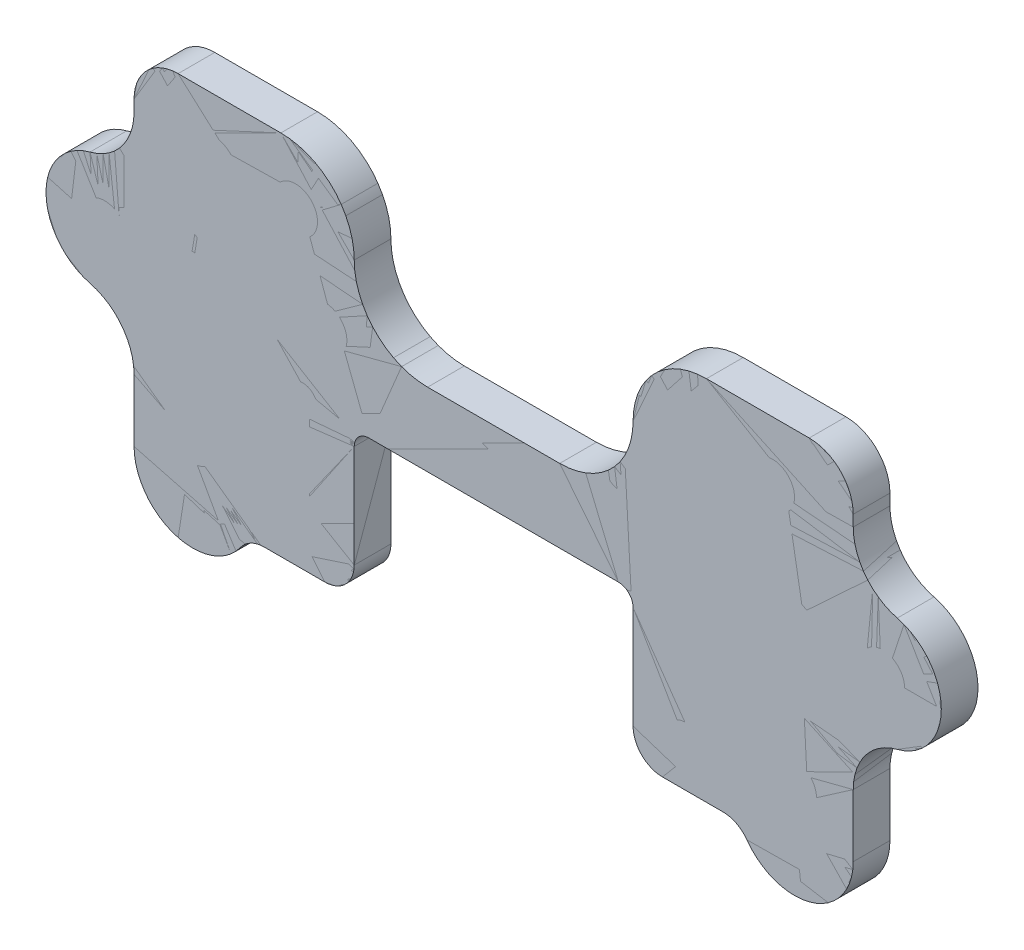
ISO-10303-21;
HEADER;
FILE_DESCRIPTION(('STEP AP214'),'2;1');
FILE_NAME('part.step','',(''),(''),'','','');
FILE_SCHEMA(('AUTOMOTIVE_DESIGN { 1 0 10303 214 1 1 1 1 }'));
ENDSEC;
DATA;
#1=APPLICATION_CONTEXT('core data for automotive mechanical design processes');
#2=APPLICATION_PROTOCOL_DEFINITION('international standard','automotive_design',2000,#1);
#3=PRODUCT_CONTEXT('',#1,'mechanical');
#4=PRODUCT('Part','Part','',(#3));
#5=PRODUCT_RELATED_PRODUCT_CATEGORY('part','',(#4));
#6=PRODUCT_DEFINITION_FORMATION('','',#4);
#7=PRODUCT_DEFINITION_CONTEXT('part definition',#1,'design');
#8=PRODUCT_DEFINITION('design','',#6,#7);
#9=PRODUCT_DEFINITION_SHAPE('','',#8);
#10=(LENGTH_UNIT() NAMED_UNIT(*) SI_UNIT(.MILLI.,.METRE.));
#11=(NAMED_UNIT(*) PLANE_ANGLE_UNIT() SI_UNIT($,.RADIAN.));
#12=(NAMED_UNIT(*) SI_UNIT($,.STERADIAN.) SOLID_ANGLE_UNIT());
#13=UNCERTAINTY_MEASURE_WITH_UNIT(LENGTH_MEASURE(1.E-05),#10,'distance_accuracy_value','');
#14=(GEOMETRIC_REPRESENTATION_CONTEXT(3) GLOBAL_UNCERTAINTY_ASSIGNED_CONTEXT((#13)) GLOBAL_UNIT_ASSIGNED_CONTEXT((#10,
#11,#12)) REPRESENTATION_CONTEXT('',''));
#15=CARTESIAN_POINT('',(0.,0.,0.));
#16=DIRECTION('',(0.,0.,1.));
#17=DIRECTION('',(1.,0.,0.));
#18=AXIS2_PLACEMENT_3D('',#15,#16,#17);
#19=CARTESIAN_POINT('',(42.5,-20.9267396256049,-2.5));
#20=DIRECTION('',(0.,0.,-1.));
#21=DIRECTION('',(-1.,0.,0.));
#22=AXIS2_PLACEMENT_3D('',#19,#20,#21);
#23=PLANE('',#22);
#24=CARTESIAN_POINT('',(-15.5000000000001,5.00000000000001,-2.50000000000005));
#25=DIRECTION('',(0.,0.,1.));
#26=DIRECTION('',(1.,0.,0.));
#27=AXIS2_PLACEMENT_3D('',#24,#25,#26);
#28=CIRCLE('',#27,1.5);
#29=CARTESIAN_POINT('',(-15.5000000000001,6.5,-2.50000000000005));
#30=VERTEX_POINT('',#29);
#31=CARTESIAN_POINT('',(-15.5000000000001,3.5,-2.50000000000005));
#32=VERTEX_POINT('',#31);
#33=EDGE_CURVE('P0_E640',#30,#32,#28,.T.);
#34=ORIENTED_EDGE('',*,*,#33,.T.);
#35=DIRECTION('',(1.,0.,0.));
#36=VECTOR('',#35,1.);
#37=CARTESIAN_POINT('',(-15.5000000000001,3.5,-2.50000000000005));
#38=LINE('',#37,#36);
#39=CARTESIAN_POINT('',(-11.5000000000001,3.5,-2.5));
#40=VERTEX_POINT('',#39);
#41=EDGE_CURVE('P0_E618',#32,#40,#38,.T.);
#42=ORIENTED_EDGE('',*,*,#41,.T.);
#43=CARTESIAN_POINT('',(-11.5000000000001,5.,-2.50000000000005));
#44=DIRECTION('',(0.,0.,1.));
#45=DIRECTION('',(-1.,0.,0.));
#46=AXIS2_PLACEMENT_3D('',#43,#44,#45);
#47=CIRCLE('',#46,1.5);
#48=CARTESIAN_POINT('',(-11.5000000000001,6.5,-2.50000000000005));
#49=VERTEX_POINT('',#48);
#50=EDGE_CURVE('P0_E367',#40,#49,#47,.T.);
#51=ORIENTED_EDGE('',*,*,#50,.T.);
#52=DIRECTION('',(-1.,0.,0.));
#53=VECTOR('',#52,1.);
#54=CARTESIAN_POINT('',(-15.5000000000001,6.5,-2.50000000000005));
#55=LINE('',#54,#53);
#56=EDGE_CURVE('P0_E636',#49,#30,#55,.T.);
#57=ORIENTED_EDGE('',*,*,#56,.T.);
#58=EDGE_LOOP('',(#34,#42,#51,#57));
#59=FACE_BOUND('',#58,.T.);
#60=CARTESIAN_POINT('',(11.4999999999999,5.00000000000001,-2.50000000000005));
#61=DIRECTION('',(0.,0.,1.));
#62=DIRECTION('',(1.,0.,0.));
#63=AXIS2_PLACEMENT_3D('',#60,#61,#62);
#64=CIRCLE('',#63,1.5);
#65=CARTESIAN_POINT('',(11.4999999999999,6.5,-2.50000000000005));
#66=VERTEX_POINT('',#65);
#67=CARTESIAN_POINT('',(11.4999999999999,3.5,-2.50000000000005));
#68=VERTEX_POINT('',#67);
#69=EDGE_CURVE('P0_E654',#66,#68,#64,.T.);
#70=ORIENTED_EDGE('',*,*,#69,.T.);
#71=DIRECTION('',(1.,0.,0.));
#72=VECTOR('',#71,1.);
#73=CARTESIAN_POINT('',(11.4999999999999,3.5,-2.50000000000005));
#74=LINE('',#73,#72);
#75=CARTESIAN_POINT('',(15.4999999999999,3.5,-2.5));
#76=VERTEX_POINT('',#75);
#77=EDGE_CURVE('P0_E657',#68,#76,#74,.T.);
#78=ORIENTED_EDGE('',*,*,#77,.T.);
#79=CARTESIAN_POINT('',(15.4999999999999,5.,-2.50000000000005));
#80=DIRECTION('',(0.,0.,1.));
#81=DIRECTION('',(-1.,0.,0.));
#82=AXIS2_PLACEMENT_3D('',#79,#80,#81);
#83=CIRCLE('',#82,1.5);
#84=CARTESIAN_POINT('',(15.4999999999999,6.5,-2.50000000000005));
#85=VERTEX_POINT('',#84);
#86=EDGE_CURVE('P0_E660',#76,#85,#83,.T.);
#87=ORIENTED_EDGE('',*,*,#86,.T.);
#88=DIRECTION('',(-1.,0.,0.));
#89=VECTOR('',#88,1.);
#90=CARTESIAN_POINT('',(11.4999999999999,6.5,-2.50000000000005));
#91=LINE('',#90,#89);
#92=EDGE_CURVE('P0_E663',#85,#66,#91,.T.);
#93=ORIENTED_EDGE('',*,*,#92,.T.);
#94=EDGE_LOOP('',(#70,#78,#87,#93));
#95=FACE_BOUND('',#94,.T.);
#96=CARTESIAN_POINT('',(-18.9999999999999,11.,-2.50000000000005));
#97=DIRECTION('',(0.,0.,1.));
#98=DIRECTION('',(1.,0.,0.));
#99=AXIS2_PLACEMENT_3D('',#96,#97,#98);
#100=CIRCLE('',#99,1.5);
#101=CARTESIAN_POINT('',(-17.4999999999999,11.,-2.50000000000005));
#102=VERTEX_POINT('',#101);
#103=EDGE_CURVE('P0_E669',#102,#102,#100,.T.);
#104=ORIENTED_EDGE('',*,*,#103,.T.);
#105=EDGE_LOOP('',(#104));
#106=FACE_BOUND('',#105,.T.);
#107=CARTESIAN_POINT('',(-13.4999999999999,11.0000000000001,-2.50000000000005));
#108=DIRECTION('',(0.,0.,1.));
#109=DIRECTION('',(1.,0.,0.));
#110=AXIS2_PLACEMENT_3D('',#107,#108,#109);
#111=CIRCLE('',#110,1.5);
#112=CARTESIAN_POINT('',(-11.9999999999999,11.0000000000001,-2.50000000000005));
#113=VERTEX_POINT('',#112);
#114=EDGE_CURVE('P0_E684',#113,#113,#111,.T.);
#115=ORIENTED_EDGE('',*,*,#114,.T.);
#116=EDGE_LOOP('',(#115));
#117=FACE_BOUND('',#116,.T.);
#118=CARTESIAN_POINT('',(18.9999999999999,11.0000000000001,-2.50000000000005));
#119=DIRECTION('',(0.,0.,1.));
#120=DIRECTION('',(1.,0.,0.));
#121=AXIS2_PLACEMENT_3D('',#118,#119,#120);
#122=CIRCLE('',#121,1.5);
#123=CARTESIAN_POINT('',(20.4999999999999,11.0000000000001,-2.50000000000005));
#124=VERTEX_POINT('',#123);
#125=EDGE_CURVE('P0_E687',#124,#124,#122,.T.);
#126=ORIENTED_EDGE('',*,*,#125,.T.);
#127=EDGE_LOOP('',(#126));
#128=FACE_BOUND('',#127,.T.);
#129=CARTESIAN_POINT('',(13.4999999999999,11.0000000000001,-2.50000000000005));
#130=DIRECTION('',(0.,0.,1.));
#131=DIRECTION('',(1.,0.,0.));
#132=AXIS2_PLACEMENT_3D('',#129,#130,#131);
#133=CIRCLE('',#132,1.5);
#134=CARTESIAN_POINT('',(14.9999999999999,11.0000000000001,-2.50000000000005));
#135=VERTEX_POINT('',#134);
#136=EDGE_CURVE('P0_E696',#135,#135,#133,.T.);
#137=ORIENTED_EDGE('',*,*,#136,.T.);
#138=EDGE_LOOP('',(#137));
#139=FACE_BOUND('',#138,.T.);
#140=CARTESIAN_POINT('',(-20.4813176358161,-0.941201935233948,-2.5));
#141=DIRECTION('',(0.,0.,-1.));
#142=DIRECTION('',(-1.,0.,0.));
#143=AXIS2_PLACEMENT_3D('',#140,#141,#142);
#144=CIRCLE('',#143,1.);
#145=CARTESIAN_POINT('',(-21.4813176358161,-0.941201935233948,-2.5));
#146=VERTEX_POINT('',#145);
#147=EDGE_CURVE('P0_E699',#146,#146,#144,.T.);
#148=ORIENTED_EDGE('',*,*,#147,.F.);
#149=EDGE_LOOP('',(#148));
#150=FACE_BOUND('',#149,.T.);
#151=CARTESIAN_POINT('',(-26.5,3.5,-2.50000000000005));
#152=DIRECTION('',(0.,0.,1.));
#153=DIRECTION('',(1.,0.,0.));
#154=AXIS2_PLACEMENT_3D('',#151,#152,#153);
#155=CIRCLE('',#154,1.5);
#156=CARTESIAN_POINT('',(-25.,3.5,-2.50000000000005));
#157=VERTEX_POINT('',#156);
#158=EDGE_CURVE('P0_E708',#157,#157,#155,.T.);
#159=ORIENTED_EDGE('',*,*,#158,.T.);
#160=EDGE_LOOP('',(#159));
#161=FACE_BOUND('',#160,.T.);
#162=CARTESIAN_POINT('',(26.5,3.5,-2.50000000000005));
#163=DIRECTION('',(0.,0.,1.));
#164=DIRECTION('',(1.,0.,0.));
#165=AXIS2_PLACEMENT_3D('',#162,#163,#164);
#166=CIRCLE('',#165,1.5);
#167=CARTESIAN_POINT('',(28.,3.5,-2.50000000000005));
#168=VERTEX_POINT('',#167);
#169=EDGE_CURVE('P0_E714',#168,#168,#166,.T.);
#170=ORIENTED_EDGE('',*,*,#169,.T.);
#171=EDGE_LOOP('',(#170));
#172=FACE_BOUND('',#171,.T.);
#173=CARTESIAN_POINT('',(-20.5000000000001,3.50000000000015,-2.50000000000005));
#174=DIRECTION('',(0.,0.,1.));
#175=DIRECTION('',(1.,0.,0.));
#176=AXIS2_PLACEMENT_3D('',#173,#174,#175);
#177=CIRCLE('',#176,1.5);
#178=CARTESIAN_POINT('',(-19.0000000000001,3.50000000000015,-2.50000000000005));
#179=VERTEX_POINT('',#178);
#180=EDGE_CURVE('P0_E720',#179,#179,#177,.T.);
#181=ORIENTED_EDGE('',*,*,#180,.T.);
#182=EDGE_LOOP('',(#181));
#183=FACE_BOUND('',#182,.T.);
#184=CARTESIAN_POINT('',(-20.5000000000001,-5.99999999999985,-2.50000000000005));
#185=DIRECTION('',(0.,0.,1.));
#186=DIRECTION('',(1.,0.,0.));
#187=AXIS2_PLACEMENT_3D('',#184,#185,#186);
#188=CIRCLE('',#187,1.5);
#189=CARTESIAN_POINT('',(-19.0000000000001,-5.99999999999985,-2.50000000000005));
#190=VERTEX_POINT('',#189);
#191=EDGE_CURVE('P0_E726',#190,#190,#188,.T.);
#192=ORIENTED_EDGE('',*,*,#191,.T.);
#193=EDGE_LOOP('',(#192));
#194=FACE_BOUND('',#193,.T.);
#195=CARTESIAN_POINT('',(20.4999999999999,3.50000000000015,-2.50000000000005));
#196=DIRECTION('',(0.,0.,1.));
#197=DIRECTION('',(1.,0.,0.));
#198=AXIS2_PLACEMENT_3D('',#195,#196,#197);
#199=CIRCLE('',#198,1.5);
#200=CARTESIAN_POINT('',(21.9999999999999,3.50000000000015,-2.50000000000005));
#201=VERTEX_POINT('',#200);
#202=EDGE_CURVE('P0_E732',#201,#201,#199,.T.);
#203=ORIENTED_EDGE('',*,*,#202,.T.);
#204=EDGE_LOOP('',(#203));
#205=FACE_BOUND('',#204,.T.);
#206=CARTESIAN_POINT('',(-13.,1.4658413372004E-13,-2.5));
#207=DIRECTION('',(0.,0.,-1.));
#208=DIRECTION('',(-1.,0.,0.));
#209=AXIS2_PLACEMENT_3D('',#206,#207,#208);
#210=CIRCLE('',#209,1.);
#211=CARTESIAN_POINT('',(-14.,1.4658413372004E-13,-2.5));
#212=VERTEX_POINT('',#211);
#213=EDGE_CURVE('P0_E738',#212,#212,#210,.T.);
#214=ORIENTED_EDGE('',*,*,#213,.F.);
#215=EDGE_LOOP('',(#214));
#216=FACE_BOUND('',#215,.T.);
#217=CARTESIAN_POINT('',(-13.0000000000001,-6.99999999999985,-2.5));
#218=DIRECTION('',(0.,0.,-1.));
#219=DIRECTION('',(-1.,0.,0.));
#220=AXIS2_PLACEMENT_3D('',#217,#218,#219);
#221=CIRCLE('',#220,1.);
#222=CARTESIAN_POINT('',(-14.0000000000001,-6.99999999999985,-2.5));
#223=VERTEX_POINT('',#222);
#224=EDGE_CURVE('P0_E744',#223,#223,#221,.T.);
#225=ORIENTED_EDGE('',*,*,#224,.F.);
#226=EDGE_LOOP('',(#225));
#227=FACE_BOUND('',#226,.T.);
#228=CARTESIAN_POINT('',(13.,1.4658413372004E-13,-2.5));
#229=DIRECTION('',(0.,0.,-1.));
#230=DIRECTION('',(-1.,0.,0.));
#231=AXIS2_PLACEMENT_3D('',#228,#229,#230);
#232=CIRCLE('',#231,1.);
#233=CARTESIAN_POINT('',(12.,1.4658413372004E-13,-2.5));
#234=VERTEX_POINT('',#233);
#235=EDGE_CURVE('P0_E750',#234,#234,#232,.T.);
#236=ORIENTED_EDGE('',*,*,#235,.F.);
#237=EDGE_LOOP('',(#236));
#238=FACE_BOUND('',#237,.T.);
#239=CARTESIAN_POINT('',(20.5186823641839,-0.941201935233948,-2.5));
#240=DIRECTION('',(0.,0.,-1.));
#241=DIRECTION('',(-1.,0.,0.));
#242=AXIS2_PLACEMENT_3D('',#239,#240,#241);
#243=CIRCLE('',#242,1.);
#244=CARTESIAN_POINT('',(19.5186823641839,-0.941201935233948,-2.5));
#245=VERTEX_POINT('',#244);
#246=EDGE_CURVE('P0_E756',#245,#245,#243,.T.);
#247=ORIENTED_EDGE('',*,*,#246,.F.);
#248=EDGE_LOOP('',(#247));
#249=FACE_BOUND('',#248,.T.);
#250=CARTESIAN_POINT('',(12.9999999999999,-6.99999999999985,-2.5));
#251=DIRECTION('',(0.,0.,-1.));
#252=DIRECTION('',(-1.,0.,0.));
#253=AXIS2_PLACEMENT_3D('',#250,#251,#252);
#254=CIRCLE('',#253,1.);
#255=CARTESIAN_POINT('',(11.9999999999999,-6.99999999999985,-2.5));
#256=VERTEX_POINT('',#255);
#257=EDGE_CURVE('P0_E762',#256,#256,#254,.T.);
#258=ORIENTED_EDGE('',*,*,#257,.F.);
#259=EDGE_LOOP('',(#258));
#260=FACE_BOUND('',#259,.T.);
#261=CARTESIAN_POINT('',(20.4999999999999,-5.99999999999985,-2.50000000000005));
#262=DIRECTION('',(0.,0.,1.));
#263=DIRECTION('',(1.,0.,0.));
#264=AXIS2_PLACEMENT_3D('',#261,#262,#263);
#265=CIRCLE('',#264,1.5);
#266=CARTESIAN_POINT('',(21.9999999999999,-5.99999999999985,-2.50000000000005));
#267=VERTEX_POINT('',#266);
#268=EDGE_CURVE('P0_E768',#267,#267,#265,.T.);
#269=ORIENTED_EDGE('',*,*,#268,.T.);
#270=EDGE_LOOP('',(#269));
#271=FACE_BOUND('',#270,.T.);
#272=DIRECTION('',(0.,-1.,0.));
#273=VECTOR('',#272,1.);
#274=CARTESIAN_POINT('',(9.5,-4.5,-2.50000000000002));
#275=LINE('',#274,#273);
#276=CARTESIAN_POINT('',(9.5,-1.,-2.50000000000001));
#277=VERTEX_POINT('',#276);
#278=CARTESIAN_POINT('',(9.50000000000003,-7.99999999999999,-2.5));
#279=VERTEX_POINT('',#278);
#280=EDGE_CURVE('P0_E937',#277,#279,#275,.T.);
#281=ORIENTED_EDGE('',*,*,#280,.F.);
#282=CARTESIAN_POINT('',(8.5,-1.,-2.5));
#283=DIRECTION('',(0.,0.,-1.));
#284=DIRECTION('',(-1.,0.,0.));
#285=AXIS2_PLACEMENT_3D('',#282,#283,#284);
#286=CIRCLE('',#285,0.999999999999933);
#287=CARTESIAN_POINT('',(8.5,0.,-2.49999999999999));
#288=VERTEX_POINT('',#287);
#289=EDGE_CURVE('P0_E354',#288,#277,#286,.T.);
#290=ORIENTED_EDGE('',*,*,#289,.F.);
#291=DIRECTION('',(1.,0.,0.));
#292=VECTOR('',#291,1.);
#293=CARTESIAN_POINT('',(0.,0.,-2.49999999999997));
#294=LINE('',#293,#292);
#295=CARTESIAN_POINT('',(-8.5,0.,-2.49999999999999));
#296=VERTEX_POINT('',#295);
#297=EDGE_CURVE('P0_E824',#296,#288,#294,.T.);
#298=ORIENTED_EDGE('',*,*,#297,.F.);
#299=CARTESIAN_POINT('',(-8.5,-1.,-2.5));
#300=DIRECTION('',(0.,0.,1.));
#301=DIRECTION('',(0.,-1.,0.));
#302=AXIS2_PLACEMENT_3D('',#299,#300,#301);
#303=CIRCLE('',#302,0.999999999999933);
#304=CARTESIAN_POINT('',(-9.49999999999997,-0.99999999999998,-2.5));
#305=VERTEX_POINT('',#304);
#306=EDGE_CURVE('P0_E825',#305,#296,#303,.F.);
#307=ORIENTED_EDGE('',*,*,#306,.F.);
#308=DIRECTION('',(0.,1.,0.));
#309=VECTOR('',#308,1.);
#310=CARTESIAN_POINT('',(-9.5,-4.5,-2.50000000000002));
#311=LINE('',#310,#309);
#312=CARTESIAN_POINT('',(-9.5,-8.,-2.50000000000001));
#313=VERTEX_POINT('',#312);
#314=EDGE_CURVE('P0_E832',#313,#305,#311,.T.);
#315=ORIENTED_EDGE('',*,*,#314,.F.);
#316=CARTESIAN_POINT('',(-11.5,-8.,-2.5));
#317=DIRECTION('',(0.,0.,-1.));
#318=DIRECTION('',(-1.,0.,0.));
#319=AXIS2_PLACEMENT_3D('',#316,#317,#318);
#320=CIRCLE('',#319,1.99999999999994);
#321=CARTESIAN_POINT('',(-11.5,-9.99999999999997,-2.5));
#322=VERTEX_POINT('',#321);
#323=EDGE_CURVE('P0_E838',#313,#322,#320,.T.);
#324=ORIENTED_EDGE('',*,*,#323,.T.);
#325=DIRECTION('',(1.,0.,0.));
#326=VECTOR('',#325,1.);
#327=CARTESIAN_POINT('',(-13.563301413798,-10.,-2.49999999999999));
#328=LINE('',#327,#326);
#329=CARTESIAN_POINT('',(-15.626602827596,-10.,-2.49999999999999));
#330=VERTEX_POINT('',#329);
#331=EDGE_CURVE('P0_E842',#330,#322,#328,.T.);
#332=ORIENTED_EDGE('',*,*,#331,.F.);
#333=CARTESIAN_POINT('',(-15.626602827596,-12.,-2.5));
#334=DIRECTION('',(0.,0.,1.));
#335=DIRECTION('',(1.,0.,0.));
#336=AXIS2_PLACEMENT_3D('',#333,#334,#335);
#337=CIRCLE('',#336,2.00000000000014);
#338=CARTESIAN_POINT('',(-17.2510685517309,-10.8333333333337,-2.5));
#339=VERTEX_POINT('',#338);
#340=EDGE_CURVE('P0_E843',#339,#330,#337,.F.);
#341=ORIENTED_EDGE('',*,*,#340,.F.);
#342=CARTESIAN_POINT('',(-20.5,-8.5,-2.5));
#343=DIRECTION('',(0.,0.,-1.));
#344=DIRECTION('',(-1.,0.,0.));
#345=AXIS2_PLACEMENT_3D('',#342,#343,#344);
#346=CIRCLE('',#345,4.00000000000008);
#347=CARTESIAN_POINT('',(-24.5,-8.49999999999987,-2.50000000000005));
#348=VERTEX_POINT('',#347);
#349=EDGE_CURVE('P0_E849',#339,#348,#346,.T.);
#350=ORIENTED_EDGE('',*,*,#349,.T.);
#351=DIRECTION('',(0.,-1.,0.));
#352=VECTOR('',#351,1.);
#353=CARTESIAN_POINT('',(-24.5,1.75,-2.5000000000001));
#354=LINE('',#353,#352);
#355=CARTESIAN_POINT('',(-24.5,-4.24596669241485,-2.50000000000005));
#356=VERTEX_POINT('',#355);
#357=EDGE_CURVE('P0_E853',#356,#348,#354,.T.);
#358=ORIENTED_EDGE('',*,*,#357,.F.);
#359=CARTESIAN_POINT('',(-28.5,-4.2459666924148,-2.5));
#360=DIRECTION('',(0.,0.,1.));
#361=DIRECTION('',(0.,-1.,0.));
#362=AXIS2_PLACEMENT_3D('',#359,#360,#361);
#363=CIRCLE('',#362,3.99999999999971);
#364=CARTESIAN_POINT('',(-27.5000000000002,-0.372983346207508,-2.5));
#365=VERTEX_POINT('',#364);
#366=EDGE_CURVE('P0_E854',#365,#356,#363,.F.);
#367=ORIENTED_EDGE('',*,*,#366,.F.);
#368=CARTESIAN_POINT('',(-26.5,3.5,-2.5));
#369=DIRECTION('',(0.,0.,-1.));
#370=DIRECTION('',(-1.,0.,0.));
#371=AXIS2_PLACEMENT_3D('',#368,#369,#370);
#372=CIRCLE('',#371,4.);
#373=CARTESIAN_POINT('',(-27.5,7.37298334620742,-2.5));
#374=VERTEX_POINT('',#373);
#375=EDGE_CURVE('P0_E860',#365,#374,#372,.T.);
#376=ORIENTED_EDGE('',*,*,#375,.T.);
#377=CARTESIAN_POINT('',(-28.5,11.245966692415,-2.5));
#378=DIRECTION('',(0.,0.,1.));
#379=DIRECTION('',(0.,-1.,0.));
#380=AXIS2_PLACEMENT_3D('',#377,#378,#379);
#381=CIRCLE('',#380,3.99999999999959);
#382=CARTESIAN_POINT('',(-24.5000000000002,11.2459666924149,-2.5));
#383=VERTEX_POINT('',#382);
#384=EDGE_CURVE('P0_E864',#383,#374,#381,.F.);
#385=ORIENTED_EDGE('',*,*,#384,.F.);
#386=DIRECTION('',(0.,-1.,0.));
#387=VECTOR('',#386,1.);
#388=CARTESIAN_POINT('',(-24.5,1.75,-2.5000000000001));
#389=LINE('',#388,#387);
#390=CARTESIAN_POINT('',(-24.5,12.,-2.50000000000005));
#391=VERTEX_POINT('',#390);
#392=EDGE_CURVE('P0_E865',#391,#383,#389,.T.);
#393=ORIENTED_EDGE('',*,*,#392,.F.);
#394=CARTESIAN_POINT('',(-21.5,12.,-2.5));
#395=DIRECTION('',(0.,0.,-1.));
#396=DIRECTION('',(-1.,0.,0.));
#397=AXIS2_PLACEMENT_3D('',#394,#395,#396);
#398=CIRCLE('',#397,3.00000000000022);
#399=CARTESIAN_POINT('',(-21.5000000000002,15.0000000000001,-2.5));
#400=VERTEX_POINT('',#399);
#401=EDGE_CURVE('P0_E871',#391,#400,#398,.T.);
#402=ORIENTED_EDGE('',*,*,#401,.T.);
#403=DIRECTION('',(-1.,0.,0.));
#404=VECTOR('',#403,1.);
#405=CARTESIAN_POINT('',(-18.,15.,-2.50000000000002));
#406=LINE('',#405,#404);
#407=CARTESIAN_POINT('',(-14.5,15.,-2.50000000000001));
#408=VERTEX_POINT('',#407);
#409=EDGE_CURVE('P0_E875',#408,#400,#406,.T.);
#410=ORIENTED_EDGE('',*,*,#409,.F.);
#411=CARTESIAN_POINT('',(-14.5,10.,-2.5));
#412=DIRECTION('',(0.,0.,-1.));
#413=DIRECTION('',(-1.,0.,0.));
#414=AXIS2_PLACEMENT_3D('',#411,#412,#413);
#415=CIRCLE('',#414,5.00000000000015);
#416=CARTESIAN_POINT('',(-9.49999999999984,10.,-2.5));
#417=VERTEX_POINT('',#416);
#418=EDGE_CURVE('P0_E878',#408,#417,#415,.T.);
#419=ORIENTED_EDGE('',*,*,#418,.T.);
#420=CARTESIAN_POINT('',(-4.5,10.,-2.5));
#421=DIRECTION('',(0.,0.,1.));
#422=DIRECTION('',(1.,0.,0.));
#423=AXIS2_PLACEMENT_3D('',#420,#421,#422);
#424=CIRCLE('',#423,5.00000000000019);
#425=CARTESIAN_POINT('',(-4.50000000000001,4.9999999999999,-2.5));
#426=VERTEX_POINT('',#425);
#427=EDGE_CURVE('P0_E882',#426,#417,#424,.F.);
#428=ORIENTED_EDGE('',*,*,#427,.F.);
#429=DIRECTION('',(-1.,0.,0.));
#430=VECTOR('',#429,1.);
#431=CARTESIAN_POINT('',(0.,5.,-2.50000000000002));
#432=LINE('',#431,#430);
#433=CARTESIAN_POINT('',(4.5,5.,-2.50000000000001));
#434=VERTEX_POINT('',#433);
#435=EDGE_CURVE('P0_E883',#434,#426,#432,.T.);
#436=ORIENTED_EDGE('',*,*,#435,.F.);
#437=CARTESIAN_POINT('',(4.5,10.,-2.5));
#438=DIRECTION('',(0.,0.,-1.));
#439=DIRECTION('',(-1.,0.,0.));
#440=AXIS2_PLACEMENT_3D('',#437,#438,#439);
#441=CIRCLE('',#440,5.00000000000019);
#442=CARTESIAN_POINT('',(9.50000000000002,10.,-2.5));
#443=VERTEX_POINT('',#442);
#444=EDGE_CURVE('P0_E887',#443,#434,#441,.T.);
#445=ORIENTED_EDGE('',*,*,#444,.F.);
#446=CARTESIAN_POINT('',(14.5,10.,-2.5));
#447=DIRECTION('',(0.,0.,1.));
#448=DIRECTION('',(0.,-1.,0.));
#449=AXIS2_PLACEMENT_3D('',#446,#447,#448);
#450=CIRCLE('',#449,5.00000000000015);
#451=CARTESIAN_POINT('',(14.5,15.0000000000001,-2.5));
#452=VERTEX_POINT('',#451);
#453=EDGE_CURVE('P0_E893',#443,#452,#450,.F.);
#454=ORIENTED_EDGE('',*,*,#453,.T.);
#455=DIRECTION('',(-1.,0.,0.));
#456=VECTOR('',#455,1.);
#457=CARTESIAN_POINT('',(18.,15.,-2.50000000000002));
#458=LINE('',#457,#456);
#459=CARTESIAN_POINT('',(21.5,15.,-2.50000000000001));
#460=VERTEX_POINT('',#459);
#461=EDGE_CURVE('P0_E897',#460,#452,#458,.T.);
#462=ORIENTED_EDGE('',*,*,#461,.F.);
#463=CARTESIAN_POINT('',(21.5,12.,-2.5));
#464=DIRECTION('',(0.,0.,1.));
#465=DIRECTION('',(0.,-1.,0.));
#466=AXIS2_PLACEMENT_3D('',#463,#464,#465);
#467=CIRCLE('',#466,3.00000000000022);
#468=CARTESIAN_POINT('',(24.5000000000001,11.9999999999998,-2.5));
#469=VERTEX_POINT('',#468);
#470=EDGE_CURVE('P0_E900',#460,#469,#467,.F.);
#471=ORIENTED_EDGE('',*,*,#470,.T.);
#472=DIRECTION('',(0.,1.,0.));
#473=VECTOR('',#472,1.);
#474=CARTESIAN_POINT('',(24.5,1.75,-2.5000000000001));
#475=LINE('',#474,#473);
#476=CARTESIAN_POINT('',(24.5,11.2459666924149,-2.50000000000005));
#477=VERTEX_POINT('',#476);
#478=EDGE_CURVE('P0_E904',#477,#469,#475,.T.);
#479=ORIENTED_EDGE('',*,*,#478,.F.);
#480=CARTESIAN_POINT('',(28.5,11.245966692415,-2.5));
#481=DIRECTION('',(0.,0.,-1.));
#482=DIRECTION('',(-1.,0.,0.));
#483=AXIS2_PLACEMENT_3D('',#480,#481,#482);
#484=CIRCLE('',#483,3.99999999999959);
#485=CARTESIAN_POINT('',(27.5000000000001,7.3729833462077,-2.5));
#486=VERTEX_POINT('',#485);
#487=EDGE_CURVE('P0_E905',#486,#477,#484,.T.);
#488=ORIENTED_EDGE('',*,*,#487,.F.);
#489=CARTESIAN_POINT('',(26.5,3.5,-2.5));
#490=DIRECTION('',(0.,0.,1.));
#491=DIRECTION('',(0.,-1.,0.));
#492=AXIS2_PLACEMENT_3D('',#489,#490,#491);
#493=CIRCLE('',#492,4.);
#494=CARTESIAN_POINT('',(27.5,-0.372983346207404,-2.5));
#495=VERTEX_POINT('',#494);
#496=EDGE_CURVE('P0_E911',#486,#495,#493,.F.);
#497=ORIENTED_EDGE('',*,*,#496,.T.);
#498=CARTESIAN_POINT('',(28.5,-4.2459666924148,-2.5));
#499=DIRECTION('',(0.,0.,-1.));
#500=DIRECTION('',(-1.,0.,0.));
#501=AXIS2_PLACEMENT_3D('',#498,#499,#500);
#502=CIRCLE('',#501,3.99999999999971);
#503=CARTESIAN_POINT('',(24.5000000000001,-4.24596669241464,-2.5));
#504=VERTEX_POINT('',#503);
#505=EDGE_CURVE('P0_E915',#504,#495,#502,.T.);
#506=ORIENTED_EDGE('',*,*,#505,.F.);
#507=DIRECTION('',(0.,1.,0.));
#508=VECTOR('',#507,1.);
#509=CARTESIAN_POINT('',(24.5,1.75,-2.5000000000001));
#510=LINE('',#509,#508);
#511=CARTESIAN_POINT('',(24.5,-8.5,-2.50000000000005));
#512=VERTEX_POINT('',#511);
#513=EDGE_CURVE('P0_E916',#512,#504,#510,.T.);
#514=ORIENTED_EDGE('',*,*,#513,.F.);
#515=CARTESIAN_POINT('',(20.5,-8.5,-2.5));
#516=DIRECTION('',(0.,0.,1.));
#517=DIRECTION('',(1.,0.,0.));
#518=AXIS2_PLACEMENT_3D('',#515,#516,#517);
#519=CIRCLE('',#518,4.00000000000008);
#520=CARTESIAN_POINT('',(17.2510685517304,-10.8333333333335,-2.5));
#521=VERTEX_POINT('',#520);
#522=EDGE_CURVE('P0_E922',#512,#521,#519,.F.);
#523=ORIENTED_EDGE('',*,*,#522,.T.);
#524=CARTESIAN_POINT('',(15.626602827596,-12.,-2.5));
#525=DIRECTION('',(0.,0.,-1.));
#526=DIRECTION('',(-1.,0.,0.));
#527=AXIS2_PLACEMENT_3D('',#524,#525,#526);
#528=CIRCLE('',#527,2.00000000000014);
#529=CARTESIAN_POINT('',(15.6266028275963,-9.99999999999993,-2.5));
#530=VERTEX_POINT('',#529);
#531=EDGE_CURVE('P0_E926',#530,#521,#528,.T.);
#532=ORIENTED_EDGE('',*,*,#531,.F.);
#533=DIRECTION('',(1.,0.,0.));
#534=VECTOR('',#533,1.);
#535=CARTESIAN_POINT('',(13.563301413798,-10.,-2.49999999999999));
#536=LINE('',#535,#534);
#537=CARTESIAN_POINT('',(11.5,-10.,-2.49999999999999));
#538=VERTEX_POINT('',#537);
#539=EDGE_CURVE('P0_E927',#538,#530,#536,.T.);
#540=ORIENTED_EDGE('',*,*,#539,.F.);
#541=CARTESIAN_POINT('',(11.5,-8.,-2.5));
#542=DIRECTION('',(0.,0.,1.));
#543=DIRECTION('',(1.,0.,0.));
#544=AXIS2_PLACEMENT_3D('',#541,#542,#543);
#545=CIRCLE('',#544,1.99999999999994);
#546=EDGE_CURVE('P0_E933',#538,#279,#545,.F.);
#547=ORIENTED_EDGE('',*,*,#546,.T.);
#548=EDGE_LOOP('',(#281,#290,#298,#307,#315,#324,#332,#341,#350,#358,#367,#376,#385,#393,#402,
#410,#419,#428,#436,#445,#454,#462,#471,#479,#488,#497,#506,#514,#523,#532,#540,#547));
#549=FACE_BOUND('',#548,.T.);
#550=ADVANCED_FACE('P0_F350',(#59,#95,#106,#117,#128,#139,#150,#161,#172,#183,#194,#205,#216,
#227,#238,#249,#260,#271,#549),#23,.T.);
#551=CARTESIAN_POINT('',(8.5,-1.,0.));
#552=DIRECTION('',(0.,0.,-1.));
#553=DIRECTION('',(-1.,0.,0.));
#554=AXIS2_PLACEMENT_3D('',#551,#552,#553);
#555=CYLINDRICAL_SURFACE('',#554,0.999999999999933);
#556=ORIENTED_EDGE('',*,*,#289,.T.);
#557=DIRECTION('',(0.,0.,-1.));
#558=VECTOR('',#557,1.);
#559=CARTESIAN_POINT('',(9.5,-1.,-3.5));
#560=LINE('',#559,#558);
#561=CARTESIAN_POINT('',(9.49999999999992,-1.,0.));
#562=VERTEX_POINT('',#561);
#563=EDGE_CURVE('P0_E934',#562,#277,#560,.T.);
#564=ORIENTED_EDGE('',*,*,#563,.F.);
#565=CARTESIAN_POINT('',(8.5,-1.,0.));
#566=DIRECTION('',(0.,0.,-1.));
#567=DIRECTION('',(-1.,0.,0.));
#568=AXIS2_PLACEMENT_3D('',#565,#566,#567);
#569=CIRCLE('',#568,0.999999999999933);
#570=CARTESIAN_POINT('',(8.5,1.47451495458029E-13,0.));
#571=VERTEX_POINT('',#570);
#572=EDGE_CURVE('P0_E820',#571,#562,#569,.T.);
#573=ORIENTED_EDGE('',*,*,#572,.F.);
#574=DIRECTION('',(0.,0.,1.));
#575=VECTOR('',#574,1.);
#576=CARTESIAN_POINT('',(8.5,0.,-8.5));
#577=LINE('',#576,#575);
#578=EDGE_CURVE('P0_E826',#288,#571,#577,.T.);
#579=ORIENTED_EDGE('',*,*,#578,.F.);
#580=EDGE_LOOP('',(#556,#564,#573,#579));
#581=FACE_BOUND('',#580,.T.);
#582=ADVANCED_FACE('P0_F1036',(#581),#555,.F.);
#583=CARTESIAN_POINT('',(9.5,-1.,0.));
#584=DIRECTION('',(-1.,0.,0.));
#585=DIRECTION('',(0.,0.,-1.));
#586=AXIS2_PLACEMENT_3D('',#583,#584,#585);
#587=PLANE('',#586);
#588=ORIENTED_EDGE('',*,*,#280,.T.);
#589=DIRECTION('',(0.,0.,1.));
#590=VECTOR('',#589,1.);
#591=CARTESIAN_POINT('',(9.50000000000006,-7.99999999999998,-1.25));
#592=LINE('',#591,#590);
#593=CARTESIAN_POINT('',(9.49999999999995,-7.99999999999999,0.));
#594=VERTEX_POINT('',#593);
#595=EDGE_CURVE('P0_E931',#279,#594,#592,.T.);
#596=ORIENTED_EDGE('',*,*,#595,.T.);
#597=DIRECTION('',(0.,-1.,0.));
#598=VECTOR('',#597,1.);
#599=CARTESIAN_POINT('',(9.49999999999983,13.7866301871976,0.));
#600=LINE('',#599,#598);
#601=EDGE_CURVE('P0_E817',#562,#594,#600,.T.);
#602=ORIENTED_EDGE('',*,*,#601,.F.);
#603=ORIENTED_EDGE('',*,*,#563,.T.);
#604=EDGE_LOOP('',(#588,#596,#602,#603));
#605=FACE_BOUND('',#604,.T.);
#606=ADVANCED_FACE('P0_F1027',(#605),#587,.T.);
#607=CARTESIAN_POINT('',(11.5,-8.,-2.5));
#608=DIRECTION('',(0.,0.,1.));
#609=DIRECTION('',(1.,0.,0.));
#610=AXIS2_PLACEMENT_3D('',#607,#608,#609);
#611=CYLINDRICAL_SURFACE('',#610,1.99999999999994);
#612=ORIENTED_EDGE('',*,*,#595,.F.);
#613=ORIENTED_EDGE('',*,*,#546,.F.);
#614=DIRECTION('',(0.,0.,-1.));
#615=VECTOR('',#614,1.);
#616=CARTESIAN_POINT('',(11.5,-10.,-2.06330141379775));
#617=LINE('',#616,#615);
#618=CARTESIAN_POINT('',(11.5,-10.,0.));
#619=VERTEX_POINT('',#618);
#620=EDGE_CURVE('P0_E928',#619,#538,#617,.T.);
#621=ORIENTED_EDGE('',*,*,#620,.F.);
#622=CARTESIAN_POINT('',(11.5,-8.,0.));
#623=DIRECTION('',(0.,0.,1.));
#624=DIRECTION('',(1.,0.,0.));
#625=AXIS2_PLACEMENT_3D('',#622,#623,#624);
#626=CIRCLE('',#625,1.99999999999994);
#627=EDGE_CURVE('P0_E816',#594,#619,#626,.T.);
#628=ORIENTED_EDGE('',*,*,#627,.F.);
#629=EDGE_LOOP('',(#612,#613,#621,#628));
#630=FACE_BOUND('',#629,.T.);
#631=ADVANCED_FACE('P0_F1030',(#630),#611,.T.);
#632=CARTESIAN_POINT('',(11.5,-10.,0.));
#633=DIRECTION('',(0.,-1.,0.));
#634=DIRECTION('',(0.,0.,-1.));
#635=AXIS2_PLACEMENT_3D('',#632,#633,#634);
#636=PLANE('',#635);
#637=ORIENTED_EDGE('',*,*,#539,.T.);
#638=DIRECTION('',(0.,0.,-1.));
#639=VECTOR('',#638,1.);
#640=CARTESIAN_POINT('',(15.6266028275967,-9.99999999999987,-1.25));
#641=LINE('',#640,#639);
#642=CARTESIAN_POINT('',(15.6266028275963,-9.99999999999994,0.));
#643=VERTEX_POINT('',#642);
#644=EDGE_CURVE('P0_E923',#643,#530,#641,.T.);
#645=ORIENTED_EDGE('',*,*,#644,.F.);
#646=DIRECTION('',(1.,0.,0.));
#647=VECTOR('',#646,1.);
#648=CARTESIAN_POINT('',(-3.12250225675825E-13,-10.,0.));
#649=LINE('',#648,#647);
#650=EDGE_CURVE('P0_E812',#619,#643,#649,.T.);
#651=ORIENTED_EDGE('',*,*,#650,.F.);
#652=ORIENTED_EDGE('',*,*,#620,.T.);
#653=EDGE_LOOP('',(#637,#645,#651,#652));
#654=FACE_BOUND('',#653,.T.);
#655=ADVANCED_FACE('P0_F1148',(#654),#636,.T.);
#656=CARTESIAN_POINT('',(15.626602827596,-12.,0.));
#657=DIRECTION('',(0.,0.,-1.));
#658=DIRECTION('',(-1.,0.,0.));
#659=AXIS2_PLACEMENT_3D('',#656,#657,#658);
#660=CYLINDRICAL_SURFACE('',#659,2.00000000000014);
#661=ORIENTED_EDGE('',*,*,#531,.T.);
#662=DIRECTION('',(0.,0.,1.));
#663=VECTOR('',#662,1.);
#664=CARTESIAN_POINT('',(17.2510685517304,-10.8333333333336,-1.25));
#665=LINE('',#664,#663);
#666=CARTESIAN_POINT('',(17.2510685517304,-10.8333333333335,0.));
#667=VERTEX_POINT('',#666);
#668=EDGE_CURVE('P0_E920',#521,#667,#665,.T.);
#669=ORIENTED_EDGE('',*,*,#668,.T.);
#670=CARTESIAN_POINT('',(15.626602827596,-12.,0.));
#671=DIRECTION('',(0.,0.,-1.));
#672=DIRECTION('',(-1.,0.,0.));
#673=AXIS2_PLACEMENT_3D('',#670,#671,#672);
#674=CIRCLE('',#673,2.00000000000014);
#675=EDGE_CURVE('P0_E815',#643,#667,#674,.T.);
#676=ORIENTED_EDGE('',*,*,#675,.F.);
#677=ORIENTED_EDGE('',*,*,#644,.T.);
#678=EDGE_LOOP('',(#661,#669,#676,#677));
#679=FACE_BOUND('',#678,.T.);
#680=ADVANCED_FACE('P0_F1144',(#679),#660,.F.);
#681=CARTESIAN_POINT('',(20.5,-8.5,-2.5));
#682=DIRECTION('',(0.,0.,1.));
#683=DIRECTION('',(1.,0.,0.));
#684=AXIS2_PLACEMENT_3D('',#681,#682,#683);
#685=CYLINDRICAL_SURFACE('',#684,4.00000000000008);
#686=ORIENTED_EDGE('',*,*,#668,.F.);
#687=ORIENTED_EDGE('',*,*,#522,.F.);
#688=DIRECTION('',(0.,0.,-1.));
#689=VECTOR('',#688,1.);
#690=CARTESIAN_POINT('',(24.5,-8.5,-10.25));
#691=LINE('',#690,#689);
#692=CARTESIAN_POINT('',(24.5000000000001,-8.5,0.));
#693=VERTEX_POINT('',#692);
#694=EDGE_CURVE('P0_E917',#693,#512,#691,.T.);
#695=ORIENTED_EDGE('',*,*,#694,.F.);
#696=CARTESIAN_POINT('',(20.5,-8.5,0.));
#697=DIRECTION('',(0.,0.,1.));
#698=DIRECTION('',(1.,0.,0.));
#699=AXIS2_PLACEMENT_3D('',#696,#697,#698);
#700=CIRCLE('',#699,4.00000000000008);
#701=EDGE_CURVE('P0_E811',#667,#693,#700,.T.);
#702=ORIENTED_EDGE('',*,*,#701,.F.);
#703=EDGE_LOOP('',(#686,#687,#695,#702));
#704=FACE_BOUND('',#703,.T.);
#705=ADVANCED_FACE('P0_F1146',(#704),#685,.T.);
#706=CARTESIAN_POINT('',(24.5,-8.5,0.));
#707=DIRECTION('',(1.,0.,0.));
#708=DIRECTION('',(0.,0.,-1.));
#709=AXIS2_PLACEMENT_3D('',#706,#707,#708);
#710=PLANE('',#709);
#711=ORIENTED_EDGE('',*,*,#513,.T.);
#712=DIRECTION('',(0.,0.,-1.));
#713=VECTOR('',#712,1.);
#714=CARTESIAN_POINT('',(24.5000000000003,-4.24596669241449,-1.25));
#715=LINE('',#714,#713);
#716=CARTESIAN_POINT('',(24.5000000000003,-4.24596669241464,0.));
#717=VERTEX_POINT('',#716);
#718=EDGE_CURVE('P0_E912',#717,#504,#715,.T.);
#719=ORIENTED_EDGE('',*,*,#718,.F.);
#720=DIRECTION('',(0.,1.,0.));
#721=VECTOR('',#720,1.);
#722=CARTESIAN_POINT('',(24.5000000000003,13.7866301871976,0.));
#723=LINE('',#722,#721);
#724=EDGE_CURVE('P0_E807',#693,#717,#723,.T.);
#725=ORIENTED_EDGE('',*,*,#724,.F.);
#726=ORIENTED_EDGE('',*,*,#694,.T.);
#727=EDGE_LOOP('',(#711,#719,#725,#726));
#728=FACE_BOUND('',#727,.T.);
#729=ADVANCED_FACE('P0_F1140',(#728),#710,.T.);
#730=CARTESIAN_POINT('',(28.5,-4.2459666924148,0.));
#731=DIRECTION('',(0.,0.,-1.));
#732=DIRECTION('',(-1.,0.,0.));
#733=AXIS2_PLACEMENT_3D('',#730,#731,#732);
#734=CYLINDRICAL_SURFACE('',#733,3.99999999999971);
#735=ORIENTED_EDGE('',*,*,#505,.T.);
#736=DIRECTION('',(0.,0.,1.));
#737=VECTOR('',#736,1.);
#738=CARTESIAN_POINT('',(27.5000000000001,-0.372983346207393,-1.25));
#739=LINE('',#738,#737);
#740=CARTESIAN_POINT('',(27.5,-0.372983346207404,0.));
#741=VERTEX_POINT('',#740);
#742=EDGE_CURVE('P0_E909',#495,#741,#739,.T.);
#743=ORIENTED_EDGE('',*,*,#742,.T.);
#744=CARTESIAN_POINT('',(28.5,-4.2459666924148,0.));
#745=DIRECTION('',(0.,0.,-1.));
#746=DIRECTION('',(-1.,0.,0.));
#747=AXIS2_PLACEMENT_3D('',#744,#745,#746);
#748=CIRCLE('',#747,3.99999999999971);
#749=EDGE_CURVE('P0_E810',#717,#741,#748,.T.);
#750=ORIENTED_EDGE('',*,*,#749,.F.);
#751=ORIENTED_EDGE('',*,*,#718,.T.);
#752=EDGE_LOOP('',(#735,#743,#750,#751));
#753=FACE_BOUND('',#752,.T.);
#754=ADVANCED_FACE('P0_F1134',(#753),#734,.F.);
#755=CARTESIAN_POINT('',(26.5,3.5,-2.5));
#756=DIRECTION('',(0.,0.,1.));
#757=DIRECTION('',(0.,-1.,0.));
#758=AXIS2_PLACEMENT_3D('',#755,#756,#757);
#759=CYLINDRICAL_SURFACE('',#758,4.);
#760=ORIENTED_EDGE('',*,*,#742,.F.);
#761=ORIENTED_EDGE('',*,*,#496,.F.);
#762=DIRECTION('',(0.,0.,-1.));
#763=VECTOR('',#762,1.);
#764=CARTESIAN_POINT('',(27.5000000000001,7.37298334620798,-1.25));
#765=LINE('',#764,#763);
#766=CARTESIAN_POINT('',(27.5000000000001,7.37298334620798,0.));
#767=VERTEX_POINT('',#766);
#768=EDGE_CURVE('P0_E906',#767,#486,#765,.T.);
#769=ORIENTED_EDGE('',*,*,#768,.F.);
#770=CARTESIAN_POINT('',(26.5,3.5,0.));
#771=DIRECTION('',(0.,0.,1.));
#772=DIRECTION('',(0.,-1.,0.));
#773=AXIS2_PLACEMENT_3D('',#770,#771,#772);
#774=CIRCLE('',#773,4.);
#775=EDGE_CURVE('P0_E986',#741,#767,#774,.T.);
#776=ORIENTED_EDGE('',*,*,#775,.F.);
#777=EDGE_LOOP('',(#760,#761,#769,#776));
#778=FACE_BOUND('',#777,.T.);
#779=ADVANCED_FACE('P0_F1136',(#778),#759,.T.);
#780=CARTESIAN_POINT('',(28.5,11.245966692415,0.));
#781=DIRECTION('',(0.,0.,-1.));
#782=DIRECTION('',(-1.,0.,0.));
#783=AXIS2_PLACEMENT_3D('',#780,#781,#782);
#784=CYLINDRICAL_SURFACE('',#783,3.99999999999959);
#785=ORIENTED_EDGE('',*,*,#487,.T.);
#786=DIRECTION('',(0.,0.,-1.));
#787=VECTOR('',#786,1.);
#788=CARTESIAN_POINT('',(24.5,11.2459666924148,-10.25));
#789=LINE('',#788,#787);
#790=CARTESIAN_POINT('',(24.5000000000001,11.2459666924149,0.));
#791=VERTEX_POINT('',#790);
#792=EDGE_CURVE('P0_E901',#791,#477,#789,.T.);
#793=ORIENTED_EDGE('',*,*,#792,.F.);
#794=CARTESIAN_POINT('',(28.5,11.245966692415,0.));
#795=DIRECTION('',(0.,0.,-1.));
#796=DIRECTION('',(-1.,0.,0.));
#797=AXIS2_PLACEMENT_3D('',#794,#795,#796);
#798=CIRCLE('',#797,3.99999999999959);
#799=EDGE_CURVE('P0_E806',#767,#791,#798,.T.);
#800=ORIENTED_EDGE('',*,*,#799,.F.);
#801=ORIENTED_EDGE('',*,*,#768,.T.);
#802=EDGE_LOOP('',(#785,#793,#800,#801));
#803=FACE_BOUND('',#802,.T.);
#804=ADVANCED_FACE('P0_F1128',(#803),#784,.F.);
#805=CARTESIAN_POINT('',(24.5,-8.5,0.));
#806=DIRECTION('',(1.,0.,0.));
#807=DIRECTION('',(0.,0.,-1.));
#808=AXIS2_PLACEMENT_3D('',#805,#806,#807);
#809=PLANE('',#808);
#810=ORIENTED_EDGE('',*,*,#478,.T.);
#811=DIRECTION('',(0.,0.,1.));
#812=VECTOR('',#811,1.);
#813=CARTESIAN_POINT('',(24.5000000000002,11.9999999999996,-1.25));
#814=LINE('',#813,#812);
#815=CARTESIAN_POINT('',(24.5000000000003,11.9999999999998,0.));
#816=VERTEX_POINT('',#815);
#817=EDGE_CURVE('P0_E898',#469,#816,#814,.T.);
#818=ORIENTED_EDGE('',*,*,#817,.T.);
#819=DIRECTION('',(0.,1.,0.));
#820=VECTOR('',#819,1.);
#821=CARTESIAN_POINT('',(24.5000000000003,13.7866301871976,0.));
#822=LINE('',#821,#820);
#823=EDGE_CURVE('P0_E803',#791,#816,#822,.T.);
#824=ORIENTED_EDGE('',*,*,#823,.F.);
#825=ORIENTED_EDGE('',*,*,#792,.T.);
#826=EDGE_LOOP('',(#810,#818,#824,#825));
#827=FACE_BOUND('',#826,.T.);
#828=ADVANCED_FACE('P0_F1121',(#827),#809,.T.);
#829=CARTESIAN_POINT('',(21.5,12.,-2.5));
#830=DIRECTION('',(0.,0.,1.));
#831=DIRECTION('',(0.,-1.,0.));
#832=AXIS2_PLACEMENT_3D('',#829,#830,#831);
#833=CYLINDRICAL_SURFACE('',#832,3.00000000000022);
#834=ORIENTED_EDGE('',*,*,#817,.F.);
#835=ORIENTED_EDGE('',*,*,#470,.F.);
#836=DIRECTION('',(0.,0.,-1.));
#837=VECTOR('',#836,1.);
#838=CARTESIAN_POINT('',(21.5,15.,-3.5));
#839=LINE('',#838,#837);
#840=CARTESIAN_POINT('',(21.5,15.0000000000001,0.));
#841=VERTEX_POINT('',#840);
#842=EDGE_CURVE('P0_E894',#841,#460,#839,.T.);
#843=ORIENTED_EDGE('',*,*,#842,.F.);
#844=CARTESIAN_POINT('',(21.5,12.,0.));
#845=DIRECTION('',(0.,0.,1.));
#846=DIRECTION('',(0.,-1.,0.));
#847=AXIS2_PLACEMENT_3D('',#844,#845,#846);
#848=CIRCLE('',#847,3.00000000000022);
#849=EDGE_CURVE('P0_E802',#816,#841,#848,.T.);
#850=ORIENTED_EDGE('',*,*,#849,.F.);
#851=EDGE_LOOP('',(#834,#835,#843,#850));
#852=FACE_BOUND('',#851,.T.);
#853=ADVANCED_FACE('P0_F1124',(#852),#833,.T.);
#854=CARTESIAN_POINT('',(21.5,15.,0.));
#855=DIRECTION('',(0.,1.,0.));
#856=DIRECTION('',(0.,0.,-1.));
#857=AXIS2_PLACEMENT_3D('',#854,#855,#856);
#858=PLANE('',#857);
#859=ORIENTED_EDGE('',*,*,#461,.T.);
#860=DIRECTION('',(0.,0.,1.));
#861=VECTOR('',#860,1.);
#862=CARTESIAN_POINT('',(14.5,15.0000000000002,-1.25));
#863=LINE('',#862,#861);
#864=CARTESIAN_POINT('',(14.5,15.0000000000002,0.));
#865=VERTEX_POINT('',#864);
#866=EDGE_CURVE('P0_E891',#452,#865,#863,.T.);
#867=ORIENTED_EDGE('',*,*,#866,.T.);
#868=DIRECTION('',(-1.,0.,0.));
#869=VECTOR('',#868,1.);
#870=CARTESIAN_POINT('',(-3.12250225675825E-13,15.0000000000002,0.));
#871=LINE('',#870,#869);
#872=EDGE_CURVE('P0_E798',#841,#865,#871,.T.);
#873=ORIENTED_EDGE('',*,*,#872,.F.);
#874=ORIENTED_EDGE('',*,*,#842,.T.);
#875=EDGE_LOOP('',(#859,#867,#873,#874));
#876=FACE_BOUND('',#875,.T.);
#877=ADVANCED_FACE('P0_F1115',(#876),#858,.T.);
#878=CARTESIAN_POINT('',(14.5,10.,-2.5));
#879=DIRECTION('',(0.,0.,1.));
#880=DIRECTION('',(0.,-1.,0.));
#881=AXIS2_PLACEMENT_3D('',#878,#879,#880);
#882=CYLINDRICAL_SURFACE('',#881,5.00000000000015);
#883=ORIENTED_EDGE('',*,*,#866,.F.);
#884=ORIENTED_EDGE('',*,*,#453,.F.);
#885=DIRECTION('',(0.,0.,-1.));
#886=VECTOR('',#885,1.);
#887=CARTESIAN_POINT('',(9.50000000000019,10.,-1.25));
#888=LINE('',#887,#886);
#889=CARTESIAN_POINT('',(9.50000000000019,10.,0.));
#890=VERTEX_POINT('',#889);
#891=EDGE_CURVE('P0_E888',#890,#443,#888,.T.);
#892=ORIENTED_EDGE('',*,*,#891,.F.);
#893=CARTESIAN_POINT('',(14.5,10.,0.));
#894=DIRECTION('',(0.,0.,1.));
#895=DIRECTION('',(0.,-1.,0.));
#896=AXIS2_PLACEMENT_3D('',#893,#894,#895);
#897=CIRCLE('',#896,5.00000000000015);
#898=EDGE_CURVE('P0_E801',#865,#890,#897,.T.);
#899=ORIENTED_EDGE('',*,*,#898,.F.);
#900=EDGE_LOOP('',(#883,#884,#892,#899));
#901=FACE_BOUND('',#900,.T.);
#902=ADVANCED_FACE('P0_F1112',(#901),#882,.T.);
#903=CARTESIAN_POINT('',(4.5,10.,0.));
#904=DIRECTION('',(0.,0.,-1.));
#905=DIRECTION('',(-1.,0.,0.));
#906=AXIS2_PLACEMENT_3D('',#903,#904,#905);
#907=CYLINDRICAL_SURFACE('',#906,5.00000000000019);
#908=ORIENTED_EDGE('',*,*,#444,.T.);
#909=DIRECTION('',(0.,0.,-1.));
#910=VECTOR('',#909,1.);
#911=CARTESIAN_POINT('',(4.5,5.,-4.5));
#912=LINE('',#911,#910);
#913=CARTESIAN_POINT('',(4.5,5.00000000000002,0.));
#914=VERTEX_POINT('',#913);
#915=EDGE_CURVE('P0_E884',#914,#434,#912,.T.);
#916=ORIENTED_EDGE('',*,*,#915,.F.);
#917=CARTESIAN_POINT('',(4.5,10.,0.));
#918=DIRECTION('',(0.,0.,-1.));
#919=DIRECTION('',(-1.,0.,0.));
#920=AXIS2_PLACEMENT_3D('',#917,#918,#919);
#921=CIRCLE('',#920,5.00000000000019);
#922=EDGE_CURVE('P0_E797',#890,#914,#921,.T.);
#923=ORIENTED_EDGE('',*,*,#922,.F.);
#924=ORIENTED_EDGE('',*,*,#891,.T.);
#925=EDGE_LOOP('',(#908,#916,#923,#924));
#926=FACE_BOUND('',#925,.T.);
#927=ADVANCED_FACE('P0_F1108',(#926),#907,.F.);
#928=CARTESIAN_POINT('',(4.5,5.,0.));
#929=DIRECTION('',(0.,1.,0.));
#930=DIRECTION('',(0.,0.,-1.));
#931=AXIS2_PLACEMENT_3D('',#928,#929,#930);
#932=PLANE('',#931);
#933=ORIENTED_EDGE('',*,*,#435,.T.);
#934=DIRECTION('',(0.,0.,-1.));
#935=VECTOR('',#934,1.);
#936=CARTESIAN_POINT('',(-4.50000000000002,4.99999999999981,-1.25));
#937=LINE('',#936,#935);
#938=CARTESIAN_POINT('',(-4.50000000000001,4.99999999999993,0.));
#939=VERTEX_POINT('',#938);
#940=EDGE_CURVE('P0_E879',#939,#426,#937,.T.);
#941=ORIENTED_EDGE('',*,*,#940,.F.);
#942=DIRECTION('',(-1.,0.,0.));
#943=VECTOR('',#942,1.);
#944=CARTESIAN_POINT('',(-3.12250225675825E-13,5.00000000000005,0.));
#945=LINE('',#944,#943);
#946=EDGE_CURVE('P0_E793',#914,#939,#945,.T.);
#947=ORIENTED_EDGE('',*,*,#946,.F.);
#948=ORIENTED_EDGE('',*,*,#915,.T.);
#949=EDGE_LOOP('',(#933,#941,#947,#948));
#950=FACE_BOUND('',#949,.T.);
#951=ADVANCED_FACE('P0_F1103',(#950),#932,.T.);
#952=CARTESIAN_POINT('',(-4.5,10.,-2.5));
#953=DIRECTION('',(0.,0.,1.));
#954=DIRECTION('',(1.,0.,0.));
#955=AXIS2_PLACEMENT_3D('',#952,#953,#954);
#956=CYLINDRICAL_SURFACE('',#955,5.00000000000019);
#957=DIRECTION('',(0.,0.,1.));
#958=VECTOR('',#957,1.);
#959=CARTESIAN_POINT('',(-9.49999999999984,10.,-1.25));
#960=LINE('',#959,#958);
#961=CARTESIAN_POINT('',(-9.49999999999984,10.,0.));
#962=VERTEX_POINT('',#961);
#963=EDGE_CURVE('P0_E876',#417,#962,#960,.T.);
#964=ORIENTED_EDGE('',*,*,#963,.T.);
#965=CARTESIAN_POINT('',(-4.5,10.,0.));
#966=DIRECTION('',(0.,0.,1.));
#967=DIRECTION('',(1.,0.,0.));
#968=AXIS2_PLACEMENT_3D('',#965,#966,#967);
#969=CIRCLE('',#968,5.00000000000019);
#970=EDGE_CURVE('P0_E796',#939,#962,#969,.F.);
#971=ORIENTED_EDGE('',*,*,#970,.F.);
#972=ORIENTED_EDGE('',*,*,#940,.T.);
#973=ORIENTED_EDGE('',*,*,#427,.T.);
#974=EDGE_LOOP('',(#964,#971,#972,#973));
#975=FACE_BOUND('',#974,.T.);
#976=ADVANCED_FACE('P0_F1100',(#975),#956,.F.);
#977=CARTESIAN_POINT('',(-14.5,10.,0.));
#978=DIRECTION('',(0.,0.,-1.));
#979=DIRECTION('',(-1.,0.,0.));
#980=AXIS2_PLACEMENT_3D('',#977,#978,#979);
#981=CYLINDRICAL_SURFACE('',#980,5.00000000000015);
#982=ORIENTED_EDGE('',*,*,#418,.F.);
#983=DIRECTION('',(0.,0.,-1.));
#984=VECTOR('',#983,1.);
#985=CARTESIAN_POINT('',(-14.5,15.,-3.5));
#986=LINE('',#985,#984);
#987=CARTESIAN_POINT('',(-14.5,15.0000000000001,0.));
#988=VERTEX_POINT('',#987);
#989=EDGE_CURVE('P0_E872',#988,#408,#986,.T.);
#990=ORIENTED_EDGE('',*,*,#989,.F.);
#991=CARTESIAN_POINT('',(-14.5,10.,0.));
#992=DIRECTION('',(0.,0.,-1.));
#993=DIRECTION('',(-1.,0.,0.));
#994=AXIS2_PLACEMENT_3D('',#991,#992,#993);
#995=CIRCLE('',#994,5.00000000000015);
#996=EDGE_CURVE('P0_E792',#962,#988,#995,.F.);
#997=ORIENTED_EDGE('',*,*,#996,.F.);
#998=ORIENTED_EDGE('',*,*,#963,.F.);
#999=EDGE_LOOP('',(#982,#990,#997,#998));
#1000=FACE_BOUND('',#999,.T.);
#1001=ADVANCED_FACE('P0_F1096',(#1000),#981,.T.);
#1002=CARTESIAN_POINT('',(-14.5,15.,0.));
#1003=DIRECTION('',(0.,1.,0.));
#1004=DIRECTION('',(0.,0.,-1.));
#1005=AXIS2_PLACEMENT_3D('',#1002,#1003,#1004);
#1006=PLANE('',#1005);
#1007=DIRECTION('',(0.,0.,1.));
#1008=VECTOR('',#1007,1.);
#1009=CARTESIAN_POINT('',(-21.5000000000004,15.0000000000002,-1.25));
#1010=LINE('',#1009,#1008);
#1011=CARTESIAN_POINT('',(-21.5000000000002,15.0000000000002,0.));
#1012=VERTEX_POINT('',#1011);
#1013=EDGE_CURVE('P0_E869',#400,#1012,#1010,.T.);
#1014=ORIENTED_EDGE('',*,*,#1013,.T.);
#1015=DIRECTION('',(-1.,0.,0.));
#1016=VECTOR('',#1015,1.);
#1017=CARTESIAN_POINT('',(-3.12250225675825E-13,15.0000000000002,0.));
#1018=LINE('',#1017,#1016);
#1019=EDGE_CURVE('P0_E789',#988,#1012,#1018,.T.);
#1020=ORIENTED_EDGE('',*,*,#1019,.F.);
#1021=ORIENTED_EDGE('',*,*,#989,.T.);
#1022=ORIENTED_EDGE('',*,*,#409,.T.);
#1023=EDGE_LOOP('',(#1014,#1020,#1021,#1022));
#1024=FACE_BOUND('',#1023,.T.);
#1025=ADVANCED_FACE('P0_F1089',(#1024),#1006,.T.);
#1026=CARTESIAN_POINT('',(-21.5,12.,0.));
#1027=DIRECTION('',(0.,0.,-1.));
#1028=DIRECTION('',(-1.,0.,0.));
#1029=AXIS2_PLACEMENT_3D('',#1026,#1027,#1028);
#1030=CYLINDRICAL_SURFACE('',#1029,3.00000000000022);
#1031=ORIENTED_EDGE('',*,*,#401,.F.);
#1032=DIRECTION('',(0.,0.,-1.));
#1033=VECTOR('',#1032,1.);
#1034=CARTESIAN_POINT('',(-24.5,12.,-10.25));
#1035=LINE('',#1034,#1033);
#1036=CARTESIAN_POINT('',(-24.5,12.,0.));
#1037=VERTEX_POINT('',#1036);
#1038=EDGE_CURVE('P0_E866',#1037,#391,#1035,.T.);
#1039=ORIENTED_EDGE('',*,*,#1038,.F.);
#1040=CARTESIAN_POINT('',(-21.5,12.,0.));
#1041=DIRECTION('',(0.,0.,-1.));
#1042=DIRECTION('',(-1.,0.,0.));
#1043=AXIS2_PLACEMENT_3D('',#1040,#1041,#1042);
#1044=CIRCLE('',#1043,3.00000000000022);
#1045=EDGE_CURVE('P0_E788',#1012,#1037,#1044,.F.);
#1046=ORIENTED_EDGE('',*,*,#1045,.F.);
#1047=ORIENTED_EDGE('',*,*,#1013,.F.);
#1048=EDGE_LOOP('',(#1031,#1039,#1046,#1047));
#1049=FACE_BOUND('',#1048,.T.);
#1050=ADVANCED_FACE('P0_F1091',(#1049),#1030,.T.);
#1051=CARTESIAN_POINT('',(-24.5,12.,0.));
#1052=DIRECTION('',(-1.,0.,0.));
#1053=DIRECTION('',(0.,0.,-1.));
#1054=AXIS2_PLACEMENT_3D('',#1051,#1052,#1053);
#1055=PLANE('',#1054);
#1056=ORIENTED_EDGE('',*,*,#392,.T.);
#1057=DIRECTION('',(0.,0.,-1.));
#1058=VECTOR('',#1057,1.);
#1059=CARTESIAN_POINT('',(-24.5000000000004,11.2459666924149,-1.25));
#1060=LINE('',#1059,#1058);
#1061=CARTESIAN_POINT('',(-24.5000000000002,11.2459666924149,0.));
#1062=VERTEX_POINT('',#1061);
#1063=EDGE_CURVE('P0_E861',#1062,#383,#1060,.T.);
#1064=ORIENTED_EDGE('',*,*,#1063,.F.);
#1065=DIRECTION('',(0.,-1.,0.));
#1066=VECTOR('',#1065,1.);
#1067=CARTESIAN_POINT('',(-24.5,13.7866301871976,0.));
#1068=LINE('',#1067,#1066);
#1069=EDGE_CURVE('P0_E784',#1037,#1062,#1068,.T.);
#1070=ORIENTED_EDGE('',*,*,#1069,.F.);
#1071=ORIENTED_EDGE('',*,*,#1038,.T.);
#1072=EDGE_LOOP('',(#1056,#1064,#1070,#1071));
#1073=FACE_BOUND('',#1072,.T.);
#1074=ADVANCED_FACE('P0_F1084',(#1073),#1055,.T.);
#1075=CARTESIAN_POINT('',(-28.5,11.245966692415,-2.5));
#1076=DIRECTION('',(0.,0.,1.));
#1077=DIRECTION('',(0.,-1.,0.));
#1078=AXIS2_PLACEMENT_3D('',#1075,#1076,#1077);
#1079=CYLINDRICAL_SURFACE('',#1078,3.99999999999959);
#1080=DIRECTION('',(0.,0.,1.));
#1081=VECTOR('',#1080,1.);
#1082=CARTESIAN_POINT('',(-27.5,7.37298334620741,-1.25));
#1083=LINE('',#1082,#1081);
#1084=CARTESIAN_POINT('',(-27.5,7.37298334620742,0.));
#1085=VERTEX_POINT('',#1084);
#1086=EDGE_CURVE('P0_E858',#374,#1085,#1083,.T.);
#1087=ORIENTED_EDGE('',*,*,#1086,.T.);
#1088=CARTESIAN_POINT('',(-28.5,11.245966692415,0.));
#1089=DIRECTION('',(0.,0.,1.));
#1090=DIRECTION('',(0.,-1.,0.));
#1091=AXIS2_PLACEMENT_3D('',#1088,#1089,#1090);
#1092=CIRCLE('',#1091,3.99999999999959);
#1093=EDGE_CURVE('P0_E787',#1062,#1085,#1092,.F.);
#1094=ORIENTED_EDGE('',*,*,#1093,.F.);
#1095=ORIENTED_EDGE('',*,*,#1063,.T.);
#1096=ORIENTED_EDGE('',*,*,#384,.T.);
#1097=EDGE_LOOP('',(#1087,#1094,#1095,#1096));
#1098=FACE_BOUND('',#1097,.T.);
#1099=ADVANCED_FACE('P0_F1078',(#1098),#1079,.F.);
#1100=CARTESIAN_POINT('',(-26.5,3.5,0.));
#1101=DIRECTION('',(0.,0.,-1.));
#1102=DIRECTION('',(-1.,0.,0.));
#1103=AXIS2_PLACEMENT_3D('',#1100,#1101,#1102);
#1104=CYLINDRICAL_SURFACE('',#1103,4.);
#1105=ORIENTED_EDGE('',*,*,#375,.F.);
#1106=DIRECTION('',(0.,0.,-1.));
#1107=VECTOR('',#1106,1.);
#1108=CARTESIAN_POINT('',(-27.5000000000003,-0.372983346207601,-1.25));
#1109=LINE('',#1108,#1107);
#1110=CARTESIAN_POINT('',(-27.5000000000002,-0.372983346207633,0.));
#1111=VERTEX_POINT('',#1110);
#1112=EDGE_CURVE('P0_E855',#1111,#365,#1109,.T.);
#1113=ORIENTED_EDGE('',*,*,#1112,.F.);
#1114=CARTESIAN_POINT('',(-26.5,3.5,0.));
#1115=DIRECTION('',(0.,0.,-1.));
#1116=DIRECTION('',(-1.,0.,0.));
#1117=AXIS2_PLACEMENT_3D('',#1114,#1115,#1116);
#1118=CIRCLE('',#1117,4.);
#1119=EDGE_CURVE('P0_E967',#1085,#1111,#1118,.F.);
#1120=ORIENTED_EDGE('',*,*,#1119,.F.);
#1121=ORIENTED_EDGE('',*,*,#1086,.F.);
#1122=EDGE_LOOP('',(#1105,#1113,#1120,#1121));
#1123=FACE_BOUND('',#1122,.T.);
#1124=ADVANCED_FACE('P0_F1080',(#1123),#1104,.T.);
#1125=CARTESIAN_POINT('',(-28.5,-4.2459666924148,-2.5));
#1126=DIRECTION('',(0.,0.,1.));
#1127=DIRECTION('',(0.,-1.,0.));
#1128=AXIS2_PLACEMENT_3D('',#1125,#1126,#1127);
#1129=CYLINDRICAL_SURFACE('',#1128,3.99999999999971);
#1130=DIRECTION('',(0.,0.,-1.));
#1131=VECTOR('',#1130,1.);
#1132=CARTESIAN_POINT('',(-24.5,-4.2459666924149,-10.25));
#1133=LINE('',#1132,#1131);
#1134=CARTESIAN_POINT('',(-24.5,-4.24596669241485,0.));
#1135=VERTEX_POINT('',#1134);
#1136=EDGE_CURVE('P0_E850',#1135,#356,#1133,.T.);
#1137=ORIENTED_EDGE('',*,*,#1136,.F.);
#1138=CARTESIAN_POINT('',(-28.5,-4.2459666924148,0.));
#1139=DIRECTION('',(0.,0.,1.));
#1140=DIRECTION('',(0.,-1.,0.));
#1141=AXIS2_PLACEMENT_3D('',#1138,#1139,#1140);
#1142=CIRCLE('',#1141,3.99999999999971);
#1143=EDGE_CURVE('P0_E783',#1111,#1135,#1142,.F.);
#1144=ORIENTED_EDGE('',*,*,#1143,.F.);
#1145=ORIENTED_EDGE('',*,*,#1112,.T.);
#1146=ORIENTED_EDGE('',*,*,#366,.T.);
#1147=EDGE_LOOP('',(#1137,#1144,#1145,#1146));
#1148=FACE_BOUND('',#1147,.T.);
#1149=ADVANCED_FACE('P0_F1072',(#1148),#1129,.F.);
#1150=CARTESIAN_POINT('',(-24.5,12.,0.));
#1151=DIRECTION('',(-1.,0.,0.));
#1152=DIRECTION('',(0.,0.,-1.));
#1153=AXIS2_PLACEMENT_3D('',#1150,#1151,#1152);
#1154=PLANE('',#1153);
#1155=ORIENTED_EDGE('',*,*,#357,.T.);
#1156=DIRECTION('',(0.,0.,1.));
#1157=VECTOR('',#1156,1.);
#1158=CARTESIAN_POINT('',(-24.5000000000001,-8.49999999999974,-1.25));
#1159=LINE('',#1158,#1157);
#1160=CARTESIAN_POINT('',(-24.5,-8.49999999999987,0.));
#1161=VERTEX_POINT('',#1160);
#1162=EDGE_CURVE('P0_E847',#348,#1161,#1159,.T.);
#1163=ORIENTED_EDGE('',*,*,#1162,.T.);
#1164=DIRECTION('',(0.,-1.,0.));
#1165=VECTOR('',#1164,1.);
#1166=CARTESIAN_POINT('',(-24.5,13.7866301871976,0.));
#1167=LINE('',#1166,#1165);
#1168=EDGE_CURVE('P0_E779',#1135,#1161,#1167,.T.);
#1169=ORIENTED_EDGE('',*,*,#1168,.F.);
#1170=ORIENTED_EDGE('',*,*,#1136,.T.);
#1171=EDGE_LOOP('',(#1155,#1163,#1169,#1170));
#1172=FACE_BOUND('',#1171,.T.);
#1173=ADVANCED_FACE('P0_F1065',(#1172),#1154,.T.);
#1174=CARTESIAN_POINT('',(-20.5,-8.5,0.));
#1175=DIRECTION('',(0.,0.,-1.));
#1176=DIRECTION('',(-1.,0.,0.));
#1177=AXIS2_PLACEMENT_3D('',#1174,#1175,#1176);
#1178=CYLINDRICAL_SURFACE('',#1177,4.00000000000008);
#1179=ORIENTED_EDGE('',*,*,#349,.F.);
#1180=DIRECTION('',(0.,0.,-1.));
#1181=VECTOR('',#1180,1.);
#1182=CARTESIAN_POINT('',(-17.2510685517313,-10.8333333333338,-1.25));
#1183=LINE('',#1182,#1181);
#1184=CARTESIAN_POINT('',(-17.2510685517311,-10.8333333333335,0.));
#1185=VERTEX_POINT('',#1184);
#1186=EDGE_CURVE('P0_E844',#1185,#339,#1183,.T.);
#1187=ORIENTED_EDGE('',*,*,#1186,.F.);
#1188=CARTESIAN_POINT('',(-20.5,-8.5,0.));
#1189=DIRECTION('',(0.,0.,-1.));
#1190=DIRECTION('',(-1.,0.,0.));
#1191=AXIS2_PLACEMENT_3D('',#1188,#1189,#1190);
#1192=CIRCLE('',#1191,4.00000000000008);
#1193=EDGE_CURVE('P0_E782',#1161,#1185,#1192,.F.);
#1194=ORIENTED_EDGE('',*,*,#1193,.F.);
#1195=ORIENTED_EDGE('',*,*,#1162,.F.);
#1196=EDGE_LOOP('',(#1179,#1187,#1194,#1195));
#1197=FACE_BOUND('',#1196,.T.);
#1198=ADVANCED_FACE('P0_F1068',(#1197),#1178,.T.);
#1199=CARTESIAN_POINT('',(-15.626602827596,-12.,-2.5));
#1200=DIRECTION('',(0.,0.,1.));
#1201=DIRECTION('',(1.,0.,0.));
#1202=AXIS2_PLACEMENT_3D('',#1199,#1200,#1201);
#1203=CYLINDRICAL_SURFACE('',#1202,2.00000000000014);
#1204=DIRECTION('',(0.,0.,-1.));
#1205=VECTOR('',#1204,1.);
#1206=CARTESIAN_POINT('',(-15.626602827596,-10.,-2.06330141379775));
#1207=LINE('',#1206,#1205);
#1208=CARTESIAN_POINT('',(-15.626602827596,-10.,0.));
#1209=VERTEX_POINT('',#1208);
#1210=EDGE_CURVE('P0_E839',#1209,#330,#1207,.T.);
#1211=ORIENTED_EDGE('',*,*,#1210,.F.);
#1212=CARTESIAN_POINT('',(-15.626602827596,-12.,0.));
#1213=DIRECTION('',(0.,0.,1.));
#1214=DIRECTION('',(1.,0.,0.));
#1215=AXIS2_PLACEMENT_3D('',#1212,#1213,#1214);
#1216=CIRCLE('',#1215,2.00000000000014);
#1217=EDGE_CURVE('P0_E778',#1185,#1209,#1216,.F.);
#1218=ORIENTED_EDGE('',*,*,#1217,.F.);
#1219=ORIENTED_EDGE('',*,*,#1186,.T.);
#1220=ORIENTED_EDGE('',*,*,#340,.T.);
#1221=EDGE_LOOP('',(#1211,#1218,#1219,#1220));
#1222=FACE_BOUND('',#1221,.T.);
#1223=ADVANCED_FACE('P0_F1059',(#1222),#1203,.F.);
#1224=CARTESIAN_POINT('',(-15.626602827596,-10.,0.));
#1225=DIRECTION('',(0.,-1.,0.));
#1226=DIRECTION('',(0.,0.,-1.));
#1227=AXIS2_PLACEMENT_3D('',#1224,#1225,#1226);
#1228=PLANE('',#1227);
#1229=DIRECTION('',(0.,0.,1.));
#1230=VECTOR('',#1229,1.);
#1231=CARTESIAN_POINT('',(-11.5,-9.99999999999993,-1.25));
#1232=LINE('',#1231,#1230);
#1233=CARTESIAN_POINT('',(-11.5,-9.99999999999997,0.));
#1234=VERTEX_POINT('',#1233);
#1235=EDGE_CURVE('P0_E836',#322,#1234,#1232,.T.);
#1236=ORIENTED_EDGE('',*,*,#1235,.T.);
#1237=DIRECTION('',(1.,0.,0.));
#1238=VECTOR('',#1237,1.);
#1239=CARTESIAN_POINT('',(-3.12250225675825E-13,-10.,0.));
#1240=LINE('',#1239,#1238);
#1241=EDGE_CURVE('P0_E775',#1209,#1234,#1240,.T.);
#1242=ORIENTED_EDGE('',*,*,#1241,.F.);
#1243=ORIENTED_EDGE('',*,*,#1210,.T.);
#1244=ORIENTED_EDGE('',*,*,#331,.T.);
#1245=EDGE_LOOP('',(#1236,#1242,#1243,#1244));
#1246=FACE_BOUND('',#1245,.T.);
#1247=ADVANCED_FACE('P0_F1055',(#1246),#1228,.T.);
#1248=CARTESIAN_POINT('',(-11.5,-8.,0.));
#1249=DIRECTION('',(0.,0.,-1.));
#1250=DIRECTION('',(-1.,0.,0.));
#1251=AXIS2_PLACEMENT_3D('',#1248,#1249,#1250);
#1252=CYLINDRICAL_SURFACE('',#1251,1.99999999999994);
#1253=ORIENTED_EDGE('',*,*,#323,.F.);
#1254=DIRECTION('',(0.,0.,-1.));
#1255=VECTOR('',#1254,1.);
#1256=CARTESIAN_POINT('',(-9.5,-8.,-3.5));
#1257=LINE('',#1256,#1255);
#1258=CARTESIAN_POINT('',(-9.49999999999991,-8.,0.));
#1259=VERTEX_POINT('',#1258);
#1260=EDGE_CURVE('P0_E833',#1259,#313,#1257,.T.);
#1261=ORIENTED_EDGE('',*,*,#1260,.F.);
#1262=CARTESIAN_POINT('',(-11.5,-8.,0.));
#1263=DIRECTION('',(0.,0.,-1.));
#1264=DIRECTION('',(-1.,0.,0.));
#1265=AXIS2_PLACEMENT_3D('',#1262,#1263,#1264);
#1266=CIRCLE('',#1265,1.99999999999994);
#1267=EDGE_CURVE('P0_E774',#1234,#1259,#1266,.F.);
#1268=ORIENTED_EDGE('',*,*,#1267,.F.);
#1269=ORIENTED_EDGE('',*,*,#1235,.F.);
#1270=EDGE_LOOP('',(#1253,#1261,#1268,#1269));
#1271=FACE_BOUND('',#1270,.T.);
#1272=ADVANCED_FACE('P0_F1050',(#1271),#1252,.T.);
#1273=CARTESIAN_POINT('',(-9.5,-8.,0.));
#1274=DIRECTION('',(1.,0.,0.));
#1275=DIRECTION('',(0.,0.,-1.));
#1276=AXIS2_PLACEMENT_3D('',#1273,#1274,#1275);
#1277=PLANE('',#1276);
#1278=DIRECTION('',(0.,0.,-1.));
#1279=VECTOR('',#1278,1.);
#1280=CARTESIAN_POINT('',(-9.49999999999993,-0.999999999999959,-1.25));
#1281=LINE('',#1280,#1279);
#1282=CARTESIAN_POINT('',(-9.49999999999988,-0.99999999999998,0.));
#1283=VERTEX_POINT('',#1282);
#1284=EDGE_CURVE('P0_E829',#1283,#305,#1281,.T.);
#1285=ORIENTED_EDGE('',*,*,#1284,.F.);
#1286=DIRECTION('',(0.,1.,0.));
#1287=VECTOR('',#1286,1.);
#1288=CARTESIAN_POINT('',(-9.49999999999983,13.7866301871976,0.));
#1289=LINE('',#1288,#1287);
#1290=EDGE_CURVE('P0_E771',#1259,#1283,#1289,.T.);
#1291=ORIENTED_EDGE('',*,*,#1290,.F.);
#1292=ORIENTED_EDGE('',*,*,#1260,.T.);
#1293=ORIENTED_EDGE('',*,*,#314,.T.);
#1294=EDGE_LOOP('',(#1285,#1291,#1292,#1293));
#1295=FACE_BOUND('',#1294,.T.);
#1296=ADVANCED_FACE('P0_F1047',(#1295),#1277,.T.);
#1297=CARTESIAN_POINT('',(-8.5,-1.,-2.5));
#1298=DIRECTION('',(0.,0.,1.));
#1299=DIRECTION('',(0.,-1.,0.));
#1300=AXIS2_PLACEMENT_3D('',#1297,#1298,#1299);
#1301=CYLINDRICAL_SURFACE('',#1300,0.999999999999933);
#1302=DIRECTION('',(0.,0.,-1.));
#1303=VECTOR('',#1302,1.);
#1304=CARTESIAN_POINT('',(-8.5,0.,-8.5));
#1305=LINE('',#1304,#1303);
#1306=CARTESIAN_POINT('',(-8.5,1.47451495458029E-13,0.));
#1307=VERTEX_POINT('',#1306);
#1308=EDGE_CURVE('P0_E821',#1307,#296,#1305,.T.);
#1309=ORIENTED_EDGE('',*,*,#1308,.F.);
#1310=CARTESIAN_POINT('',(-8.5,-1.,0.));
#1311=DIRECTION('',(0.,0.,1.));
#1312=DIRECTION('',(0.,-1.,0.));
#1313=AXIS2_PLACEMENT_3D('',#1310,#1311,#1312);
#1314=CIRCLE('',#1313,0.999999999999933);
#1315=EDGE_CURVE('P0_E359',#1283,#1307,#1314,.F.);
#1316=ORIENTED_EDGE('',*,*,#1315,.F.);
#1317=ORIENTED_EDGE('',*,*,#1284,.T.);
#1318=ORIENTED_EDGE('',*,*,#306,.T.);
#1319=EDGE_LOOP('',(#1309,#1316,#1317,#1318));
#1320=FACE_BOUND('',#1319,.T.);
#1321=ADVANCED_FACE('P0_F1044',(#1320),#1301,.F.);
#1322=CARTESIAN_POINT('',(-8.5,0.,0.));
#1323=DIRECTION('',(0.,-1.,0.));
#1324=DIRECTION('',(0.,0.,-1.));
#1325=AXIS2_PLACEMENT_3D('',#1322,#1323,#1324);
#1326=PLANE('',#1325);
#1327=ORIENTED_EDGE('',*,*,#297,.T.);
#1328=ORIENTED_EDGE('',*,*,#578,.T.);
#1329=DIRECTION('',(1.,0.,0.));
#1330=VECTOR('',#1329,1.);
#1331=CARTESIAN_POINT('',(-3.12250225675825E-13,2.94902990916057E-13,0.));
#1332=LINE('',#1331,#1330);
#1333=EDGE_CURVE('P0_E11',#1307,#571,#1332,.T.);
#1334=ORIENTED_EDGE('',*,*,#1333,.F.);
#1335=ORIENTED_EDGE('',*,*,#1308,.T.);
#1336=EDGE_LOOP('',(#1327,#1328,#1334,#1335));
#1337=FACE_BOUND('',#1336,.T.);
#1338=ADVANCED_FACE('P0_F1038',(#1337),#1326,.T.);
#1339=CARTESIAN_POINT('',(-42.5,-20.9267396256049,0.));
#1340=DIRECTION('',(0.,0.,1.));
#1341=DIRECTION('',(1.,0.,0.));
#1342=AXIS2_PLACEMENT_3D('',#1339,#1340,#1341);
#1343=PLANE('',#1342);
#1344=CARTESIAN_POINT('',(-15.5000000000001,5.00000000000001,0.));
#1345=DIRECTION('',(0.,0.,1.));
#1346=DIRECTION('',(1.,0.,0.));
#1347=AXIS2_PLACEMENT_3D('',#1344,#1345,#1346);
#1348=CIRCLE('',#1347,1.5);
#1349=CARTESIAN_POINT('',(-15.5000000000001,6.5,0.));
#1350=VERTEX_POINT('',#1349);
#1351=CARTESIAN_POINT('',(-15.5000000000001,3.5,0.));
#1352=VERTEX_POINT('',#1351);
#1353=EDGE_CURVE('P0_E375',#1350,#1352,#1348,.T.);
#1354=ORIENTED_EDGE('',*,*,#1353,.F.);
#1355=DIRECTION('',(-1.,0.,0.));
#1356=VECTOR('',#1355,1.);
#1357=CARTESIAN_POINT('',(-15.5000000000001,6.5,0.));
#1358=LINE('',#1357,#1356);
#1359=CARTESIAN_POINT('',(-11.5000000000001,6.5,0.));
#1360=VERTEX_POINT('',#1359);
#1361=EDGE_CURVE('P0_E626',#1360,#1350,#1358,.T.);
#1362=ORIENTED_EDGE('',*,*,#1361,.F.);
#1363=CARTESIAN_POINT('',(-11.5000000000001,5.,0.));
#1364=DIRECTION('',(0.,0.,1.));
#1365=DIRECTION('',(-1.,0.,0.));
#1366=AXIS2_PLACEMENT_3D('',#1363,#1364,#1365);
#1367=CIRCLE('',#1366,1.5);
#1368=CARTESIAN_POINT('',(-11.5000000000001,3.5,0.));
#1369=VERTEX_POINT('',#1368);
#1370=EDGE_CURVE('P0_E621',#1369,#1360,#1367,.T.);
#1371=ORIENTED_EDGE('',*,*,#1370,.F.);
#1372=DIRECTION('',(1.,0.,0.));
#1373=VECTOR('',#1372,1.);
#1374=CARTESIAN_POINT('',(-15.5000000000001,3.5,0.));
#1375=LINE('',#1374,#1373);
#1376=EDGE_CURVE('P0_E611',#1352,#1369,#1375,.T.);
#1377=ORIENTED_EDGE('',*,*,#1376,.F.);
#1378=EDGE_LOOP('',(#1354,#1362,#1371,#1377));
#1379=FACE_BOUND('',#1378,.T.);
#1380=CARTESIAN_POINT('',(11.4999999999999,5.00000000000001,0.));
#1381=DIRECTION('',(0.,0.,1.));
#1382=DIRECTION('',(1.,0.,0.));
#1383=AXIS2_PLACEMENT_3D('',#1380,#1381,#1382);
#1384=CIRCLE('',#1383,1.5);
#1385=CARTESIAN_POINT('',(11.4999999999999,6.5,0.));
#1386=VERTEX_POINT('',#1385);
#1387=CARTESIAN_POINT('',(11.4999999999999,3.5,0.));
#1388=VERTEX_POINT('',#1387);
#1389=EDGE_CURVE('P0_E643',#1386,#1388,#1384,.T.);
#1390=ORIENTED_EDGE('',*,*,#1389,.F.);
#1391=DIRECTION('',(-1.,0.,0.));
#1392=VECTOR('',#1391,1.);
#1393=CARTESIAN_POINT('',(11.4999999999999,6.5,0.));
#1394=LINE('',#1393,#1392);
#1395=CARTESIAN_POINT('',(15.4999999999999,6.5,0.));
#1396=VERTEX_POINT('',#1395);
#1397=EDGE_CURVE('P0_E651',#1396,#1386,#1394,.T.);
#1398=ORIENTED_EDGE('',*,*,#1397,.F.);
#1399=CARTESIAN_POINT('',(15.4999999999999,5.,0.));
#1400=DIRECTION('',(0.,0.,1.));
#1401=DIRECTION('',(-1.,0.,0.));
#1402=AXIS2_PLACEMENT_3D('',#1399,#1400,#1401);
#1403=CIRCLE('',#1402,1.5);
#1404=CARTESIAN_POINT('',(15.4999999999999,3.5,0.));
#1405=VERTEX_POINT('',#1404);
#1406=EDGE_CURVE('P0_E648',#1405,#1396,#1403,.T.);
#1407=ORIENTED_EDGE('',*,*,#1406,.F.);
#1408=DIRECTION('',(1.,0.,0.));
#1409=VECTOR('',#1408,1.);
#1410=CARTESIAN_POINT('',(11.4999999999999,3.5,0.));
#1411=LINE('',#1410,#1409);
#1412=EDGE_CURVE('P0_E645',#1388,#1405,#1411,.T.);
#1413=ORIENTED_EDGE('',*,*,#1412,.F.);
#1414=EDGE_LOOP('',(#1390,#1398,#1407,#1413));
#1415=FACE_BOUND('',#1414,.T.);
#1416=CARTESIAN_POINT('',(-18.9999999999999,11.,0.));
#1417=DIRECTION('',(0.,0.,1.));
#1418=DIRECTION('',(1.,0.,0.));
#1419=AXIS2_PLACEMENT_3D('',#1416,#1417,#1418);
#1420=CIRCLE('',#1419,1.5);
#1421=CARTESIAN_POINT('',(-17.4999999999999,11.,0.));
#1422=VERTEX_POINT('',#1421);
#1423=EDGE_CURVE('P0_E678',#1422,#1422,#1420,.T.);
#1424=ORIENTED_EDGE('',*,*,#1423,.F.);
#1425=EDGE_LOOP('',(#1424));
#1426=FACE_BOUND('',#1425,.T.);
#1427=CARTESIAN_POINT('',(-13.4999999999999,11.0000000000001,0.));
#1428=DIRECTION('',(0.,0.,1.));
#1429=DIRECTION('',(1.,0.,0.));
#1430=AXIS2_PLACEMENT_3D('',#1427,#1428,#1429);
#1431=CIRCLE('',#1430,1.5);
#1432=CARTESIAN_POINT('',(-11.9999999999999,11.0000000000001,0.));
#1433=VERTEX_POINT('',#1432);
#1434=EDGE_CURVE('P0_E681',#1433,#1433,#1431,.T.);
#1435=ORIENTED_EDGE('',*,*,#1434,.F.);
#1436=EDGE_LOOP('',(#1435));
#1437=FACE_BOUND('',#1436,.T.);
#1438=CARTESIAN_POINT('',(18.9999999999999,11.0000000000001,0.));
#1439=DIRECTION('',(0.,0.,1.));
#1440=DIRECTION('',(1.,0.,0.));
#1441=AXIS2_PLACEMENT_3D('',#1438,#1439,#1440);
#1442=CIRCLE('',#1441,1.5);
#1443=CARTESIAN_POINT('',(20.4999999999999,11.0000000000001,0.));
#1444=VERTEX_POINT('',#1443);
#1445=EDGE_CURVE('P0_E690',#1444,#1444,#1442,.T.);
#1446=ORIENTED_EDGE('',*,*,#1445,.F.);
#1447=EDGE_LOOP('',(#1446));
#1448=FACE_BOUND('',#1447,.T.);
#1449=CARTESIAN_POINT('',(13.4999999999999,11.0000000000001,0.));
#1450=DIRECTION('',(0.,0.,1.));
#1451=DIRECTION('',(1.,0.,0.));
#1452=AXIS2_PLACEMENT_3D('',#1449,#1450,#1451);
#1453=CIRCLE('',#1452,1.5);
#1454=CARTESIAN_POINT('',(14.9999999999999,11.0000000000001,0.));
#1455=VERTEX_POINT('',#1454);
#1456=EDGE_CURVE('P0_E693',#1455,#1455,#1453,.T.);
#1457=ORIENTED_EDGE('',*,*,#1456,.F.);
#1458=EDGE_LOOP('',(#1457));
#1459=FACE_BOUND('',#1458,.T.);
#1460=CARTESIAN_POINT('',(-20.4813176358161,-0.941201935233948,-5.68432339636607E-11));
#1461=DIRECTION('',(0.,0.,1.));
#1462=DIRECTION('',(1.,0.,0.));
#1463=AXIS2_PLACEMENT_3D('',#1460,#1461,#1462);
#1464=CIRCLE('',#1463,1.);
#1465=CARTESIAN_POINT('',(-19.4813176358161,-0.941201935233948,-5.68432339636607E-11));
#1466=VERTEX_POINT('',#1465);
#1467=EDGE_CURVE('P0_E702',#1466,#1466,#1464,.T.);
#1468=ORIENTED_EDGE('',*,*,#1467,.F.);
#1469=EDGE_LOOP('',(#1468));
#1470=FACE_BOUND('',#1469,.T.);
#1471=CARTESIAN_POINT('',(-26.5,3.5,0.));
#1472=DIRECTION('',(0.,0.,1.));
#1473=DIRECTION('',(1.,0.,0.));
#1474=AXIS2_PLACEMENT_3D('',#1471,#1472,#1473);
#1475=CIRCLE('',#1474,1.5);
#1476=CARTESIAN_POINT('',(-25.,3.5,0.));
#1477=VERTEX_POINT('',#1476);
#1478=EDGE_CURVE('P0_E705',#1477,#1477,#1475,.T.);
#1479=ORIENTED_EDGE('',*,*,#1478,.F.);
#1480=EDGE_LOOP('',(#1479));
#1481=FACE_BOUND('',#1480,.T.);
#1482=CARTESIAN_POINT('',(26.5,3.5,0.));
#1483=DIRECTION('',(0.,0.,1.));
#1484=DIRECTION('',(1.,0.,0.));
#1485=AXIS2_PLACEMENT_3D('',#1482,#1483,#1484);
#1486=CIRCLE('',#1485,1.5);
#1487=CARTESIAN_POINT('',(28.,3.5,0.));
#1488=VERTEX_POINT('',#1487);
#1489=EDGE_CURVE('P0_E711',#1488,#1488,#1486,.T.);
#1490=ORIENTED_EDGE('',*,*,#1489,.F.);
#1491=EDGE_LOOP('',(#1490));
#1492=FACE_BOUND('',#1491,.T.);
#1493=CARTESIAN_POINT('',(-20.5000000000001,3.50000000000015,0.));
#1494=DIRECTION('',(0.,0.,1.));
#1495=DIRECTION('',(1.,0.,0.));
#1496=AXIS2_PLACEMENT_3D('',#1493,#1494,#1495);
#1497=CIRCLE('',#1496,1.5);
#1498=CARTESIAN_POINT('',(-19.0000000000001,3.50000000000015,0.));
#1499=VERTEX_POINT('',#1498);
#1500=EDGE_CURVE('P0_E717',#1499,#1499,#1497,.T.);
#1501=ORIENTED_EDGE('',*,*,#1500,.F.);
#1502=EDGE_LOOP('',(#1501));
#1503=FACE_BOUND('',#1502,.T.);
#1504=CARTESIAN_POINT('',(-20.5000000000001,-5.99999999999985,0.));
#1505=DIRECTION('',(0.,0.,1.));
#1506=DIRECTION('',(1.,0.,0.));
#1507=AXIS2_PLACEMENT_3D('',#1504,#1505,#1506);
#1508=CIRCLE('',#1507,1.5);
#1509=CARTESIAN_POINT('',(-19.0000000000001,-5.99999999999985,0.));
#1510=VERTEX_POINT('',#1509);
#1511=EDGE_CURVE('P0_E723',#1510,#1510,#1508,.T.);
#1512=ORIENTED_EDGE('',*,*,#1511,.F.);
#1513=EDGE_LOOP('',(#1512));
#1514=FACE_BOUND('',#1513,.T.);
#1515=CARTESIAN_POINT('',(20.4999999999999,3.50000000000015,0.));
#1516=DIRECTION('',(0.,0.,1.));
#1517=DIRECTION('',(1.,0.,0.));
#1518=AXIS2_PLACEMENT_3D('',#1515,#1516,#1517);
#1519=CIRCLE('',#1518,1.5);
#1520=CARTESIAN_POINT('',(21.9999999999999,3.50000000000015,0.));
#1521=VERTEX_POINT('',#1520);
#1522=EDGE_CURVE('P0_E729',#1521,#1521,#1519,.T.);
#1523=ORIENTED_EDGE('',*,*,#1522,.F.);
#1524=EDGE_LOOP('',(#1523));
#1525=FACE_BOUND('',#1524,.T.);
#1526=CARTESIAN_POINT('',(-13.,1.4658413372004E-13,0.));
#1527=DIRECTION('',(0.,0.,1.));
#1528=DIRECTION('',(1.,0.,0.));
#1529=AXIS2_PLACEMENT_3D('',#1526,#1527,#1528);
#1530=CIRCLE('',#1529,1.);
#1531=CARTESIAN_POINT('',(-12.,1.4658413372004E-13,0.));
#1532=VERTEX_POINT('',#1531);
#1533=EDGE_CURVE('P0_E735',#1532,#1532,#1530,.T.);
#1534=ORIENTED_EDGE('',*,*,#1533,.F.);
#1535=EDGE_LOOP('',(#1534));
#1536=FACE_BOUND('',#1535,.T.);
#1537=CARTESIAN_POINT('',(-13.0000000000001,-6.99999999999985,0.));
#1538=DIRECTION('',(0.,0.,1.));
#1539=DIRECTION('',(1.,0.,0.));
#1540=AXIS2_PLACEMENT_3D('',#1537,#1538,#1539);
#1541=CIRCLE('',#1540,1.);
#1542=CARTESIAN_POINT('',(-12.0000000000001,-6.99999999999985,0.));
#1543=VERTEX_POINT('',#1542);
#1544=EDGE_CURVE('P0_E741',#1543,#1543,#1541,.T.);
#1545=ORIENTED_EDGE('',*,*,#1544,.F.);
#1546=EDGE_LOOP('',(#1545));
#1547=FACE_BOUND('',#1546,.T.);
#1548=CARTESIAN_POINT('',(13.,1.4658413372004E-13,0.));
#1549=DIRECTION('',(0.,0.,1.));
#1550=DIRECTION('',(1.,0.,0.));
#1551=AXIS2_PLACEMENT_3D('',#1548,#1549,#1550);
#1552=CIRCLE('',#1551,1.);
#1553=CARTESIAN_POINT('',(14.,1.4658413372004E-13,0.));
#1554=VERTEX_POINT('',#1553);
#1555=EDGE_CURVE('P0_E747',#1554,#1554,#1552,.T.);
#1556=ORIENTED_EDGE('',*,*,#1555,.F.);
#1557=EDGE_LOOP('',(#1556));
#1558=FACE_BOUND('',#1557,.T.);
#1559=CARTESIAN_POINT('',(20.5186823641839,-0.941201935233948,-5.6843418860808E-11));
#1560=DIRECTION('',(0.,0.,1.));
#1561=DIRECTION('',(1.,0.,0.));
#1562=AXIS2_PLACEMENT_3D('',#1559,#1560,#1561);
#1563=CIRCLE('',#1562,1.);
#1564=CARTESIAN_POINT('',(21.5186823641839,-0.941201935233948,-5.6843418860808E-11));
#1565=VERTEX_POINT('',#1564);
#1566=EDGE_CURVE('P0_E753',#1565,#1565,#1563,.T.);
#1567=ORIENTED_EDGE('',*,*,#1566,.F.);
#1568=EDGE_LOOP('',(#1567));
#1569=FACE_BOUND('',#1568,.T.);
#1570=CARTESIAN_POINT('',(12.9999999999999,-6.99999999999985,0.));
#1571=DIRECTION('',(0.,0.,1.));
#1572=DIRECTION('',(1.,0.,0.));
#1573=AXIS2_PLACEMENT_3D('',#1570,#1571,#1572);
#1574=CIRCLE('',#1573,1.);
#1575=CARTESIAN_POINT('',(13.9999999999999,-6.99999999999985,0.));
#1576=VERTEX_POINT('',#1575);
#1577=EDGE_CURVE('P0_E759',#1576,#1576,#1574,.T.);
#1578=ORIENTED_EDGE('',*,*,#1577,.F.);
#1579=EDGE_LOOP('',(#1578));
#1580=FACE_BOUND('',#1579,.T.);
#1581=CARTESIAN_POINT('',(20.4999999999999,-5.99999999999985,0.));
#1582=DIRECTION('',(0.,0.,1.));
#1583=DIRECTION('',(1.,0.,0.));
#1584=AXIS2_PLACEMENT_3D('',#1581,#1582,#1583);
#1585=CIRCLE('',#1584,1.5);
#1586=CARTESIAN_POINT('',(21.9999999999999,-5.99999999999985,0.));
#1587=VERTEX_POINT('',#1586);
#1588=EDGE_CURVE('P0_E765',#1587,#1587,#1585,.T.);
#1589=ORIENTED_EDGE('',*,*,#1588,.F.);
#1590=EDGE_LOOP('',(#1589));
#1591=FACE_BOUND('',#1590,.T.);
#1592=ORIENTED_EDGE('',*,*,#1315,.T.);
#1593=ORIENTED_EDGE('',*,*,#1333,.T.);
#1594=ORIENTED_EDGE('',*,*,#572,.T.);
#1595=ORIENTED_EDGE('',*,*,#601,.T.);
#1596=ORIENTED_EDGE('',*,*,#627,.T.);
#1597=ORIENTED_EDGE('',*,*,#650,.T.);
#1598=ORIENTED_EDGE('',*,*,#675,.T.);
#1599=ORIENTED_EDGE('',*,*,#701,.T.);
#1600=ORIENTED_EDGE('',*,*,#724,.T.);
#1601=ORIENTED_EDGE('',*,*,#749,.T.);
#1602=ORIENTED_EDGE('',*,*,#775,.T.);
#1603=ORIENTED_EDGE('',*,*,#799,.T.);
#1604=ORIENTED_EDGE('',*,*,#823,.T.);
#1605=ORIENTED_EDGE('',*,*,#849,.T.);
#1606=ORIENTED_EDGE('',*,*,#872,.T.);
#1607=ORIENTED_EDGE('',*,*,#898,.T.);
#1608=ORIENTED_EDGE('',*,*,#922,.T.);
#1609=ORIENTED_EDGE('',*,*,#946,.T.);
#1610=ORIENTED_EDGE('',*,*,#970,.T.);
#1611=ORIENTED_EDGE('',*,*,#996,.T.);
#1612=ORIENTED_EDGE('',*,*,#1019,.T.);
#1613=ORIENTED_EDGE('',*,*,#1045,.T.);
#1614=ORIENTED_EDGE('',*,*,#1069,.T.);
#1615=ORIENTED_EDGE('',*,*,#1093,.T.);
#1616=ORIENTED_EDGE('',*,*,#1119,.T.);
#1617=ORIENTED_EDGE('',*,*,#1143,.T.);
#1618=ORIENTED_EDGE('',*,*,#1168,.T.);
#1619=ORIENTED_EDGE('',*,*,#1193,.T.);
#1620=ORIENTED_EDGE('',*,*,#1217,.T.);
#1621=ORIENTED_EDGE('',*,*,#1241,.T.);
#1622=ORIENTED_EDGE('',*,*,#1267,.T.);
#1623=ORIENTED_EDGE('',*,*,#1290,.T.);
#1624=EDGE_LOOP('',(#1592,#1593,#1594,#1595,#1596,#1597,#1598,#1599,#1600,#1601,#1602,#1603,
#1604,#1605,#1606,#1607,#1608,#1609,#1610,#1611,#1612,#1613,#1614,#1615,#1616,#1617,#1618,#1619,
#1620,#1621,#1622,#1623));
#1625=FACE_BOUND('',#1624,.T.);
#1626=ADVANCED_FACE('P0_F352',(#1379,#1415,#1426,#1437,#1448,#1459,#1470,#1481,#1492,#1503,
#1514,#1525,#1536,#1547,#1558,#1569,#1580,#1591,#1625),#1343,.T.);
#1627=CARTESIAN_POINT('',(20.4999999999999,-5.99999999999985,-2.50000000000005));
#1628=DIRECTION('',(0.,0.,1.));
#1629=DIRECTION('',(1.,0.,0.));
#1630=AXIS2_PLACEMENT_3D('',#1627,#1628,#1629);
#1631=CYLINDRICAL_SURFACE('',#1630,1.5);
#1632=CARTESIAN_POINT('',(21.9999999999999,-5.99999999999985,-2.50000000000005));
#1633=CARTESIAN_POINT('',(21.9999999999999,-5.99999999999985,-2.47395833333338));
#1634=CARTESIAN_POINT('',(21.9999999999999,-5.99999999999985,-2.44791666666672));
#1635=CARTESIAN_POINT('',(21.9999999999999,-5.99999999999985,-2.39583333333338));
#1636=CARTESIAN_POINT('',(21.9999999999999,-5.99999999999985,-2.36979166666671));
#1637=CARTESIAN_POINT('',(21.9999999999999,-5.99999999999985,-2.31770833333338));
#1638=CARTESIAN_POINT('',(21.9999999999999,-5.99999999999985,-2.29166666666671));
#1639=CARTESIAN_POINT('',(21.9999999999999,-5.99999999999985,-2.23958333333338));
#1640=CARTESIAN_POINT('',(21.9999999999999,-5.99999999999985,-2.21354166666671));
#1641=CARTESIAN_POINT('',(21.9999999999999,-5.99999999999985,-2.16145833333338));
#1642=CARTESIAN_POINT('',(21.9999999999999,-5.99999999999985,-2.13541666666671));
#1643=CARTESIAN_POINT('',(21.9999999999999,-5.99999999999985,-2.08333333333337));
#1644=CARTESIAN_POINT('',(21.9999999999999,-5.99999999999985,-2.05729166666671));
#1645=CARTESIAN_POINT('',(21.9999999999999,-5.99999999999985,-2.00520833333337));
#1646=CARTESIAN_POINT('',(21.9999999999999,-5.99999999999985,-1.97916666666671));
#1647=CARTESIAN_POINT('',(21.9999999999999,-5.99999999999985,-1.92708333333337));
#1648=CARTESIAN_POINT('',(21.9999999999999,-5.99999999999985,-1.9010416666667));
#1649=CARTESIAN_POINT('',(21.9999999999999,-5.99999999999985,-1.84895833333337));
#1650=CARTESIAN_POINT('',(21.9999999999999,-5.99999999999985,-1.8229166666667));
#1651=CARTESIAN_POINT('',(21.9999999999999,-5.99999999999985,-1.77083333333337));
#1652=CARTESIAN_POINT('',(21.9999999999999,-5.99999999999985,-1.7447916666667));
#1653=CARTESIAN_POINT('',(21.9999999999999,-5.99999999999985,-1.69270833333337));
#1654=CARTESIAN_POINT('',(21.9999999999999,-5.99999999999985,-1.6666666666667));
#1655=CARTESIAN_POINT('',(21.9999999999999,-5.99999999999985,-1.61458333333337));
#1656=CARTESIAN_POINT('',(21.9999999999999,-5.99999999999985,-1.5885416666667));
#1657=CARTESIAN_POINT('',(21.9999999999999,-5.99999999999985,-1.53645833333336));
#1658=CARTESIAN_POINT('',(21.9999999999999,-5.99999999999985,-1.5104166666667));
#1659=CARTESIAN_POINT('',(21.9999999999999,-5.99999999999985,-1.45833333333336));
#1660=CARTESIAN_POINT('',(21.9999999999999,-5.99999999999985,-1.4322916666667));
#1661=CARTESIAN_POINT('',(21.9999999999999,-5.99999999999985,-1.38020833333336));
#1662=CARTESIAN_POINT('',(21.9999999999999,-5.99999999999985,-1.35416666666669));
#1663=CARTESIAN_POINT('',(21.9999999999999,-5.99999999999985,-1.30208333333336));
#1664=CARTESIAN_POINT('',(21.9999999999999,-5.99999999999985,-1.27604166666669));
#1665=CARTESIAN_POINT('',(21.9999999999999,-5.99999999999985,-1.22395833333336));
#1666=CARTESIAN_POINT('',(21.9999999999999,-5.99999999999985,-1.19791666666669));
#1667=CARTESIAN_POINT('',(21.9999999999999,-5.99999999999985,-1.14583333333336));
#1668=CARTESIAN_POINT('',(21.9999999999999,-5.99999999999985,-1.11979166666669));
#1669=CARTESIAN_POINT('',(21.9999999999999,-5.99999999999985,-1.06770833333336));
#1670=CARTESIAN_POINT('',(21.9999999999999,-5.99999999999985,-1.04166666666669));
#1671=CARTESIAN_POINT('',(21.9999999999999,-5.99999999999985,-0.989583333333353));
#1672=CARTESIAN_POINT('',(21.9999999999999,-5.99999999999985,-0.963541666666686));
#1673=CARTESIAN_POINT('',(21.9999999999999,-5.99999999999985,-0.911458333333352));
#1674=CARTESIAN_POINT('',(21.9999999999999,-5.99999999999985,-0.885416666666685));
#1675=CARTESIAN_POINT('',(21.9999999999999,-5.99999999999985,-0.83333333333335));
#1676=CARTESIAN_POINT('',(21.9999999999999,-5.99999999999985,-0.807291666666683));
#1677=CARTESIAN_POINT('',(21.9999999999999,-5.99999999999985,-0.755208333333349));
#1678=CARTESIAN_POINT('',(21.9999999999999,-5.99999999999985,-0.729166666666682));
#1679=CARTESIAN_POINT('',(21.9999999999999,-5.99999999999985,-0.677083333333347));
#1680=CARTESIAN_POINT('',(21.9999999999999,-5.99999999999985,-0.65104166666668));
#1681=CARTESIAN_POINT('',(21.9999999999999,-5.99999999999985,-0.598958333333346));
#1682=CARTESIAN_POINT('',(21.9999999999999,-5.99999999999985,-0.572916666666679));
#1683=CARTESIAN_POINT('',(21.9999999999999,-5.99999999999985,-0.520833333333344));
#1684=CARTESIAN_POINT('',(21.9999999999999,-5.99999999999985,-0.494791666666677));
#1685=CARTESIAN_POINT('',(21.9999999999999,-5.99999999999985,-0.442708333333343));
#1686=CARTESIAN_POINT('',(21.9999999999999,-5.99999999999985,-0.416666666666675));
#1687=CARTESIAN_POINT('',(21.9999999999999,-5.99999999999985,-0.364583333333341));
#1688=CARTESIAN_POINT('',(21.9999999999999,-5.99999999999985,-0.338541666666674));
#1689=CARTESIAN_POINT('',(21.9999999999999,-5.99999999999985,-0.28645833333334));
#1690=CARTESIAN_POINT('',(21.9999999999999,-5.99999999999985,-0.260416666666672));
#1691=CARTESIAN_POINT('',(21.9999999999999,-5.99999999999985,-0.208333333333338));
#1692=CARTESIAN_POINT('',(21.9999999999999,-5.99999999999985,-0.182291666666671));
#1693=CARTESIAN_POINT('',(21.9999999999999,-5.99999999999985,-0.130208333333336));
#1694=CARTESIAN_POINT('',(21.9999999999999,-5.99999999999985,-0.104166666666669));
#1695=CARTESIAN_POINT('',(21.9999999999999,-5.99999999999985,-0.0520833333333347));
#1696=CARTESIAN_POINT('',(21.9999999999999,-5.99999999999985,-0.0260416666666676));
#1697=CARTESIAN_POINT('',(21.9999999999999,-5.99999999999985,0.));
#1698=B_SPLINE_CURVE_WITH_KNOTS('',3,(#1632,#1633,#1634,#1635,#1636,#1637,#1638,#1639,#1640,
#1641,#1642,#1643,#1644,#1645,#1646,#1647,#1648,#1649,#1650,#1651,#1652,#1653,#1654,#1655,#1656,
#1657,#1658,#1659,#1660,#1661,#1662,#1663,#1664,#1665,#1666,#1667,#1668,#1669,#1670,#1671,#1672,
#1673,#1674,#1675,#1676,#1677,#1678,#1679,#1680,#1681,#1682,#1683,#1684,#1685,#1686,#1687,#1688,
#1689,#1690,#1691,#1692,#1693,#1694,#1695,#1696,#1697),.UNSPECIFIED.,.F.,.F.,(4,2,2,2,2,2,2,2,2,
2,2,2,2,2,2,2,2,2,2,2,2,2,2,2,2,2,2,2,2,2,2,2,4),(0.,0.0781250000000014,0.156250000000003,
0.234375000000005,0.312500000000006,0.390625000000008,0.468750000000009,0.54687500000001,
0.625000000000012,0.703125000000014,0.781250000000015,0.859375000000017,0.937500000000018,
1.01562500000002,1.09375000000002,1.17187500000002,1.25000000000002,1.32812500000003,
1.40625000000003,1.48437500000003,1.56250000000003,1.64062500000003,1.71875000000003,
1.79687500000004,1.87500000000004,1.95312500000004,2.03125000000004,2.10937500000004,
2.18750000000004,2.26562500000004,2.34375000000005,2.42187500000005,2.50000000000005),.UNSPECIFIED.);
#1699=EDGE_CURVE('P0_BSEAM1160',#267,#1587,#1698,.T.);
#1700=ORIENTED_EDGE('',*,*,#268,.F.);
#1701=ORIENTED_EDGE('',*,*,#1588,.T.);
#1702=ORIENTED_EDGE('',*,*,#1699,.T.);
#1703=ORIENTED_EDGE('',*,*,#1699,.F.);
#1704=EDGE_LOOP('',(#1700,#1702,#1701,#1703));
#1705=FACE_BOUND('',#1704,.T.);
#1706=ADVANCED_FACE('P0_F1160',(#1705),#1631,.F.);
#1707=CARTESIAN_POINT('',(12.9999999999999,-6.99999999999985,-10.));
#1708=DIRECTION('',(0.,0.,1.));
#1709=DIRECTION('',(1.,0.,0.));
#1710=AXIS2_PLACEMENT_3D('',#1707,#1708,#1709);
#1711=CYLINDRICAL_SURFACE('',#1710,1.);
#1712=ORIENTED_EDGE('',*,*,#257,.T.);
#1713=EDGE_LOOP('',(#1712));
#1714=FACE_BOUND('',#1713,.T.);
#1715=ORIENTED_EDGE('',*,*,#1577,.T.);
#1716=EDGE_LOOP('',(#1715));
#1717=FACE_BOUND('',#1716,.T.);
#1718=ADVANCED_FACE('P0_F1165',(#1714,#1717),#1711,.F.);
#1719=CARTESIAN_POINT('',(20.5186823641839,-0.941201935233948,-10.0000000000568));
#1720=DIRECTION('',(0.,0.,1.));
#1721=DIRECTION('',(1.,0.,0.));
#1722=AXIS2_PLACEMENT_3D('',#1719,#1720,#1721);
#1723=CYLINDRICAL_SURFACE('',#1722,1.);
#1724=ORIENTED_EDGE('',*,*,#246,.T.);
#1725=EDGE_LOOP('',(#1724));
#1726=FACE_BOUND('',#1725,.T.);
#1727=ORIENTED_EDGE('',*,*,#1566,.T.);
#1728=EDGE_LOOP('',(#1727));
#1729=FACE_BOUND('',#1728,.T.);
#1730=ADVANCED_FACE('P0_F1238',(#1726,#1729),#1723,.F.);
#1731=CARTESIAN_POINT('',(13.,1.4658413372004E-13,-10.));
#1732=DIRECTION('',(0.,0.,1.));
#1733=DIRECTION('',(1.,0.,0.));
#1734=AXIS2_PLACEMENT_3D('',#1731,#1732,#1733);
#1735=CYLINDRICAL_SURFACE('',#1734,1.);
#1736=ORIENTED_EDGE('',*,*,#235,.T.);
#1737=EDGE_LOOP('',(#1736));
#1738=FACE_BOUND('',#1737,.T.);
#1739=ORIENTED_EDGE('',*,*,#1555,.T.);
#1740=EDGE_LOOP('',(#1739));
#1741=FACE_BOUND('',#1740,.T.);
#1742=ADVANCED_FACE('P0_F1242',(#1738,#1741),#1735,.F.);
#1743=CARTESIAN_POINT('',(-13.0000000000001,-6.99999999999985,-10.));
#1744=DIRECTION('',(0.,0.,1.));
#1745=DIRECTION('',(1.,0.,0.));
#1746=AXIS2_PLACEMENT_3D('',#1743,#1744,#1745);
#1747=CYLINDRICAL_SURFACE('',#1746,1.);
#1748=ORIENTED_EDGE('',*,*,#224,.T.);
#1749=EDGE_LOOP('',(#1748));
#1750=FACE_BOUND('',#1749,.T.);
#1751=ORIENTED_EDGE('',*,*,#1544,.T.);
#1752=EDGE_LOOP('',(#1751));
#1753=FACE_BOUND('',#1752,.T.);
#1754=ADVANCED_FACE('P0_F1246',(#1750,#1753),#1747,.F.);
#1755=CARTESIAN_POINT('',(-13.,1.4658413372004E-13,-10.));
#1756=DIRECTION('',(0.,0.,1.));
#1757=DIRECTION('',(1.,0.,0.));
#1758=AXIS2_PLACEMENT_3D('',#1755,#1756,#1757);
#1759=CYLINDRICAL_SURFACE('',#1758,1.);
#1760=ORIENTED_EDGE('',*,*,#213,.T.);
#1761=EDGE_LOOP('',(#1760));
#1762=FACE_BOUND('',#1761,.T.);
#1763=ORIENTED_EDGE('',*,*,#1533,.T.);
#1764=EDGE_LOOP('',(#1763));
#1765=FACE_BOUND('',#1764,.T.);
#1766=ADVANCED_FACE('P0_F1250',(#1762,#1765),#1759,.F.);
#1767=CARTESIAN_POINT('',(20.4999999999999,3.50000000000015,-2.50000000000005));
#1768=DIRECTION('',(0.,0.,1.));
#1769=DIRECTION('',(1.,0.,0.));
#1770=AXIS2_PLACEMENT_3D('',#1767,#1768,#1769);
#1771=CYLINDRICAL_SURFACE('',#1770,1.5);
#1772=ORIENTED_EDGE('',*,*,#202,.F.);
#1773=EDGE_LOOP('',(#1772));
#1774=FACE_BOUND('',#1773,.T.);
#1775=ORIENTED_EDGE('',*,*,#1522,.T.);
#1776=EDGE_LOOP('',(#1775));
#1777=FACE_BOUND('',#1776,.T.);
#1778=ADVANCED_FACE('P0_F1254',(#1774,#1777),#1771,.F.);
#1779=CARTESIAN_POINT('',(-20.5000000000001,-5.99999999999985,-2.50000000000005));
#1780=DIRECTION('',(0.,0.,1.));
#1781=DIRECTION('',(1.,0.,0.));
#1782=AXIS2_PLACEMENT_3D('',#1779,#1780,#1781);
#1783=CYLINDRICAL_SURFACE('',#1782,1.5);
#1784=CARTESIAN_POINT('',(-19.0000000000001,-5.99999999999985,-2.50000000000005));
#1785=CARTESIAN_POINT('',(-19.0000000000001,-5.99999999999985,-2.47395833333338));
#1786=CARTESIAN_POINT('',(-19.0000000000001,-5.99999999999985,-2.44791666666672));
#1787=CARTESIAN_POINT('',(-19.0000000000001,-5.99999999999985,-2.39583333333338));
#1788=CARTESIAN_POINT('',(-19.0000000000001,-5.99999999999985,-2.36979166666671));
#1789=CARTESIAN_POINT('',(-19.0000000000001,-5.99999999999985,-2.31770833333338));
#1790=CARTESIAN_POINT('',(-19.0000000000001,-5.99999999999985,-2.29166666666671));
#1791=CARTESIAN_POINT('',(-19.0000000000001,-5.99999999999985,-2.23958333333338));
#1792=CARTESIAN_POINT('',(-19.0000000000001,-5.99999999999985,-2.21354166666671));
#1793=CARTESIAN_POINT('',(-19.0000000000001,-5.99999999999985,-2.16145833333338));
#1794=CARTESIAN_POINT('',(-19.0000000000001,-5.99999999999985,-2.13541666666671));
#1795=CARTESIAN_POINT('',(-19.0000000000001,-5.99999999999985,-2.08333333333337));
#1796=CARTESIAN_POINT('',(-19.0000000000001,-5.99999999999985,-2.05729166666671));
#1797=CARTESIAN_POINT('',(-19.0000000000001,-5.99999999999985,-2.00520833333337));
#1798=CARTESIAN_POINT('',(-19.0000000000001,-5.99999999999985,-1.97916666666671));
#1799=CARTESIAN_POINT('',(-19.0000000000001,-5.99999999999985,-1.92708333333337));
#1800=CARTESIAN_POINT('',(-19.0000000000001,-5.99999999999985,-1.9010416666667));
#1801=CARTESIAN_POINT('',(-19.0000000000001,-5.99999999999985,-1.84895833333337));
#1802=CARTESIAN_POINT('',(-19.0000000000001,-5.99999999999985,-1.8229166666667));
#1803=CARTESIAN_POINT('',(-19.0000000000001,-5.99999999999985,-1.77083333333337));
#1804=CARTESIAN_POINT('',(-19.0000000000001,-5.99999999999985,-1.7447916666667));
#1805=CARTESIAN_POINT('',(-19.0000000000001,-5.99999999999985,-1.69270833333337));
#1806=CARTESIAN_POINT('',(-19.0000000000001,-5.99999999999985,-1.6666666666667));
#1807=CARTESIAN_POINT('',(-19.0000000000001,-5.99999999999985,-1.61458333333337));
#1808=CARTESIAN_POINT('',(-19.0000000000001,-5.99999999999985,-1.5885416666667));
#1809=CARTESIAN_POINT('',(-19.0000000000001,-5.99999999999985,-1.53645833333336));
#1810=CARTESIAN_POINT('',(-19.0000000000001,-5.99999999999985,-1.5104166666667));
#1811=CARTESIAN_POINT('',(-19.0000000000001,-5.99999999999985,-1.45833333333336));
#1812=CARTESIAN_POINT('',(-19.0000000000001,-5.99999999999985,-1.4322916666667));
#1813=CARTESIAN_POINT('',(-19.0000000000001,-5.99999999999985,-1.38020833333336));
#1814=CARTESIAN_POINT('',(-19.0000000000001,-5.99999999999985,-1.35416666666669));
#1815=CARTESIAN_POINT('',(-19.0000000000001,-5.99999999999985,-1.30208333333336));
#1816=CARTESIAN_POINT('',(-19.0000000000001,-5.99999999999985,-1.27604166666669));
#1817=CARTESIAN_POINT('',(-19.0000000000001,-5.99999999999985,-1.22395833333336));
#1818=CARTESIAN_POINT('',(-19.0000000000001,-5.99999999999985,-1.19791666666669));
#1819=CARTESIAN_POINT('',(-19.0000000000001,-5.99999999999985,-1.14583333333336));
#1820=CARTESIAN_POINT('',(-19.0000000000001,-5.99999999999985,-1.11979166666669));
#1821=CARTESIAN_POINT('',(-19.0000000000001,-5.99999999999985,-1.06770833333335));
#1822=CARTESIAN_POINT('',(-19.0000000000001,-5.99999999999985,-1.04166666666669));
#1823=CARTESIAN_POINT('',(-19.0000000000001,-5.99999999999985,-0.989583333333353));
#1824=CARTESIAN_POINT('',(-19.0000000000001,-5.99999999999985,-0.963541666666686));
#1825=CARTESIAN_POINT('',(-19.0000000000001,-5.99999999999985,-0.911458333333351));
#1826=CARTESIAN_POINT('',(-19.0000000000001,-5.99999999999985,-0.885416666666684));
#1827=CARTESIAN_POINT('',(-19.0000000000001,-5.99999999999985,-0.83333333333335));
#1828=CARTESIAN_POINT('',(-19.0000000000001,-5.99999999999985,-0.807291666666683));
#1829=CARTESIAN_POINT('',(-19.0000000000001,-5.99999999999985,-0.755208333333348));
#1830=CARTESIAN_POINT('',(-19.0000000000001,-5.99999999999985,-0.729166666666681));
#1831=CARTESIAN_POINT('',(-19.0000000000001,-5.99999999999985,-0.677083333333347));
#1832=CARTESIAN_POINT('',(-19.0000000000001,-5.99999999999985,-0.651041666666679));
#1833=CARTESIAN_POINT('',(-19.0000000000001,-5.99999999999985,-0.598958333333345));
#1834=CARTESIAN_POINT('',(-19.0000000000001,-5.99999999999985,-0.572916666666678));
#1835=CARTESIAN_POINT('',(-19.0000000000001,-5.99999999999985,-0.520833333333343));
#1836=CARTESIAN_POINT('',(-19.0000000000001,-5.99999999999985,-0.494791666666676));
#1837=CARTESIAN_POINT('',(-19.0000000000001,-5.99999999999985,-0.442708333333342));
#1838=CARTESIAN_POINT('',(-19.0000000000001,-5.99999999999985,-0.416666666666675));
#1839=CARTESIAN_POINT('',(-19.0000000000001,-5.99999999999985,-0.36458333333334));
#1840=CARTESIAN_POINT('',(-19.0000000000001,-5.99999999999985,-0.338541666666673));
#1841=CARTESIAN_POINT('',(-19.0000000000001,-5.99999999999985,-0.286458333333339));
#1842=CARTESIAN_POINT('',(-19.0000000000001,-5.99999999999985,-0.260416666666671));
#1843=CARTESIAN_POINT('',(-19.0000000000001,-5.99999999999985,-0.208333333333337));
#1844=CARTESIAN_POINT('',(-19.0000000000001,-5.99999999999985,-0.18229166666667));
#1845=CARTESIAN_POINT('',(-19.0000000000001,-5.99999999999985,-0.130208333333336));
#1846=CARTESIAN_POINT('',(-19.0000000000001,-5.99999999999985,-0.104166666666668));
#1847=CARTESIAN_POINT('',(-19.0000000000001,-5.99999999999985,-0.0520833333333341));
#1848=CARTESIAN_POINT('',(-19.0000000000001,-5.99999999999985,-0.0260416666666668));
#1849=CARTESIAN_POINT('',(-19.0000000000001,-5.99999999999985,0.));
#1850=B_SPLINE_CURVE_WITH_KNOTS('',3,(#1784,#1785,#1786,#1787,#1788,#1789,#1790,#1791,#1792,
#1793,#1794,#1795,#1796,#1797,#1798,#1799,#1800,#1801,#1802,#1803,#1804,#1805,#1806,#1807,#1808,
#1809,#1810,#1811,#1812,#1813,#1814,#1815,#1816,#1817,#1818,#1819,#1820,#1821,#1822,#1823,#1824,
#1825,#1826,#1827,#1828,#1829,#1830,#1831,#1832,#1833,#1834,#1835,#1836,#1837,#1838,#1839,#1840,
#1841,#1842,#1843,#1844,#1845,#1846,#1847,#1848,#1849),.UNSPECIFIED.,.F.,.F.,(4,2,2,2,2,2,2,2,2,
2,2,2,2,2,2,2,2,2,2,2,2,2,2,2,2,2,2,2,2,2,2,2,4),(0.,0.0781250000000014,0.156250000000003,
0.234375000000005,0.312500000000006,0.390625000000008,0.468750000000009,0.546875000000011,
0.625000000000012,0.703125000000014,0.781250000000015,0.859375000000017,0.937500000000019,
1.01562500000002,1.09375000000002,1.17187500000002,1.25000000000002,1.32812500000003,
1.40625000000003,1.48437500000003,1.56250000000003,1.64062500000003,1.71875000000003,
1.79687500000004,1.87500000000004,1.95312500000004,2.03125000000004,2.10937500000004,
2.18750000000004,2.26562500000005,2.34375000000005,2.42187500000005,2.50000000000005),.UNSPECIFIED.);
#1851=EDGE_CURVE('P0_BSEAM1258',#190,#1510,#1850,.T.);
#1852=ORIENTED_EDGE('',*,*,#191,.F.);
#1853=ORIENTED_EDGE('',*,*,#1511,.T.);
#1854=ORIENTED_EDGE('',*,*,#1851,.T.);
#1855=ORIENTED_EDGE('',*,*,#1851,.F.);
#1856=EDGE_LOOP('',(#1852,#1854,#1853,#1855));
#1857=FACE_BOUND('',#1856,.T.);
#1858=ADVANCED_FACE('P0_F1258',(#1857),#1783,.F.);
#1859=CARTESIAN_POINT('',(-20.5000000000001,3.50000000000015,-2.50000000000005));
#1860=DIRECTION('',(0.,0.,1.));
#1861=DIRECTION('',(1.,0.,0.));
#1862=AXIS2_PLACEMENT_3D('',#1859,#1860,#1861);
#1863=CYLINDRICAL_SURFACE('',#1862,1.5);
#1864=CARTESIAN_POINT('',(-19.0000000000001,3.50000000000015,-2.50000000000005));
#1865=CARTESIAN_POINT('',(-19.0000000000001,3.50000000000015,-2.47395833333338));
#1866=CARTESIAN_POINT('',(-19.0000000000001,3.50000000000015,-2.44791666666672));
#1867=CARTESIAN_POINT('',(-19.0000000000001,3.50000000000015,-2.39583333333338));
#1868=CARTESIAN_POINT('',(-19.0000000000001,3.50000000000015,-2.36979166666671));
#1869=CARTESIAN_POINT('',(-19.0000000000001,3.50000000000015,-2.31770833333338));
#1870=CARTESIAN_POINT('',(-19.0000000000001,3.50000000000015,-2.29166666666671));
#1871=CARTESIAN_POINT('',(-19.0000000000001,3.50000000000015,-2.23958333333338));
#1872=CARTESIAN_POINT('',(-19.0000000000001,3.50000000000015,-2.21354166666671));
#1873=CARTESIAN_POINT('',(-19.0000000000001,3.50000000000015,-2.16145833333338));
#1874=CARTESIAN_POINT('',(-19.0000000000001,3.50000000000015,-2.13541666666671));
#1875=CARTESIAN_POINT('',(-19.0000000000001,3.50000000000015,-2.08333333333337));
#1876=CARTESIAN_POINT('',(-19.0000000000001,3.50000000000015,-2.05729166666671));
#1877=CARTESIAN_POINT('',(-19.0000000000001,3.50000000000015,-2.00520833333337));
#1878=CARTESIAN_POINT('',(-19.0000000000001,3.50000000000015,-1.97916666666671));
#1879=CARTESIAN_POINT('',(-19.0000000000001,3.50000000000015,-1.92708333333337));
#1880=CARTESIAN_POINT('',(-19.0000000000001,3.50000000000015,-1.9010416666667));
#1881=CARTESIAN_POINT('',(-19.0000000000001,3.50000000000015,-1.84895833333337));
#1882=CARTESIAN_POINT('',(-19.0000000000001,3.50000000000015,-1.8229166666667));
#1883=CARTESIAN_POINT('',(-19.0000000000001,3.50000000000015,-1.77083333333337));
#1884=CARTESIAN_POINT('',(-19.0000000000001,3.50000000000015,-1.7447916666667));
#1885=CARTESIAN_POINT('',(-19.0000000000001,3.50000000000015,-1.69270833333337));
#1886=CARTESIAN_POINT('',(-19.0000000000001,3.50000000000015,-1.6666666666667));
#1887=CARTESIAN_POINT('',(-19.0000000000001,3.50000000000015,-1.61458333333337));
#1888=CARTESIAN_POINT('',(-19.0000000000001,3.50000000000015,-1.5885416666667));
#1889=CARTESIAN_POINT('',(-19.0000000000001,3.50000000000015,-1.53645833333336));
#1890=CARTESIAN_POINT('',(-19.0000000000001,3.50000000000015,-1.5104166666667));
#1891=CARTESIAN_POINT('',(-19.0000000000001,3.50000000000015,-1.45833333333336));
#1892=CARTESIAN_POINT('',(-19.0000000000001,3.50000000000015,-1.4322916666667));
#1893=CARTESIAN_POINT('',(-19.0000000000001,3.50000000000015,-1.38020833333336));
#1894=CARTESIAN_POINT('',(-19.0000000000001,3.50000000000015,-1.35416666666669));
#1895=CARTESIAN_POINT('',(-19.0000000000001,3.50000000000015,-1.30208333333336));
#1896=CARTESIAN_POINT('',(-19.0000000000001,3.50000000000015,-1.27604166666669));
#1897=CARTESIAN_POINT('',(-19.0000000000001,3.50000000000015,-1.22395833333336));
#1898=CARTESIAN_POINT('',(-19.0000000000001,3.50000000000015,-1.19791666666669));
#1899=CARTESIAN_POINT('',(-19.0000000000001,3.50000000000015,-1.14583333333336));
#1900=CARTESIAN_POINT('',(-19.0000000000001,3.50000000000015,-1.11979166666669));
#1901=CARTESIAN_POINT('',(-19.0000000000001,3.50000000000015,-1.06770833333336));
#1902=CARTESIAN_POINT('',(-19.0000000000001,3.50000000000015,-1.04166666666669));
#1903=CARTESIAN_POINT('',(-19.0000000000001,3.50000000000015,-0.989583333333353));
#1904=CARTESIAN_POINT('',(-19.0000000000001,3.50000000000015,-0.963541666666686));
#1905=CARTESIAN_POINT('',(-19.0000000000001,3.50000000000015,-0.911458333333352));
#1906=CARTESIAN_POINT('',(-19.0000000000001,3.50000000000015,-0.885416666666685));
#1907=CARTESIAN_POINT('',(-19.0000000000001,3.50000000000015,-0.83333333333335));
#1908=CARTESIAN_POINT('',(-19.0000000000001,3.50000000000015,-0.807291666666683));
#1909=CARTESIAN_POINT('',(-19.0000000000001,3.50000000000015,-0.755208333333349));
#1910=CARTESIAN_POINT('',(-19.0000000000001,3.50000000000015,-0.729166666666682));
#1911=CARTESIAN_POINT('',(-19.0000000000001,3.50000000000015,-0.677083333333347));
#1912=CARTESIAN_POINT('',(-19.0000000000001,3.50000000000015,-0.65104166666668));
#1913=CARTESIAN_POINT('',(-19.0000000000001,3.50000000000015,-0.598958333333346));
#1914=CARTESIAN_POINT('',(-19.0000000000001,3.50000000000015,-0.572916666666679));
#1915=CARTESIAN_POINT('',(-19.0000000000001,3.50000000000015,-0.520833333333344));
#1916=CARTESIAN_POINT('',(-19.0000000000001,3.50000000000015,-0.494791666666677));
#1917=CARTESIAN_POINT('',(-19.0000000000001,3.50000000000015,-0.442708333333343));
#1918=CARTESIAN_POINT('',(-19.0000000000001,3.50000000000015,-0.416666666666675));
#1919=CARTESIAN_POINT('',(-19.0000000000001,3.50000000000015,-0.364583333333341));
#1920=CARTESIAN_POINT('',(-19.0000000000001,3.50000000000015,-0.338541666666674));
#1921=CARTESIAN_POINT('',(-19.0000000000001,3.50000000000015,-0.28645833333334));
#1922=CARTESIAN_POINT('',(-19.0000000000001,3.50000000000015,-0.260416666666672));
#1923=CARTESIAN_POINT('',(-19.0000000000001,3.50000000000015,-0.208333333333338));
#1924=CARTESIAN_POINT('',(-19.0000000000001,3.50000000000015,-0.182291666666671));
#1925=CARTESIAN_POINT('',(-19.0000000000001,3.50000000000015,-0.130208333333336));
#1926=CARTESIAN_POINT('',(-19.0000000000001,3.50000000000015,-0.104166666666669));
#1927=CARTESIAN_POINT('',(-19.0000000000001,3.50000000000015,-0.0520833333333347));
#1928=CARTESIAN_POINT('',(-19.0000000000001,3.50000000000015,-0.0260416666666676));
#1929=CARTESIAN_POINT('',(-19.0000000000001,3.50000000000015,0.));
#1930=B_SPLINE_CURVE_WITH_KNOTS('',3,(#1864,#1865,#1866,#1867,#1868,#1869,#1870,#1871,#1872,
#1873,#1874,#1875,#1876,#1877,#1878,#1879,#1880,#1881,#1882,#1883,#1884,#1885,#1886,#1887,#1888,
#1889,#1890,#1891,#1892,#1893,#1894,#1895,#1896,#1897,#1898,#1899,#1900,#1901,#1902,#1903,#1904,
#1905,#1906,#1907,#1908,#1909,#1910,#1911,#1912,#1913,#1914,#1915,#1916,#1917,#1918,#1919,#1920,
#1921,#1922,#1923,#1924,#1925,#1926,#1927,#1928,#1929),.UNSPECIFIED.,.F.,.F.,(4,2,2,2,2,2,2,2,2,
2,2,2,2,2,2,2,2,2,2,2,2,2,2,2,2,2,2,2,2,2,2,2,4),(0.,0.0781250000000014,0.156250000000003,
0.234375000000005,0.312500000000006,0.390625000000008,0.468750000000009,0.54687500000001,
0.625000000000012,0.703125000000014,0.781250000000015,0.859375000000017,0.937500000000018,
1.01562500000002,1.09375000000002,1.17187500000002,1.25000000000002,1.32812500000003,
1.40625000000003,1.48437500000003,1.56250000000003,1.64062500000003,1.71875000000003,
1.79687500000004,1.87500000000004,1.95312500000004,2.03125000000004,2.10937500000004,
2.18750000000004,2.26562500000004,2.34375000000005,2.42187500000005,2.50000000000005),.UNSPECIFIED.);
#1931=EDGE_CURVE('P0_BSEAM1262',#179,#1499,#1930,.T.);
#1932=ORIENTED_EDGE('',*,*,#180,.F.);
#1933=ORIENTED_EDGE('',*,*,#1500,.T.);
#1934=ORIENTED_EDGE('',*,*,#1931,.T.);
#1935=ORIENTED_EDGE('',*,*,#1931,.F.);
#1936=EDGE_LOOP('',(#1932,#1934,#1933,#1935));
#1937=FACE_BOUND('',#1936,.T.);
#1938=ADVANCED_FACE('P0_F1262',(#1937),#1863,.F.);
#1939=CARTESIAN_POINT('',(26.5,3.5,-2.50000000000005));
#1940=DIRECTION('',(0.,0.,1.));
#1941=DIRECTION('',(1.,0.,0.));
#1942=AXIS2_PLACEMENT_3D('',#1939,#1940,#1941);
#1943=CYLINDRICAL_SURFACE('',#1942,1.5);
#1944=CARTESIAN_POINT('',(28.,3.5,-2.50000000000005));
#1945=CARTESIAN_POINT('',(28.,3.5,-2.47395833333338));
#1946=CARTESIAN_POINT('',(28.,3.5,-2.44791666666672));
#1947=CARTESIAN_POINT('',(28.,3.5,-2.39583333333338));
#1948=CARTESIAN_POINT('',(28.,3.5,-2.36979166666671));
#1949=CARTESIAN_POINT('',(28.,3.5,-2.31770833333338));
#1950=CARTESIAN_POINT('',(28.,3.5,-2.29166666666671));
#1951=CARTESIAN_POINT('',(28.,3.5,-2.23958333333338));
#1952=CARTESIAN_POINT('',(28.,3.5,-2.21354166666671));
#1953=CARTESIAN_POINT('',(28.,3.5,-2.16145833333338));
#1954=CARTESIAN_POINT('',(28.,3.5,-2.13541666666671));
#1955=CARTESIAN_POINT('',(28.,3.5,-2.08333333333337));
#1956=CARTESIAN_POINT('',(28.,3.5,-2.05729166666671));
#1957=CARTESIAN_POINT('',(28.,3.5,-2.00520833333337));
#1958=CARTESIAN_POINT('',(28.,3.5,-1.97916666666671));
#1959=CARTESIAN_POINT('',(28.,3.5,-1.92708333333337));
#1960=CARTESIAN_POINT('',(28.,3.5,-1.9010416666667));
#1961=CARTESIAN_POINT('',(28.,3.5,-1.84895833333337));
#1962=CARTESIAN_POINT('',(28.,3.5,-1.8229166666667));
#1963=CARTESIAN_POINT('',(28.,3.5,-1.77083333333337));
#1964=CARTESIAN_POINT('',(28.,3.5,-1.7447916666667));
#1965=CARTESIAN_POINT('',(28.,3.5,-1.69270833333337));
#1966=CARTESIAN_POINT('',(28.,3.5,-1.6666666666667));
#1967=CARTESIAN_POINT('',(28.,3.5,-1.61458333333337));
#1968=CARTESIAN_POINT('',(28.,3.5,-1.5885416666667));
#1969=CARTESIAN_POINT('',(28.,3.5,-1.53645833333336));
#1970=CARTESIAN_POINT('',(28.,3.5,-1.5104166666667));
#1971=CARTESIAN_POINT('',(28.,3.5,-1.45833333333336));
#1972=CARTESIAN_POINT('',(28.,3.5,-1.4322916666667));
#1973=CARTESIAN_POINT('',(28.,3.5,-1.38020833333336));
#1974=CARTESIAN_POINT('',(28.,3.5,-1.35416666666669));
#1975=CARTESIAN_POINT('',(28.,3.5,-1.30208333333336));
#1976=CARTESIAN_POINT('',(28.,3.5,-1.27604166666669));
#1977=CARTESIAN_POINT('',(28.,3.5,-1.22395833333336));
#1978=CARTESIAN_POINT('',(28.,3.5,-1.19791666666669));
#1979=CARTESIAN_POINT('',(28.,3.5,-1.14583333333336));
#1980=CARTESIAN_POINT('',(28.,3.5,-1.11979166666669));
#1981=CARTESIAN_POINT('',(28.,3.5,-1.06770833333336));
#1982=CARTESIAN_POINT('',(28.,3.5,-1.04166666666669));
#1983=CARTESIAN_POINT('',(28.,3.5,-0.989583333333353));
#1984=CARTESIAN_POINT('',(28.,3.5,-0.963541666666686));
#1985=CARTESIAN_POINT('',(28.,3.5,-0.911458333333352));
#1986=CARTESIAN_POINT('',(28.,3.5,-0.885416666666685));
#1987=CARTESIAN_POINT('',(28.,3.5,-0.83333333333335));
#1988=CARTESIAN_POINT('',(28.,3.5,-0.807291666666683));
#1989=CARTESIAN_POINT('',(28.,3.5,-0.755208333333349));
#1990=CARTESIAN_POINT('',(28.,3.5,-0.729166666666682));
#1991=CARTESIAN_POINT('',(28.,3.5,-0.677083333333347));
#1992=CARTESIAN_POINT('',(28.,3.5,-0.65104166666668));
#1993=CARTESIAN_POINT('',(28.,3.5,-0.598958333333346));
#1994=CARTESIAN_POINT('',(28.,3.5,-0.572916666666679));
#1995=CARTESIAN_POINT('',(28.,3.5,-0.520833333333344));
#1996=CARTESIAN_POINT('',(28.,3.5,-0.494791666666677));
#1997=CARTESIAN_POINT('',(28.,3.5,-0.442708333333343));
#1998=CARTESIAN_POINT('',(28.,3.5,-0.416666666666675));
#1999=CARTESIAN_POINT('',(28.,3.5,-0.364583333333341));
#2000=CARTESIAN_POINT('',(28.,3.5,-0.338541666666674));
#2001=CARTESIAN_POINT('',(28.,3.5,-0.28645833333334));
#2002=CARTESIAN_POINT('',(28.,3.5,-0.260416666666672));
#2003=CARTESIAN_POINT('',(28.,3.5,-0.208333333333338));
#2004=CARTESIAN_POINT('',(28.,3.5,-0.182291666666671));
#2005=CARTESIAN_POINT('',(28.,3.5,-0.130208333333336));
#2006=CARTESIAN_POINT('',(28.,3.5,-0.104166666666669));
#2007=CARTESIAN_POINT('',(28.,3.5,-0.0520833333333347));
#2008=CARTESIAN_POINT('',(28.,3.5,-0.0260416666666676));
#2009=CARTESIAN_POINT('',(28.,3.5,0.));
#2010=B_SPLINE_CURVE_WITH_KNOTS('',3,(#1944,#1945,#1946,#1947,#1948,#1949,#1950,#1951,#1952,
#1953,#1954,#1955,#1956,#1957,#1958,#1959,#1960,#1961,#1962,#1963,#1964,#1965,#1966,#1967,#1968,
#1969,#1970,#1971,#1972,#1973,#1974,#1975,#1976,#1977,#1978,#1979,#1980,#1981,#1982,#1983,#1984,
#1985,#1986,#1987,#1988,#1989,#1990,#1991,#1992,#1993,#1994,#1995,#1996,#1997,#1998,#1999,#2000,
#2001,#2002,#2003,#2004,#2005,#2006,#2007,#2008,#2009),.UNSPECIFIED.,.F.,.F.,(4,2,2,2,2,2,2,2,2,
2,2,2,2,2,2,2,2,2,2,2,2,2,2,2,2,2,2,2,2,2,2,2,4),(0.,0.0781250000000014,0.156250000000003,
0.234375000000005,0.312500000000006,0.390625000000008,0.468750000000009,0.54687500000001,
0.625000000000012,0.703125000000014,0.781250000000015,0.859375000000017,0.937500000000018,
1.01562500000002,1.09375000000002,1.17187500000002,1.25000000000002,1.32812500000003,
1.40625000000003,1.48437500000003,1.56250000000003,1.64062500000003,1.71875000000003,
1.79687500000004,1.87500000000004,1.95312500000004,2.03125000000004,2.10937500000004,
2.18750000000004,2.26562500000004,2.34375000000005,2.42187500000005,2.50000000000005),.UNSPECIFIED.);
#2011=EDGE_CURVE('P0_BSEAM1266',#168,#1488,#2010,.T.);
#2012=ORIENTED_EDGE('',*,*,#169,.F.);
#2013=ORIENTED_EDGE('',*,*,#1489,.T.);
#2014=ORIENTED_EDGE('',*,*,#2011,.T.);
#2015=ORIENTED_EDGE('',*,*,#2011,.F.);
#2016=EDGE_LOOP('',(#2012,#2014,#2013,#2015));
#2017=FACE_BOUND('',#2016,.T.);
#2018=ADVANCED_FACE('P0_F1266',(#2017),#1943,.F.);
#2019=CARTESIAN_POINT('',(-26.5,3.5,-2.50000000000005));
#2020=DIRECTION('',(0.,0.,1.));
#2021=DIRECTION('',(1.,0.,0.));
#2022=AXIS2_PLACEMENT_3D('',#2019,#2020,#2021);
#2023=CYLINDRICAL_SURFACE('',#2022,1.5);
#2024=CARTESIAN_POINT('',(-25.,3.5,-2.50000000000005));
#2025=CARTESIAN_POINT('',(-25.,3.5,-2.47395833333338));
#2026=CARTESIAN_POINT('',(-25.,3.5,-2.44791666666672));
#2027=CARTESIAN_POINT('',(-25.,3.5,-2.39583333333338));
#2028=CARTESIAN_POINT('',(-25.,3.5,-2.36979166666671));
#2029=CARTESIAN_POINT('',(-25.,3.5,-2.31770833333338));
#2030=CARTESIAN_POINT('',(-25.,3.5,-2.29166666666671));
#2031=CARTESIAN_POINT('',(-25.,3.5,-2.23958333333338));
#2032=CARTESIAN_POINT('',(-25.,3.5,-2.21354166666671));
#2033=CARTESIAN_POINT('',(-25.,3.5,-2.16145833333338));
#2034=CARTESIAN_POINT('',(-25.,3.5,-2.13541666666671));
#2035=CARTESIAN_POINT('',(-25.,3.5,-2.08333333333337));
#2036=CARTESIAN_POINT('',(-25.,3.5,-2.05729166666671));
#2037=CARTESIAN_POINT('',(-25.,3.5,-2.00520833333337));
#2038=CARTESIAN_POINT('',(-25.,3.5,-1.97916666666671));
#2039=CARTESIAN_POINT('',(-25.,3.5,-1.92708333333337));
#2040=CARTESIAN_POINT('',(-25.,3.5,-1.9010416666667));
#2041=CARTESIAN_POINT('',(-25.,3.5,-1.84895833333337));
#2042=CARTESIAN_POINT('',(-25.,3.5,-1.8229166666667));
#2043=CARTESIAN_POINT('',(-25.,3.5,-1.77083333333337));
#2044=CARTESIAN_POINT('',(-25.,3.5,-1.7447916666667));
#2045=CARTESIAN_POINT('',(-25.,3.5,-1.69270833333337));
#2046=CARTESIAN_POINT('',(-25.,3.5,-1.6666666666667));
#2047=CARTESIAN_POINT('',(-25.,3.5,-1.61458333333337));
#2048=CARTESIAN_POINT('',(-25.,3.5,-1.5885416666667));
#2049=CARTESIAN_POINT('',(-25.,3.5,-1.53645833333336));
#2050=CARTESIAN_POINT('',(-25.,3.5,-1.5104166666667));
#2051=CARTESIAN_POINT('',(-25.,3.5,-1.45833333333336));
#2052=CARTESIAN_POINT('',(-25.,3.5,-1.4322916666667));
#2053=CARTESIAN_POINT('',(-25.,3.5,-1.38020833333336));
#2054=CARTESIAN_POINT('',(-25.,3.5,-1.35416666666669));
#2055=CARTESIAN_POINT('',(-25.,3.5,-1.30208333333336));
#2056=CARTESIAN_POINT('',(-25.,3.5,-1.27604166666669));
#2057=CARTESIAN_POINT('',(-25.,3.5,-1.22395833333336));
#2058=CARTESIAN_POINT('',(-25.,3.5,-1.19791666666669));
#2059=CARTESIAN_POINT('',(-25.,3.5,-1.14583333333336));
#2060=CARTESIAN_POINT('',(-25.,3.5,-1.11979166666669));
#2061=CARTESIAN_POINT('',(-25.,3.5,-1.06770833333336));
#2062=CARTESIAN_POINT('',(-25.,3.5,-1.04166666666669));
#2063=CARTESIAN_POINT('',(-25.,3.5,-0.989583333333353));
#2064=CARTESIAN_POINT('',(-25.,3.5,-0.963541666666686));
#2065=CARTESIAN_POINT('',(-25.,3.5,-0.911458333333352));
#2066=CARTESIAN_POINT('',(-25.,3.5,-0.885416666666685));
#2067=CARTESIAN_POINT('',(-25.,3.5,-0.83333333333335));
#2068=CARTESIAN_POINT('',(-25.,3.5,-0.807291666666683));
#2069=CARTESIAN_POINT('',(-25.,3.5,-0.755208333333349));
#2070=CARTESIAN_POINT('',(-25.,3.5,-0.729166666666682));
#2071=CARTESIAN_POINT('',(-25.,3.5,-0.677083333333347));
#2072=CARTESIAN_POINT('',(-25.,3.5,-0.65104166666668));
#2073=CARTESIAN_POINT('',(-25.,3.5,-0.598958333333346));
#2074=CARTESIAN_POINT('',(-25.,3.5,-0.572916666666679));
#2075=CARTESIAN_POINT('',(-25.,3.5,-0.520833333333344));
#2076=CARTESIAN_POINT('',(-25.,3.5,-0.494791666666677));
#2077=CARTESIAN_POINT('',(-25.,3.5,-0.442708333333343));
#2078=CARTESIAN_POINT('',(-25.,3.5,-0.416666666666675));
#2079=CARTESIAN_POINT('',(-25.,3.5,-0.364583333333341));
#2080=CARTESIAN_POINT('',(-25.,3.5,-0.338541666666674));
#2081=CARTESIAN_POINT('',(-25.,3.5,-0.28645833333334));
#2082=CARTESIAN_POINT('',(-25.,3.5,-0.260416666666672));
#2083=CARTESIAN_POINT('',(-25.,3.5,-0.208333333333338));
#2084=CARTESIAN_POINT('',(-25.,3.5,-0.182291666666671));
#2085=CARTESIAN_POINT('',(-25.,3.5,-0.130208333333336));
#2086=CARTESIAN_POINT('',(-25.,3.5,-0.104166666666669));
#2087=CARTESIAN_POINT('',(-25.,3.5,-0.0520833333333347));
#2088=CARTESIAN_POINT('',(-25.,3.5,-0.0260416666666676));
#2089=CARTESIAN_POINT('',(-25.,3.5,0.));
#2090=B_SPLINE_CURVE_WITH_KNOTS('',3,(#2024,#2025,#2026,#2027,#2028,#2029,#2030,#2031,#2032,
#2033,#2034,#2035,#2036,#2037,#2038,#2039,#2040,#2041,#2042,#2043,#2044,#2045,#2046,#2047,#2048,
#2049,#2050,#2051,#2052,#2053,#2054,#2055,#2056,#2057,#2058,#2059,#2060,#2061,#2062,#2063,#2064,
#2065,#2066,#2067,#2068,#2069,#2070,#2071,#2072,#2073,#2074,#2075,#2076,#2077,#2078,#2079,#2080,
#2081,#2082,#2083,#2084,#2085,#2086,#2087,#2088,#2089),.UNSPECIFIED.,.F.,.F.,(4,2,2,2,2,2,2,2,2,
2,2,2,2,2,2,2,2,2,2,2,2,2,2,2,2,2,2,2,2,2,2,2,4),(0.,0.0781250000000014,0.156250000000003,
0.234375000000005,0.312500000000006,0.390625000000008,0.468750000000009,0.54687500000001,
0.625000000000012,0.703125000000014,0.781250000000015,0.859375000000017,0.937500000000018,
1.01562500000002,1.09375000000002,1.17187500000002,1.25000000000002,1.32812500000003,
1.40625000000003,1.48437500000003,1.56250000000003,1.64062500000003,1.71875000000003,
1.79687500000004,1.87500000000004,1.95312500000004,2.03125000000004,2.10937500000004,
2.18750000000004,2.26562500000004,2.34375000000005,2.42187500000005,2.50000000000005),.UNSPECIFIED.);
#2091=EDGE_CURVE('P0_BSEAM1270',#157,#1477,#2090,.T.);
#2092=ORIENTED_EDGE('',*,*,#158,.F.);
#2093=ORIENTED_EDGE('',*,*,#1478,.T.);
#2094=ORIENTED_EDGE('',*,*,#2091,.T.);
#2095=ORIENTED_EDGE('',*,*,#2091,.F.);
#2096=EDGE_LOOP('',(#2092,#2094,#2093,#2095));
#2097=FACE_BOUND('',#2096,.T.);
#2098=ADVANCED_FACE('P0_F1270',(#2097),#2023,.F.);
#2099=CARTESIAN_POINT('',(-20.4813176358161,-0.941201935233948,-10.0000000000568));
#2100=DIRECTION('',(0.,0.,1.));
#2101=DIRECTION('',(1.,0.,0.));
#2102=AXIS2_PLACEMENT_3D('',#2099,#2100,#2101);
#2103=CYLINDRICAL_SURFACE('',#2102,1.);
#2104=ORIENTED_EDGE('',*,*,#147,.T.);
#2105=EDGE_LOOP('',(#2104));
#2106=FACE_BOUND('',#2105,.T.);
#2107=ORIENTED_EDGE('',*,*,#1467,.T.);
#2108=EDGE_LOOP('',(#2107));
#2109=FACE_BOUND('',#2108,.T.);
#2110=ADVANCED_FACE('P0_F1274',(#2106,#2109),#2103,.F.);
#2111=CARTESIAN_POINT('',(13.4999999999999,11.0000000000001,-2.50000000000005));
#2112=DIRECTION('',(0.,0.,1.));
#2113=DIRECTION('',(1.,0.,0.));
#2114=AXIS2_PLACEMENT_3D('',#2111,#2112,#2113);
#2115=CYLINDRICAL_SURFACE('',#2114,1.5);
#2116=CARTESIAN_POINT('',(14.9999999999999,11.0000000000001,-2.50000000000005));
#2117=CARTESIAN_POINT('',(14.9999999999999,11.0000000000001,-2.47395833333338));
#2118=CARTESIAN_POINT('',(14.9999999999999,11.0000000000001,-2.44791666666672));
#2119=CARTESIAN_POINT('',(14.9999999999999,11.0000000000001,-2.39583333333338));
#2120=CARTESIAN_POINT('',(14.9999999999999,11.0000000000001,-2.36979166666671));
#2121=CARTESIAN_POINT('',(14.9999999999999,11.0000000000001,-2.31770833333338));
#2122=CARTESIAN_POINT('',(14.9999999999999,11.0000000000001,-2.29166666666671));
#2123=CARTESIAN_POINT('',(14.9999999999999,11.0000000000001,-2.23958333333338));
#2124=CARTESIAN_POINT('',(14.9999999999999,11.0000000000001,-2.21354166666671));
#2125=CARTESIAN_POINT('',(14.9999999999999,11.0000000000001,-2.16145833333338));
#2126=CARTESIAN_POINT('',(14.9999999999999,11.0000000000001,-2.13541666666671));
#2127=CARTESIAN_POINT('',(14.9999999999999,11.0000000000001,-2.08333333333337));
#2128=CARTESIAN_POINT('',(14.9999999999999,11.0000000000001,-2.05729166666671));
#2129=CARTESIAN_POINT('',(14.9999999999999,11.0000000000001,-2.00520833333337));
#2130=CARTESIAN_POINT('',(14.9999999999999,11.0000000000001,-1.97916666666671));
#2131=CARTESIAN_POINT('',(14.9999999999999,11.0000000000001,-1.92708333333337));
#2132=CARTESIAN_POINT('',(14.9999999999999,11.0000000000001,-1.9010416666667));
#2133=CARTESIAN_POINT('',(14.9999999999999,11.0000000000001,-1.84895833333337));
#2134=CARTESIAN_POINT('',(14.9999999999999,11.0000000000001,-1.8229166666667));
#2135=CARTESIAN_POINT('',(14.9999999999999,11.0000000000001,-1.77083333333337));
#2136=CARTESIAN_POINT('',(14.9999999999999,11.0000000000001,-1.7447916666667));
#2137=CARTESIAN_POINT('',(14.9999999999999,11.0000000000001,-1.69270833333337));
#2138=CARTESIAN_POINT('',(14.9999999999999,11.0000000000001,-1.6666666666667));
#2139=CARTESIAN_POINT('',(14.9999999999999,11.0000000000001,-1.61458333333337));
#2140=CARTESIAN_POINT('',(14.9999999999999,11.0000000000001,-1.5885416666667));
#2141=CARTESIAN_POINT('',(14.9999999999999,11.0000000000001,-1.53645833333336));
#2142=CARTESIAN_POINT('',(14.9999999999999,11.0000000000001,-1.5104166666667));
#2143=CARTESIAN_POINT('',(14.9999999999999,11.0000000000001,-1.45833333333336));
#2144=CARTESIAN_POINT('',(14.9999999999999,11.0000000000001,-1.4322916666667));
#2145=CARTESIAN_POINT('',(14.9999999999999,11.0000000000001,-1.38020833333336));
#2146=CARTESIAN_POINT('',(14.9999999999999,11.0000000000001,-1.35416666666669));
#2147=CARTESIAN_POINT('',(14.9999999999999,11.0000000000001,-1.30208333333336));
#2148=CARTESIAN_POINT('',(14.9999999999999,11.0000000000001,-1.27604166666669));
#2149=CARTESIAN_POINT('',(14.9999999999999,11.0000000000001,-1.22395833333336));
#2150=CARTESIAN_POINT('',(14.9999999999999,11.0000000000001,-1.19791666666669));
#2151=CARTESIAN_POINT('',(14.9999999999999,11.0000000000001,-1.14583333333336));
#2152=CARTESIAN_POINT('',(14.9999999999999,11.0000000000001,-1.11979166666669));
#2153=CARTESIAN_POINT('',(14.9999999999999,11.0000000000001,-1.06770833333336));
#2154=CARTESIAN_POINT('',(14.9999999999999,11.0000000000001,-1.04166666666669));
#2155=CARTESIAN_POINT('',(14.9999999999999,11.0000000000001,-0.989583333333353));
#2156=CARTESIAN_POINT('',(14.9999999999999,11.0000000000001,-0.963541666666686));
#2157=CARTESIAN_POINT('',(14.9999999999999,11.0000000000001,-0.911458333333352));
#2158=CARTESIAN_POINT('',(14.9999999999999,11.0000000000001,-0.885416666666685));
#2159=CARTESIAN_POINT('',(14.9999999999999,11.0000000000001,-0.83333333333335));
#2160=CARTESIAN_POINT('',(14.9999999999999,11.0000000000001,-0.807291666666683));
#2161=CARTESIAN_POINT('',(14.9999999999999,11.0000000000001,-0.755208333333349));
#2162=CARTESIAN_POINT('',(14.9999999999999,11.0000000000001,-0.729166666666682));
#2163=CARTESIAN_POINT('',(14.9999999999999,11.0000000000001,-0.677083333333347));
#2164=CARTESIAN_POINT('',(14.9999999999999,11.0000000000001,-0.65104166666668));
#2165=CARTESIAN_POINT('',(14.9999999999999,11.0000000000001,-0.598958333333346));
#2166=CARTESIAN_POINT('',(14.9999999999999,11.0000000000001,-0.572916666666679));
#2167=CARTESIAN_POINT('',(14.9999999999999,11.0000000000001,-0.520833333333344));
#2168=CARTESIAN_POINT('',(14.9999999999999,11.0000000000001,-0.494791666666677));
#2169=CARTESIAN_POINT('',(14.9999999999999,11.0000000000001,-0.442708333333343));
#2170=CARTESIAN_POINT('',(14.9999999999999,11.0000000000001,-0.416666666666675));
#2171=CARTESIAN_POINT('',(14.9999999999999,11.0000000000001,-0.364583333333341));
#2172=CARTESIAN_POINT('',(14.9999999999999,11.0000000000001,-0.338541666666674));
#2173=CARTESIAN_POINT('',(14.9999999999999,11.0000000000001,-0.28645833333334));
#2174=CARTESIAN_POINT('',(14.9999999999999,11.0000000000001,-0.260416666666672));
#2175=CARTESIAN_POINT('',(14.9999999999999,11.0000000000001,-0.208333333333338));
#2176=CARTESIAN_POINT('',(14.9999999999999,11.0000000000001,-0.182291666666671));
#2177=CARTESIAN_POINT('',(14.9999999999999,11.0000000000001,-0.130208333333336));
#2178=CARTESIAN_POINT('',(14.9999999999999,11.0000000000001,-0.104166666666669));
#2179=CARTESIAN_POINT('',(14.9999999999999,11.0000000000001,-0.0520833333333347));
#2180=CARTESIAN_POINT('',(14.9999999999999,11.0000000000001,-0.0260416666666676));
#2181=CARTESIAN_POINT('',(14.9999999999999,11.0000000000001,0.));
#2182=B_SPLINE_CURVE_WITH_KNOTS('',3,(#2116,#2117,#2118,#2119,#2120,#2121,#2122,#2123,#2124,
#2125,#2126,#2127,#2128,#2129,#2130,#2131,#2132,#2133,#2134,#2135,#2136,#2137,#2138,#2139,#2140,
#2141,#2142,#2143,#2144,#2145,#2146,#2147,#2148,#2149,#2150,#2151,#2152,#2153,#2154,#2155,#2156,
#2157,#2158,#2159,#2160,#2161,#2162,#2163,#2164,#2165,#2166,#2167,#2168,#2169,#2170,#2171,#2172,
#2173,#2174,#2175,#2176,#2177,#2178,#2179,#2180,#2181),.UNSPECIFIED.,.F.,.F.,(4,2,2,2,2,2,2,2,2,
2,2,2,2,2,2,2,2,2,2,2,2,2,2,2,2,2,2,2,2,2,2,2,4),(0.,0.0781250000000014,0.156250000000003,
0.234375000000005,0.312500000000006,0.390625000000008,0.468750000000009,0.54687500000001,
0.625000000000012,0.703125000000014,0.781250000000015,0.859375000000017,0.937500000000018,
1.01562500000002,1.09375000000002,1.17187500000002,1.25000000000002,1.32812500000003,
1.40625000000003,1.48437500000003,1.56250000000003,1.64062500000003,1.71875000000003,
1.79687500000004,1.87500000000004,1.95312500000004,2.03125000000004,2.10937500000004,
2.18750000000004,2.26562500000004,2.34375000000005,2.42187500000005,2.50000000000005),.UNSPECIFIED.);
#2183=EDGE_CURVE('P0_BSEAM1278',#135,#1455,#2182,.T.);
#2184=ORIENTED_EDGE('',*,*,#136,.F.);
#2185=ORIENTED_EDGE('',*,*,#1456,.T.);
#2186=ORIENTED_EDGE('',*,*,#2183,.T.);
#2187=ORIENTED_EDGE('',*,*,#2183,.F.);
#2188=EDGE_LOOP('',(#2184,#2186,#2185,#2187));
#2189=FACE_BOUND('',#2188,.T.);
#2190=ADVANCED_FACE('P0_F1278',(#2189),#2115,.F.);
#2191=CARTESIAN_POINT('',(18.9999999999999,11.0000000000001,-2.50000000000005));
#2192=DIRECTION('',(0.,0.,1.));
#2193=DIRECTION('',(1.,0.,0.));
#2194=AXIS2_PLACEMENT_3D('',#2191,#2192,#2193);
#2195=CYLINDRICAL_SURFACE('',#2194,1.5);
#2196=CARTESIAN_POINT('',(20.4999999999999,11.0000000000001,-2.50000000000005));
#2197=CARTESIAN_POINT('',(20.4999999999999,11.0000000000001,-2.47395833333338));
#2198=CARTESIAN_POINT('',(20.4999999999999,11.0000000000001,-2.44791666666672));
#2199=CARTESIAN_POINT('',(20.4999999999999,11.0000000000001,-2.39583333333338));
#2200=CARTESIAN_POINT('',(20.4999999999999,11.0000000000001,-2.36979166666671));
#2201=CARTESIAN_POINT('',(20.4999999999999,11.0000000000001,-2.31770833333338));
#2202=CARTESIAN_POINT('',(20.4999999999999,11.0000000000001,-2.29166666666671));
#2203=CARTESIAN_POINT('',(20.4999999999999,11.0000000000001,-2.23958333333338));
#2204=CARTESIAN_POINT('',(20.4999999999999,11.0000000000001,-2.21354166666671));
#2205=CARTESIAN_POINT('',(20.4999999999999,11.0000000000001,-2.16145833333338));
#2206=CARTESIAN_POINT('',(20.4999999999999,11.0000000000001,-2.13541666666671));
#2207=CARTESIAN_POINT('',(20.4999999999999,11.0000000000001,-2.08333333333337));
#2208=CARTESIAN_POINT('',(20.4999999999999,11.0000000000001,-2.05729166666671));
#2209=CARTESIAN_POINT('',(20.4999999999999,11.0000000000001,-2.00520833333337));
#2210=CARTESIAN_POINT('',(20.4999999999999,11.0000000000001,-1.97916666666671));
#2211=CARTESIAN_POINT('',(20.4999999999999,11.0000000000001,-1.92708333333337));
#2212=CARTESIAN_POINT('',(20.4999999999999,11.0000000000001,-1.9010416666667));
#2213=CARTESIAN_POINT('',(20.4999999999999,11.0000000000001,-1.84895833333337));
#2214=CARTESIAN_POINT('',(20.4999999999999,11.0000000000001,-1.8229166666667));
#2215=CARTESIAN_POINT('',(20.4999999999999,11.0000000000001,-1.77083333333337));
#2216=CARTESIAN_POINT('',(20.4999999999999,11.0000000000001,-1.7447916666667));
#2217=CARTESIAN_POINT('',(20.4999999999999,11.0000000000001,-1.69270833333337));
#2218=CARTESIAN_POINT('',(20.4999999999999,11.0000000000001,-1.6666666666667));
#2219=CARTESIAN_POINT('',(20.4999999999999,11.0000000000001,-1.61458333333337));
#2220=CARTESIAN_POINT('',(20.4999999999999,11.0000000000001,-1.5885416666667));
#2221=CARTESIAN_POINT('',(20.4999999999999,11.0000000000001,-1.53645833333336));
#2222=CARTESIAN_POINT('',(20.4999999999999,11.0000000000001,-1.5104166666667));
#2223=CARTESIAN_POINT('',(20.4999999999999,11.0000000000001,-1.45833333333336));
#2224=CARTESIAN_POINT('',(20.4999999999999,11.0000000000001,-1.4322916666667));
#2225=CARTESIAN_POINT('',(20.4999999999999,11.0000000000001,-1.38020833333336));
#2226=CARTESIAN_POINT('',(20.4999999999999,11.0000000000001,-1.35416666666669));
#2227=CARTESIAN_POINT('',(20.4999999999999,11.0000000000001,-1.30208333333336));
#2228=CARTESIAN_POINT('',(20.4999999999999,11.0000000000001,-1.27604166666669));
#2229=CARTESIAN_POINT('',(20.4999999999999,11.0000000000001,-1.22395833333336));
#2230=CARTESIAN_POINT('',(20.4999999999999,11.0000000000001,-1.19791666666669));
#2231=CARTESIAN_POINT('',(20.4999999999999,11.0000000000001,-1.14583333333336));
#2232=CARTESIAN_POINT('',(20.4999999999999,11.0000000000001,-1.11979166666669));
#2233=CARTESIAN_POINT('',(20.4999999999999,11.0000000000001,-1.06770833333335));
#2234=CARTESIAN_POINT('',(20.4999999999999,11.0000000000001,-1.04166666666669));
#2235=CARTESIAN_POINT('',(20.4999999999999,11.0000000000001,-0.989583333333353));
#2236=CARTESIAN_POINT('',(20.4999999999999,11.0000000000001,-0.963541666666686));
#2237=CARTESIAN_POINT('',(20.4999999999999,11.0000000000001,-0.911458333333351));
#2238=CARTESIAN_POINT('',(20.4999999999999,11.0000000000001,-0.885416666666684));
#2239=CARTESIAN_POINT('',(20.4999999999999,11.0000000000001,-0.83333333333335));
#2240=CARTESIAN_POINT('',(20.4999999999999,11.0000000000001,-0.807291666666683));
#2241=CARTESIAN_POINT('',(20.4999999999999,11.0000000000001,-0.755208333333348));
#2242=CARTESIAN_POINT('',(20.4999999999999,11.0000000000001,-0.729166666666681));
#2243=CARTESIAN_POINT('',(20.4999999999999,11.0000000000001,-0.677083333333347));
#2244=CARTESIAN_POINT('',(20.4999999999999,11.0000000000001,-0.651041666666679));
#2245=CARTESIAN_POINT('',(20.4999999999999,11.0000000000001,-0.598958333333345));
#2246=CARTESIAN_POINT('',(20.4999999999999,11.0000000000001,-0.572916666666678));
#2247=CARTESIAN_POINT('',(20.4999999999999,11.0000000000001,-0.520833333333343));
#2248=CARTESIAN_POINT('',(20.4999999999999,11.0000000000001,-0.494791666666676));
#2249=CARTESIAN_POINT('',(20.4999999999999,11.0000000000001,-0.442708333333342));
#2250=CARTESIAN_POINT('',(20.4999999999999,11.0000000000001,-0.416666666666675));
#2251=CARTESIAN_POINT('',(20.4999999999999,11.0000000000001,-0.36458333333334));
#2252=CARTESIAN_POINT('',(20.4999999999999,11.0000000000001,-0.338541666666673));
#2253=CARTESIAN_POINT('',(20.4999999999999,11.0000000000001,-0.286458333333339));
#2254=CARTESIAN_POINT('',(20.4999999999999,11.0000000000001,-0.260416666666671));
#2255=CARTESIAN_POINT('',(20.4999999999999,11.0000000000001,-0.208333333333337));
#2256=CARTESIAN_POINT('',(20.4999999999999,11.0000000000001,-0.18229166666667));
#2257=CARTESIAN_POINT('',(20.4999999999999,11.0000000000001,-0.130208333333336));
#2258=CARTESIAN_POINT('',(20.4999999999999,11.0000000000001,-0.104166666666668));
#2259=CARTESIAN_POINT('',(20.4999999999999,11.0000000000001,-0.0520833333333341));
#2260=CARTESIAN_POINT('',(20.4999999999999,11.0000000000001,-0.0260416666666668));
#2261=CARTESIAN_POINT('',(20.4999999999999,11.0000000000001,0.));
#2262=B_SPLINE_CURVE_WITH_KNOTS('',3,(#2196,#2197,#2198,#2199,#2200,#2201,#2202,#2203,#2204,
#2205,#2206,#2207,#2208,#2209,#2210,#2211,#2212,#2213,#2214,#2215,#2216,#2217,#2218,#2219,#2220,
#2221,#2222,#2223,#2224,#2225,#2226,#2227,#2228,#2229,#2230,#2231,#2232,#2233,#2234,#2235,#2236,
#2237,#2238,#2239,#2240,#2241,#2242,#2243,#2244,#2245,#2246,#2247,#2248,#2249,#2250,#2251,#2252,
#2253,#2254,#2255,#2256,#2257,#2258,#2259,#2260,#2261),.UNSPECIFIED.,.F.,.F.,(4,2,2,2,2,2,2,2,2,
2,2,2,2,2,2,2,2,2,2,2,2,2,2,2,2,2,2,2,2,2,2,2,4),(0.,0.0781250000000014,0.156250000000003,
0.234375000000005,0.312500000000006,0.390625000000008,0.468750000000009,0.546875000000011,
0.625000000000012,0.703125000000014,0.781250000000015,0.859375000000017,0.937500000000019,
1.01562500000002,1.09375000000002,1.17187500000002,1.25000000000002,1.32812500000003,
1.40625000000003,1.48437500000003,1.56250000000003,1.64062500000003,1.71875000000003,
1.79687500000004,1.87500000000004,1.95312500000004,2.03125000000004,2.10937500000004,
2.18750000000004,2.26562500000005,2.34375000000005,2.42187500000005,2.50000000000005),.UNSPECIFIED.);
#2263=EDGE_CURVE('P0_BSEAM1282',#124,#1444,#2262,.T.);
#2264=ORIENTED_EDGE('',*,*,#125,.F.);
#2265=ORIENTED_EDGE('',*,*,#1445,.T.);
#2266=ORIENTED_EDGE('',*,*,#2263,.T.);
#2267=ORIENTED_EDGE('',*,*,#2263,.F.);
#2268=EDGE_LOOP('',(#2264,#2266,#2265,#2267));
#2269=FACE_BOUND('',#2268,.T.);
#2270=ADVANCED_FACE('P0_F1282',(#2269),#2195,.F.);
#2271=CARTESIAN_POINT('',(-13.4999999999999,11.0000000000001,-2.50000000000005));
#2272=DIRECTION('',(0.,0.,1.));
#2273=DIRECTION('',(1.,0.,0.));
#2274=AXIS2_PLACEMENT_3D('',#2271,#2272,#2273);
#2275=CYLINDRICAL_SURFACE('',#2274,1.5);
#2276=CARTESIAN_POINT('',(-11.9999999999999,11.0000000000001,-2.50000000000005));
#2277=CARTESIAN_POINT('',(-11.9999999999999,11.0000000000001,-2.47395833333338));
#2278=CARTESIAN_POINT('',(-11.9999999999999,11.0000000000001,-2.44791666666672));
#2279=CARTESIAN_POINT('',(-11.9999999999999,11.0000000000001,-2.39583333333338));
#2280=CARTESIAN_POINT('',(-11.9999999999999,11.0000000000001,-2.36979166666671));
#2281=CARTESIAN_POINT('',(-11.9999999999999,11.0000000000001,-2.31770833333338));
#2282=CARTESIAN_POINT('',(-11.9999999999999,11.0000000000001,-2.29166666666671));
#2283=CARTESIAN_POINT('',(-11.9999999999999,11.0000000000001,-2.23958333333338));
#2284=CARTESIAN_POINT('',(-11.9999999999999,11.0000000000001,-2.21354166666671));
#2285=CARTESIAN_POINT('',(-11.9999999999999,11.0000000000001,-2.16145833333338));
#2286=CARTESIAN_POINT('',(-11.9999999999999,11.0000000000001,-2.13541666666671));
#2287=CARTESIAN_POINT('',(-11.9999999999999,11.0000000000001,-2.08333333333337));
#2288=CARTESIAN_POINT('',(-11.9999999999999,11.0000000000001,-2.05729166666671));
#2289=CARTESIAN_POINT('',(-11.9999999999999,11.0000000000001,-2.00520833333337));
#2290=CARTESIAN_POINT('',(-11.9999999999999,11.0000000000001,-1.97916666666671));
#2291=CARTESIAN_POINT('',(-11.9999999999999,11.0000000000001,-1.92708333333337));
#2292=CARTESIAN_POINT('',(-11.9999999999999,11.0000000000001,-1.9010416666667));
#2293=CARTESIAN_POINT('',(-11.9999999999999,11.0000000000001,-1.84895833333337));
#2294=CARTESIAN_POINT('',(-11.9999999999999,11.0000000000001,-1.8229166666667));
#2295=CARTESIAN_POINT('',(-11.9999999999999,11.0000000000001,-1.77083333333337));
#2296=CARTESIAN_POINT('',(-11.9999999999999,11.0000000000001,-1.7447916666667));
#2297=CARTESIAN_POINT('',(-11.9999999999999,11.0000000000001,-1.69270833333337));
#2298=CARTESIAN_POINT('',(-11.9999999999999,11.0000000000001,-1.6666666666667));
#2299=CARTESIAN_POINT('',(-11.9999999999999,11.0000000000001,-1.61458333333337));
#2300=CARTESIAN_POINT('',(-11.9999999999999,11.0000000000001,-1.5885416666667));
#2301=CARTESIAN_POINT('',(-11.9999999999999,11.0000000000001,-1.53645833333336));
#2302=CARTESIAN_POINT('',(-11.9999999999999,11.0000000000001,-1.5104166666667));
#2303=CARTESIAN_POINT('',(-11.9999999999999,11.0000000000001,-1.45833333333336));
#2304=CARTESIAN_POINT('',(-11.9999999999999,11.0000000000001,-1.4322916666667));
#2305=CARTESIAN_POINT('',(-11.9999999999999,11.0000000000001,-1.38020833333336));
#2306=CARTESIAN_POINT('',(-11.9999999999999,11.0000000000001,-1.35416666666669));
#2307=CARTESIAN_POINT('',(-11.9999999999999,11.0000000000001,-1.30208333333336));
#2308=CARTESIAN_POINT('',(-11.9999999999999,11.0000000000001,-1.27604166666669));
#2309=CARTESIAN_POINT('',(-11.9999999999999,11.0000000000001,-1.22395833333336));
#2310=CARTESIAN_POINT('',(-11.9999999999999,11.0000000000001,-1.19791666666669));
#2311=CARTESIAN_POINT('',(-11.9999999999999,11.0000000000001,-1.14583333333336));
#2312=CARTESIAN_POINT('',(-11.9999999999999,11.0000000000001,-1.11979166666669));
#2313=CARTESIAN_POINT('',(-11.9999999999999,11.0000000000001,-1.06770833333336));
#2314=CARTESIAN_POINT('',(-11.9999999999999,11.0000000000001,-1.04166666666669));
#2315=CARTESIAN_POINT('',(-11.9999999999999,11.0000000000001,-0.989583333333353));
#2316=CARTESIAN_POINT('',(-11.9999999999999,11.0000000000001,-0.963541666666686));
#2317=CARTESIAN_POINT('',(-11.9999999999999,11.0000000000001,-0.911458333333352));
#2318=CARTESIAN_POINT('',(-11.9999999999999,11.0000000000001,-0.885416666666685));
#2319=CARTESIAN_POINT('',(-11.9999999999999,11.0000000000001,-0.83333333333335));
#2320=CARTESIAN_POINT('',(-11.9999999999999,11.0000000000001,-0.807291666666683));
#2321=CARTESIAN_POINT('',(-11.9999999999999,11.0000000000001,-0.755208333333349));
#2322=CARTESIAN_POINT('',(-11.9999999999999,11.0000000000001,-0.729166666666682));
#2323=CARTESIAN_POINT('',(-11.9999999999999,11.0000000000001,-0.677083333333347));
#2324=CARTESIAN_POINT('',(-11.9999999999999,11.0000000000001,-0.65104166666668));
#2325=CARTESIAN_POINT('',(-11.9999999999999,11.0000000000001,-0.598958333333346));
#2326=CARTESIAN_POINT('',(-11.9999999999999,11.0000000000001,-0.572916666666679));
#2327=CARTESIAN_POINT('',(-11.9999999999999,11.0000000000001,-0.520833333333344));
#2328=CARTESIAN_POINT('',(-11.9999999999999,11.0000000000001,-0.494791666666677));
#2329=CARTESIAN_POINT('',(-11.9999999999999,11.0000000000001,-0.442708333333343));
#2330=CARTESIAN_POINT('',(-11.9999999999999,11.0000000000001,-0.416666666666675));
#2331=CARTESIAN_POINT('',(-11.9999999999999,11.0000000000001,-0.364583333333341));
#2332=CARTESIAN_POINT('',(-11.9999999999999,11.0000000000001,-0.338541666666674));
#2333=CARTESIAN_POINT('',(-11.9999999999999,11.0000000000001,-0.28645833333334));
#2334=CARTESIAN_POINT('',(-11.9999999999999,11.0000000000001,-0.260416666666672));
#2335=CARTESIAN_POINT('',(-11.9999999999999,11.0000000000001,-0.208333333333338));
#2336=CARTESIAN_POINT('',(-11.9999999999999,11.0000000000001,-0.182291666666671));
#2337=CARTESIAN_POINT('',(-11.9999999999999,11.0000000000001,-0.130208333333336));
#2338=CARTESIAN_POINT('',(-11.9999999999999,11.0000000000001,-0.104166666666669));
#2339=CARTESIAN_POINT('',(-11.9999999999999,11.0000000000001,-0.0520833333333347));
#2340=CARTESIAN_POINT('',(-11.9999999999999,11.0000000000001,-0.0260416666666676));
#2341=CARTESIAN_POINT('',(-11.9999999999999,11.0000000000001,0.));
#2342=B_SPLINE_CURVE_WITH_KNOTS('',3,(#2276,#2277,#2278,#2279,#2280,#2281,#2282,#2283,#2284,
#2285,#2286,#2287,#2288,#2289,#2290,#2291,#2292,#2293,#2294,#2295,#2296,#2297,#2298,#2299,#2300,
#2301,#2302,#2303,#2304,#2305,#2306,#2307,#2308,#2309,#2310,#2311,#2312,#2313,#2314,#2315,#2316,
#2317,#2318,#2319,#2320,#2321,#2322,#2323,#2324,#2325,#2326,#2327,#2328,#2329,#2330,#2331,#2332,
#2333,#2334,#2335,#2336,#2337,#2338,#2339,#2340,#2341),.UNSPECIFIED.,.F.,.F.,(4,2,2,2,2,2,2,2,2,
2,2,2,2,2,2,2,2,2,2,2,2,2,2,2,2,2,2,2,2,2,2,2,4),(0.,0.0781250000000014,0.156250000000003,
0.234375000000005,0.312500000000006,0.390625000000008,0.468750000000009,0.54687500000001,
0.625000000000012,0.703125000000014,0.781250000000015,0.859375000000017,0.937500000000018,
1.01562500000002,1.09375000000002,1.17187500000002,1.25000000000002,1.32812500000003,
1.40625000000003,1.48437500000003,1.56250000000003,1.64062500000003,1.71875000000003,
1.79687500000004,1.87500000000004,1.95312500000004,2.03125000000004,2.10937500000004,
2.18750000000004,2.26562500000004,2.34375000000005,2.42187500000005,2.50000000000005),.UNSPECIFIED.);
#2343=EDGE_CURVE('P0_BSEAM1286',#113,#1433,#2342,.T.);
#2344=ORIENTED_EDGE('',*,*,#114,.F.);
#2345=ORIENTED_EDGE('',*,*,#1434,.T.);
#2346=ORIENTED_EDGE('',*,*,#2343,.T.);
#2347=ORIENTED_EDGE('',*,*,#2343,.F.);
#2348=EDGE_LOOP('',(#2344,#2346,#2345,#2347));
#2349=FACE_BOUND('',#2348,.T.);
#2350=ADVANCED_FACE('P0_F1286',(#2349),#2275,.F.);
#2351=CARTESIAN_POINT('',(-18.9999999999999,11.,-2.50000000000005));
#2352=DIRECTION('',(0.,0.,1.));
#2353=DIRECTION('',(1.,0.,0.));
#2354=AXIS2_PLACEMENT_3D('',#2351,#2352,#2353);
#2355=CYLINDRICAL_SURFACE('',#2354,1.5);
#2356=CARTESIAN_POINT('',(-17.4999999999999,11.,-2.50000000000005));
#2357=CARTESIAN_POINT('',(-17.4999999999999,11.,-2.47395833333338));
#2358=CARTESIAN_POINT('',(-17.4999999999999,11.,-2.44791666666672));
#2359=CARTESIAN_POINT('',(-17.4999999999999,11.,-2.39583333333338));
#2360=CARTESIAN_POINT('',(-17.4999999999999,11.,-2.36979166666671));
#2361=CARTESIAN_POINT('',(-17.4999999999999,11.,-2.31770833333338));
#2362=CARTESIAN_POINT('',(-17.4999999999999,11.,-2.29166666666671));
#2363=CARTESIAN_POINT('',(-17.4999999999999,11.,-2.23958333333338));
#2364=CARTESIAN_POINT('',(-17.4999999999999,11.,-2.21354166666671));
#2365=CARTESIAN_POINT('',(-17.4999999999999,11.,-2.16145833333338));
#2366=CARTESIAN_POINT('',(-17.4999999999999,11.,-2.13541666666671));
#2367=CARTESIAN_POINT('',(-17.4999999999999,11.,-2.08333333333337));
#2368=CARTESIAN_POINT('',(-17.4999999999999,11.,-2.05729166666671));
#2369=CARTESIAN_POINT('',(-17.4999999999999,11.,-2.00520833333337));
#2370=CARTESIAN_POINT('',(-17.4999999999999,11.,-1.97916666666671));
#2371=CARTESIAN_POINT('',(-17.4999999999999,11.,-1.92708333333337));
#2372=CARTESIAN_POINT('',(-17.4999999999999,11.,-1.9010416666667));
#2373=CARTESIAN_POINT('',(-17.4999999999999,11.,-1.84895833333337));
#2374=CARTESIAN_POINT('',(-17.4999999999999,11.,-1.8229166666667));
#2375=CARTESIAN_POINT('',(-17.4999999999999,11.,-1.77083333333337));
#2376=CARTESIAN_POINT('',(-17.4999999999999,11.,-1.7447916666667));
#2377=CARTESIAN_POINT('',(-17.4999999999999,11.,-1.69270833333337));
#2378=CARTESIAN_POINT('',(-17.4999999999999,11.,-1.6666666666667));
#2379=CARTESIAN_POINT('',(-17.4999999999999,11.,-1.61458333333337));
#2380=CARTESIAN_POINT('',(-17.4999999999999,11.,-1.5885416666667));
#2381=CARTESIAN_POINT('',(-17.4999999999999,11.,-1.53645833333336));
#2382=CARTESIAN_POINT('',(-17.4999999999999,11.,-1.5104166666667));
#2383=CARTESIAN_POINT('',(-17.4999999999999,11.,-1.45833333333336));
#2384=CARTESIAN_POINT('',(-17.4999999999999,11.,-1.4322916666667));
#2385=CARTESIAN_POINT('',(-17.4999999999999,11.,-1.38020833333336));
#2386=CARTESIAN_POINT('',(-17.4999999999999,11.,-1.35416666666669));
#2387=CARTESIAN_POINT('',(-17.4999999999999,11.,-1.30208333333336));
#2388=CARTESIAN_POINT('',(-17.4999999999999,11.,-1.27604166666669));
#2389=CARTESIAN_POINT('',(-17.4999999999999,11.,-1.22395833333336));
#2390=CARTESIAN_POINT('',(-17.4999999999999,11.,-1.19791666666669));
#2391=CARTESIAN_POINT('',(-17.4999999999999,11.,-1.14583333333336));
#2392=CARTESIAN_POINT('',(-17.4999999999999,11.,-1.11979166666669));
#2393=CARTESIAN_POINT('',(-17.4999999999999,11.,-1.06770833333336));
#2394=CARTESIAN_POINT('',(-17.4999999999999,11.,-1.04166666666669));
#2395=CARTESIAN_POINT('',(-17.4999999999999,11.,-0.989583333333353));
#2396=CARTESIAN_POINT('',(-17.4999999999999,11.,-0.963541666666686));
#2397=CARTESIAN_POINT('',(-17.4999999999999,11.,-0.911458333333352));
#2398=CARTESIAN_POINT('',(-17.4999999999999,11.,-0.885416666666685));
#2399=CARTESIAN_POINT('',(-17.4999999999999,11.,-0.83333333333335));
#2400=CARTESIAN_POINT('',(-17.4999999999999,11.,-0.807291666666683));
#2401=CARTESIAN_POINT('',(-17.4999999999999,11.,-0.755208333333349));
#2402=CARTESIAN_POINT('',(-17.4999999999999,11.,-0.729166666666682));
#2403=CARTESIAN_POINT('',(-17.4999999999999,11.,-0.677083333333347));
#2404=CARTESIAN_POINT('',(-17.4999999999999,11.,-0.65104166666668));
#2405=CARTESIAN_POINT('',(-17.4999999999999,11.,-0.598958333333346));
#2406=CARTESIAN_POINT('',(-17.4999999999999,11.,-0.572916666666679));
#2407=CARTESIAN_POINT('',(-17.4999999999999,11.,-0.520833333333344));
#2408=CARTESIAN_POINT('',(-17.4999999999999,11.,-0.494791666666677));
#2409=CARTESIAN_POINT('',(-17.4999999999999,11.,-0.442708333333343));
#2410=CARTESIAN_POINT('',(-17.4999999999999,11.,-0.416666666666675));
#2411=CARTESIAN_POINT('',(-17.4999999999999,11.,-0.364583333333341));
#2412=CARTESIAN_POINT('',(-17.4999999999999,11.,-0.338541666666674));
#2413=CARTESIAN_POINT('',(-17.4999999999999,11.,-0.28645833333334));
#2414=CARTESIAN_POINT('',(-17.4999999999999,11.,-0.260416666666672));
#2415=CARTESIAN_POINT('',(-17.4999999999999,11.,-0.208333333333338));
#2416=CARTESIAN_POINT('',(-17.4999999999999,11.,-0.182291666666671));
#2417=CARTESIAN_POINT('',(-17.4999999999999,11.,-0.130208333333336));
#2418=CARTESIAN_POINT('',(-17.4999999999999,11.,-0.104166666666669));
#2419=CARTESIAN_POINT('',(-17.4999999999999,11.,-0.0520833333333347));
#2420=CARTESIAN_POINT('',(-17.4999999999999,11.,-0.0260416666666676));
#2421=CARTESIAN_POINT('',(-17.4999999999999,11.,0.));
#2422=B_SPLINE_CURVE_WITH_KNOTS('',3,(#2356,#2357,#2358,#2359,#2360,#2361,#2362,#2363,#2364,
#2365,#2366,#2367,#2368,#2369,#2370,#2371,#2372,#2373,#2374,#2375,#2376,#2377,#2378,#2379,#2380,
#2381,#2382,#2383,#2384,#2385,#2386,#2387,#2388,#2389,#2390,#2391,#2392,#2393,#2394,#2395,#2396,
#2397,#2398,#2399,#2400,#2401,#2402,#2403,#2404,#2405,#2406,#2407,#2408,#2409,#2410,#2411,#2412,
#2413,#2414,#2415,#2416,#2417,#2418,#2419,#2420,#2421),.UNSPECIFIED.,.F.,.F.,(4,2,2,2,2,2,2,2,2,
2,2,2,2,2,2,2,2,2,2,2,2,2,2,2,2,2,2,2,2,2,2,2,4),(0.,0.0781250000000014,0.156250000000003,
0.234375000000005,0.312500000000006,0.390625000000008,0.468750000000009,0.54687500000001,
0.625000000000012,0.703125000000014,0.781250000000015,0.859375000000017,0.937500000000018,
1.01562500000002,1.09375000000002,1.17187500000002,1.25000000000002,1.32812500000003,
1.40625000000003,1.48437500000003,1.56250000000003,1.64062500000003,1.71875000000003,
1.79687500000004,1.87500000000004,1.95312500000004,2.03125000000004,2.10937500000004,
2.18750000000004,2.26562500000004,2.34375000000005,2.42187500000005,2.50000000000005),.UNSPECIFIED.);
#2423=EDGE_CURVE('P0_BSEAM1290',#102,#1422,#2422,.T.);
#2424=ORIENTED_EDGE('',*,*,#103,.F.);
#2425=ORIENTED_EDGE('',*,*,#1423,.T.);
#2426=ORIENTED_EDGE('',*,*,#2423,.T.);
#2427=ORIENTED_EDGE('',*,*,#2423,.F.);
#2428=EDGE_LOOP('',(#2424,#2426,#2425,#2427));
#2429=FACE_BOUND('',#2428,.T.);
#2430=ADVANCED_FACE('P0_F1290',(#2429),#2355,.F.);
#2431=CARTESIAN_POINT('',(11.4999999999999,5.00000000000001,-2.50000000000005));
#2432=DIRECTION('',(0.,0.,1.));
#2433=DIRECTION('',(1.,0.,0.));
#2434=AXIS2_PLACEMENT_3D('',#2431,#2432,#2433);
#2435=CYLINDRICAL_SURFACE('',#2434,1.5);
#2436=ORIENTED_EDGE('',*,*,#1389,.T.);
#2437=DIRECTION('',(0.,0.,1.));
#2438=VECTOR('',#2437,1.);
#2439=CARTESIAN_POINT('',(11.4999999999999,3.5,-2.50000000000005));
#2440=LINE('',#2439,#2438);
#2441=EDGE_CURVE('P0_E666',#68,#1388,#2440,.T.);
#2442=ORIENTED_EDGE('',*,*,#2441,.F.);
#2443=ORIENTED_EDGE('',*,*,#69,.F.);
#2444=DIRECTION('',(0.,0.,1.));
#2445=VECTOR('',#2444,1.);
#2446=CARTESIAN_POINT('',(11.4999999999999,6.5,-2.50000000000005));
#2447=LINE('',#2446,#2445);
#2448=EDGE_CURVE('P0_E667',#66,#1386,#2447,.T.);
#2449=ORIENTED_EDGE('',*,*,#2448,.T.);
#2450=EDGE_LOOP('',(#2436,#2442,#2443,#2449));
#2451=FACE_BOUND('',#2450,.T.);
#2452=ADVANCED_FACE('P0_F1294',(#2451),#2435,.F.);
#2453=CARTESIAN_POINT('',(11.4999999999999,6.5,-2.50000000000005));
#2454=DIRECTION('',(0.,1.,0.));
#2455=DIRECTION('',(-1.,0.,0.));
#2456=AXIS2_PLACEMENT_3D('',#2453,#2454,#2455);
#2457=PLANE('',#2456);
#2458=ORIENTED_EDGE('',*,*,#1397,.T.);
#2459=ORIENTED_EDGE('',*,*,#2448,.F.);
#2460=ORIENTED_EDGE('',*,*,#92,.F.);
#2461=DIRECTION('',(0.,0.,1.));
#2462=VECTOR('',#2461,1.);
#2463=CARTESIAN_POINT('',(15.4999999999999,6.5,-2.50000000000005));
#2464=LINE('',#2463,#2462);
#2465=EDGE_CURVE('P0_E670',#85,#1396,#2464,.T.);
#2466=ORIENTED_EDGE('',*,*,#2465,.T.);
#2467=EDGE_LOOP('',(#2458,#2459,#2460,#2466));
#2468=FACE_BOUND('',#2467,.T.);
#2469=ADVANCED_FACE('P0_F1298',(#2468),#2457,.F.);
#2470=CARTESIAN_POINT('',(15.4999999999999,5.,-2.50000000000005));
#2471=DIRECTION('',(0.,0.,1.));
#2472=DIRECTION('',(1.,0.,0.));
#2473=AXIS2_PLACEMENT_3D('',#2470,#2471,#2472);
#2474=CYLINDRICAL_SURFACE('',#2473,1.5);
#2475=ORIENTED_EDGE('',*,*,#1406,.T.);
#2476=ORIENTED_EDGE('',*,*,#2465,.F.);
#2477=ORIENTED_EDGE('',*,*,#86,.F.);
#2478=DIRECTION('',(0.,0.,1.));
#2479=VECTOR('',#2478,1.);
#2480=CARTESIAN_POINT('',(15.4999999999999,3.5,-2.50000000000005));
#2481=LINE('',#2480,#2479);
#2482=EDGE_CURVE('P0_E672',#76,#1405,#2481,.T.);
#2483=ORIENTED_EDGE('',*,*,#2482,.T.);
#2484=EDGE_LOOP('',(#2475,#2476,#2477,#2483));
#2485=FACE_BOUND('',#2484,.T.);
#2486=ADVANCED_FACE('P0_F1304',(#2485),#2474,.F.);
#2487=CARTESIAN_POINT('',(11.4999999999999,3.5,-2.50000000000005));
#2488=DIRECTION('',(0.,-1.,0.));
#2489=DIRECTION('',(1.,0.,0.));
#2490=AXIS2_PLACEMENT_3D('',#2487,#2488,#2489);
#2491=PLANE('',#2490);
#2492=ORIENTED_EDGE('',*,*,#1412,.T.);
#2493=ORIENTED_EDGE('',*,*,#2482,.F.);
#2494=ORIENTED_EDGE('',*,*,#77,.F.);
#2495=ORIENTED_EDGE('',*,*,#2441,.T.);
#2496=EDGE_LOOP('',(#2492,#2493,#2494,#2495));
#2497=FACE_BOUND('',#2496,.T.);
#2498=ADVANCED_FACE('P0_F1300',(#2497),#2491,.F.);
#2499=CARTESIAN_POINT('',(-15.5000000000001,5.00000000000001,-2.50000000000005));
#2500=DIRECTION('',(0.,0.,1.));
#2501=DIRECTION('',(1.,0.,0.));
#2502=AXIS2_PLACEMENT_3D('',#2499,#2500,#2501);
#2503=CYLINDRICAL_SURFACE('',#2502,1.5);
#2504=ORIENTED_EDGE('',*,*,#1353,.T.);
#2505=DIRECTION('',(0.,0.,1.));
#2506=VECTOR('',#2505,1.);
#2507=CARTESIAN_POINT('',(-15.5000000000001,3.5,-2.50000000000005));
#2508=LINE('',#2507,#2506);
#2509=EDGE_CURVE('P0_E615',#32,#1352,#2508,.T.);
#2510=ORIENTED_EDGE('',*,*,#2509,.F.);
#2511=ORIENTED_EDGE('',*,*,#33,.F.);
#2512=DIRECTION('',(0.,0.,1.));
#2513=VECTOR('',#2512,1.);
#2514=CARTESIAN_POINT('',(-15.5000000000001,6.5,-2.50000000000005));
#2515=LINE('',#2514,#2513);
#2516=EDGE_CURVE('P0_E634',#30,#1350,#2515,.T.);
#2517=ORIENTED_EDGE('',*,*,#2516,.T.);
#2518=EDGE_LOOP('',(#2504,#2510,#2511,#2517));
#2519=FACE_BOUND('',#2518,.T.);
#2520=ADVANCED_FACE('P0_F1303',(#2519),#2503,.F.);
#2521=CARTESIAN_POINT('',(-15.5000000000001,6.5,-2.50000000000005));
#2522=DIRECTION('',(0.,1.,0.));
#2523=DIRECTION('',(-1.,0.,0.));
#2524=AXIS2_PLACEMENT_3D('',#2521,#2522,#2523);
#2525=PLANE('',#2524);
#2526=ORIENTED_EDGE('',*,*,#1361,.T.);
#2527=ORIENTED_EDGE('',*,*,#2516,.F.);
#2528=ORIENTED_EDGE('',*,*,#56,.F.);
#2529=DIRECTION('',(0.,0.,1.));
#2530=VECTOR('',#2529,1.);
#2531=CARTESIAN_POINT('',(-11.5000000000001,6.5,-2.50000000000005));
#2532=LINE('',#2531,#2530);
#2533=EDGE_CURVE('P0_E627',#49,#1360,#2532,.T.);
#2534=ORIENTED_EDGE('',*,*,#2533,.T.);
#2535=EDGE_LOOP('',(#2526,#2527,#2528,#2534));
#2536=FACE_BOUND('',#2535,.T.);
#2537=ADVANCED_FACE('P0_F1314',(#2536),#2525,.F.);
#2538=CARTESIAN_POINT('',(-11.5000000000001,5.,-2.50000000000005));
#2539=DIRECTION('',(0.,0.,1.));
#2540=DIRECTION('',(1.,0.,0.));
#2541=AXIS2_PLACEMENT_3D('',#2538,#2539,#2540);
#2542=CYLINDRICAL_SURFACE('',#2541,1.5);
#2543=ORIENTED_EDGE('',*,*,#1370,.T.);
#2544=ORIENTED_EDGE('',*,*,#2533,.F.);
#2545=ORIENTED_EDGE('',*,*,#50,.F.);
#2546=DIRECTION('',(0.,0.,1.));
#2547=VECTOR('',#2546,1.);
#2548=CARTESIAN_POINT('',(-11.5000000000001,3.5,-2.50000000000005));
#2549=LINE('',#2548,#2547);
#2550=EDGE_CURVE('P0_E613',#40,#1369,#2549,.T.);
#2551=ORIENTED_EDGE('',*,*,#2550,.T.);
#2552=EDGE_LOOP('',(#2543,#2544,#2545,#2551));
#2553=FACE_BOUND('',#2552,.T.);
#2554=ADVANCED_FACE('P0_F620',(#2553),#2542,.F.);
#2555=CARTESIAN_POINT('',(-15.5000000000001,3.5,-2.50000000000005));
#2556=DIRECTION('',(0.,-1.,0.));
#2557=DIRECTION('',(1.,0.,0.));
#2558=AXIS2_PLACEMENT_3D('',#2555,#2556,#2557);
#2559=PLANE('',#2558);
#2560=ORIENTED_EDGE('',*,*,#1376,.T.);
#2561=ORIENTED_EDGE('',*,*,#2550,.F.);
#2562=ORIENTED_EDGE('',*,*,#41,.F.);
#2563=ORIENTED_EDGE('',*,*,#2509,.T.);
#2564=EDGE_LOOP('',(#2560,#2561,#2562,#2563));
#2565=FACE_BOUND('',#2564,.T.);
#2566=ADVANCED_FACE('P0_F612',(#2565),#2559,.F.);
#2567=CLOSED_SHELL('',(#550,#582,#606,#631,#655,#680,#705,#729,#754,#779,#804,#828,#853,#877,
#902,#927,#951,#976,#1001,#1025,#1050,#1074,#1099,#1124,#1149,#1173,#1198,#1223,#1247,#1272,
#1296,#1321,#1338,#1626,#1706,#1718,#1730,#1742,#1754,#1766,#1778,#1858,#1938,#2018,#2098,#2110,
#2190,#2270,#2350,#2430,#2452,#2469,#2486,#2498,#2520,#2537,#2554,#2566));
#2568=MANIFOLD_SOLID_BREP('P0_B2',#2567);
#2569=CARTESIAN_POINT('',(42.5,-20.9267396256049,-2.5));
#2570=DIRECTION('',(0.,0.,-1.));
#2571=DIRECTION('',(-1.,0.,0.));
#2572=AXIS2_PLACEMENT_3D('',#2569,#2570,#2571);
#2573=PLANE('',#2572);
#2574=DIRECTION('',(0.,-1.,0.));
#2575=VECTOR('',#2574,1.);
#2576=CARTESIAN_POINT('',(9.5,-4.5,-2.50000000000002));
#2577=LINE('',#2576,#2575);
#2578=CARTESIAN_POINT('',(9.5,-1.,-2.50000000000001));
#2579=VERTEX_POINT('',#2578);
#2580=CARTESIAN_POINT('',(9.50000000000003,-7.99999999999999,-2.5));
#2581=VERTEX_POINT('',#2580);
#2582=EDGE_CURVE('P1_E228',#2579,#2581,#2577,.T.);
#2583=ORIENTED_EDGE('',*,*,#2582,.F.);
#2584=CARTESIAN_POINT('',(8.5,-1.,-2.5));
#2585=DIRECTION('',(0.,0.,-1.));
#2586=DIRECTION('',(-1.,0.,0.));
#2587=AXIS2_PLACEMENT_3D('',#2584,#2585,#2586);
#2588=CIRCLE('',#2587,0.999999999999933);
#2589=CARTESIAN_POINT('',(8.5,0.,-2.49999999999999));
#2590=VERTEX_POINT('',#2589);
#2591=EDGE_CURVE('P1_E19',#2590,#2579,#2588,.T.);
#2592=ORIENTED_EDGE('',*,*,#2591,.F.);
#2593=DIRECTION('',(1.,0.,0.));
#2594=VECTOR('',#2593,1.);
#2595=CARTESIAN_POINT('',(0.,0.,-2.49999999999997));
#2596=LINE('',#2595,#2594);
#2597=CARTESIAN_POINT('',(-8.5,0.,-2.49999999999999));
#2598=VERTEX_POINT('',#2597);
#2599=EDGE_CURVE('P1_E226',#2598,#2590,#2596,.T.);
#2600=ORIENTED_EDGE('',*,*,#2599,.F.);
#2601=CARTESIAN_POINT('',(-8.5,-1.,-2.5));
#2602=DIRECTION('',(0.,0.,1.));
#2603=DIRECTION('',(0.,-1.,0.));
#2604=AXIS2_PLACEMENT_3D('',#2601,#2602,#2603);
#2605=CIRCLE('',#2604,0.999999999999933);
#2606=CARTESIAN_POINT('',(-9.49999999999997,-0.99999999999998,-2.5));
#2607=VERTEX_POINT('',#2606);
#2608=EDGE_CURVE('P1_E241',#2607,#2598,#2605,.F.);
#2609=ORIENTED_EDGE('',*,*,#2608,.F.);
#2610=DIRECTION('',(0.,1.,0.));
#2611=VECTOR('',#2610,1.);
#2612=CARTESIAN_POINT('',(-9.5,-4.5,-2.50000000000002));
#2613=LINE('',#2612,#2611);
#2614=CARTESIAN_POINT('',(-9.5,-8.,-2.50000000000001));
#2615=VERTEX_POINT('',#2614);
#2616=EDGE_CURVE('P1_E246',#2615,#2607,#2613,.T.);
#2617=ORIENTED_EDGE('',*,*,#2616,.F.);
#2618=CARTESIAN_POINT('',(-11.5,-8.,-2.5));
#2619=DIRECTION('',(0.,0.,-1.));
#2620=DIRECTION('',(-1.,0.,0.));
#2621=AXIS2_PLACEMENT_3D('',#2618,#2619,#2620);
#2622=CIRCLE('',#2621,1.99999999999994);
#2623=CARTESIAN_POINT('',(-11.5,-9.99999999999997,-2.5));
#2624=VERTEX_POINT('',#2623);
#2625=EDGE_CURVE('P1_E253',#2615,#2624,#2622,.T.);
#2626=ORIENTED_EDGE('',*,*,#2625,.T.);
#2627=DIRECTION('',(1.,0.,0.));
#2628=VECTOR('',#2627,1.);
#2629=CARTESIAN_POINT('',(-13.563301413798,-10.,-2.49999999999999));
#2630=LINE('',#2629,#2628);
#2631=CARTESIAN_POINT('',(-15.626602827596,-10.,-2.49999999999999));
#2632=VERTEX_POINT('',#2631);
#2633=EDGE_CURVE('P1_E250',#2632,#2624,#2630,.T.);
#2634=ORIENTED_EDGE('',*,*,#2633,.F.);
#2635=CARTESIAN_POINT('',(-15.626602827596,-12.,-2.5));
#2636=DIRECTION('',(0.,0.,1.));
#2637=DIRECTION('',(1.,0.,0.));
#2638=AXIS2_PLACEMENT_3D('',#2635,#2636,#2637);
#2639=CIRCLE('',#2638,2.00000000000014);
#2640=CARTESIAN_POINT('',(-17.2510685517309,-10.8333333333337,-2.5));
#2641=VERTEX_POINT('',#2640);
#2642=EDGE_CURVE('P1_E364',#2641,#2632,#2639,.F.);
#2643=ORIENTED_EDGE('',*,*,#2642,.F.);
#2644=CARTESIAN_POINT('',(-20.5,-8.5,-2.5));
#2645=DIRECTION('',(0.,0.,-1.));
#2646=DIRECTION('',(-1.,0.,0.));
#2647=AXIS2_PLACEMENT_3D('',#2644,#2645,#2646);
#2648=CIRCLE('',#2647,4.00000000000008);
#2649=CARTESIAN_POINT('',(-24.5,-8.49999999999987,-2.50000000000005));
#2650=VERTEX_POINT('',#2649);
#2651=EDGE_CURVE('P1_E258',#2641,#2650,#2648,.T.);
#2652=ORIENTED_EDGE('',*,*,#2651,.T.);
#2653=DIRECTION('',(0.,-1.,0.));
#2654=VECTOR('',#2653,1.);
#2655=CARTESIAN_POINT('',(-24.5,1.75,-2.5000000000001));
#2656=LINE('',#2655,#2654);
#2657=CARTESIAN_POINT('',(-24.5,-4.24596669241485,-2.50000000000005));
#2658=VERTEX_POINT('',#2657);
#2659=EDGE_CURVE('P1_E255',#2658,#2650,#2656,.T.);
#2660=ORIENTED_EDGE('',*,*,#2659,.F.);
#2661=CARTESIAN_POINT('',(-28.5,-4.2459666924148,-2.5));
#2662=DIRECTION('',(0.,0.,1.));
#2663=DIRECTION('',(0.,-1.,0.));
#2664=AXIS2_PLACEMENT_3D('',#2661,#2662,#2663);
#2665=CIRCLE('',#2664,3.99999999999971);
#2666=CARTESIAN_POINT('',(-27.5000000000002,-0.372983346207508,-2.5));
#2667=VERTEX_POINT('',#2666);
#2668=EDGE_CURVE('P1_E369',#2667,#2658,#2665,.F.);
#2669=ORIENTED_EDGE('',*,*,#2668,.F.);
#2670=CARTESIAN_POINT('',(-26.5,3.5,-2.5));
#2671=DIRECTION('',(0.,0.,-1.));
#2672=DIRECTION('',(-1.,0.,0.));
#2673=AXIS2_PLACEMENT_3D('',#2670,#2671,#2672);
#2674=CIRCLE('',#2673,4.);
#2675=CARTESIAN_POINT('',(-27.5,7.37298334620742,-2.5));
#2676=VERTEX_POINT('',#2675);
#2677=EDGE_CURVE('P1_E372',#2667,#2676,#2674,.T.);
#2678=ORIENTED_EDGE('',*,*,#2677,.T.);
#2679=CARTESIAN_POINT('',(-28.5,11.245966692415,-2.5));
#2680=DIRECTION('',(0.,0.,1.));
#2681=DIRECTION('',(0.,-1.,0.));
#2682=AXIS2_PLACEMENT_3D('',#2679,#2680,#2681);
#2683=CIRCLE('',#2682,3.99999999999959);
#2684=CARTESIAN_POINT('',(-24.5000000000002,11.2459666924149,-2.5));
#2685=VERTEX_POINT('',#2684);
#2686=EDGE_CURVE('P1_E375',#2685,#2676,#2683,.F.);
#2687=ORIENTED_EDGE('',*,*,#2686,.F.);
#2688=DIRECTION('',(0.,-1.,0.));
#2689=VECTOR('',#2688,1.);
#2690=CARTESIAN_POINT('',(-24.5,1.75,-2.5000000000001));
#2691=LINE('',#2690,#2689);
#2692=CARTESIAN_POINT('',(-24.5,12.,-2.50000000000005));
#2693=VERTEX_POINT('',#2692);
#2694=EDGE_CURVE('P1_E260',#2693,#2685,#2691,.T.);
#2695=ORIENTED_EDGE('',*,*,#2694,.F.);
#2696=CARTESIAN_POINT('',(-21.5,12.,-2.5));
#2697=DIRECTION('',(0.,0.,-1.));
#2698=DIRECTION('',(-1.,0.,0.));
#2699=AXIS2_PLACEMENT_3D('',#2696,#2697,#2698);
#2700=CIRCLE('',#2699,3.00000000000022);
#2701=CARTESIAN_POINT('',(-21.5000000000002,15.0000000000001,-2.5));
#2702=VERTEX_POINT('',#2701);
#2703=EDGE_CURVE('P1_E267',#2693,#2702,#2700,.T.);
#2704=ORIENTED_EDGE('',*,*,#2703,.T.);
#2705=DIRECTION('',(-1.,0.,0.));
#2706=VECTOR('',#2705,1.);
#2707=CARTESIAN_POINT('',(-18.,15.,-2.50000000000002));
#2708=LINE('',#2707,#2706);
#2709=CARTESIAN_POINT('',(-14.5,15.,-2.50000000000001));
#2710=VERTEX_POINT('',#2709);
#2711=EDGE_CURVE('P1_E264',#2710,#2702,#2708,.T.);
#2712=ORIENTED_EDGE('',*,*,#2711,.F.);
#2713=CARTESIAN_POINT('',(-14.5,10.,-2.5));
#2714=DIRECTION('',(0.,0.,-1.));
#2715=DIRECTION('',(-1.,0.,0.));
#2716=AXIS2_PLACEMENT_3D('',#2713,#2714,#2715);
#2717=CIRCLE('',#2716,5.00000000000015);
#2718=CARTESIAN_POINT('',(-9.49999999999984,10.,-2.5));
#2719=VERTEX_POINT('',#2718);
#2720=EDGE_CURVE('P1_E380',#2710,#2719,#2717,.T.);
#2721=ORIENTED_EDGE('',*,*,#2720,.T.);
#2722=CARTESIAN_POINT('',(-4.5,10.,-2.5));
#2723=DIRECTION('',(0.,0.,1.));
#2724=DIRECTION('',(1.,0.,0.));
#2725=AXIS2_PLACEMENT_3D('',#2722,#2723,#2724);
#2726=CIRCLE('',#2725,5.00000000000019);
#2727=CARTESIAN_POINT('',(-4.50000000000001,4.9999999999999,-2.5));
#2728=VERTEX_POINT('',#2727);
#2729=EDGE_CURVE('P1_E383',#2728,#2719,#2726,.F.);
#2730=ORIENTED_EDGE('',*,*,#2729,.F.);
#2731=DIRECTION('',(-1.,0.,0.));
#2732=VECTOR('',#2731,1.);
#2733=CARTESIAN_POINT('',(0.,5.,-2.50000000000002));
#2734=LINE('',#2733,#2732);
#2735=CARTESIAN_POINT('',(4.5,5.,-2.50000000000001));
#2736=VERTEX_POINT('',#2735);
#2737=EDGE_CURVE('P1_E269',#2736,#2728,#2734,.T.);
#2738=ORIENTED_EDGE('',*,*,#2737,.F.);
#2739=CARTESIAN_POINT('',(4.5,10.,-2.5));
#2740=DIRECTION('',(0.,0.,-1.));
#2741=DIRECTION('',(-1.,0.,0.));
#2742=AXIS2_PLACEMENT_3D('',#2739,#2740,#2741);
#2743=CIRCLE('',#2742,5.00000000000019);
#2744=CARTESIAN_POINT('',(9.50000000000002,10.,-2.5));
#2745=VERTEX_POINT('',#2744);
#2746=EDGE_CURVE('P1_E386',#2745,#2736,#2743,.T.);
#2747=ORIENTED_EDGE('',*,*,#2746,.F.);
#2748=CARTESIAN_POINT('',(14.5,10.,-2.5));
#2749=DIRECTION('',(0.,0.,1.));
#2750=DIRECTION('',(0.,-1.,0.));
#2751=AXIS2_PLACEMENT_3D('',#2748,#2749,#2750);
#2752=CIRCLE('',#2751,5.00000000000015);
#2753=CARTESIAN_POINT('',(14.5,15.0000000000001,-2.5));
#2754=VERTEX_POINT('',#2753);
#2755=EDGE_CURVE('P1_E276',#2745,#2754,#2752,.F.);
#2756=ORIENTED_EDGE('',*,*,#2755,.T.);
#2757=DIRECTION('',(-1.,0.,0.));
#2758=VECTOR('',#2757,1.);
#2759=CARTESIAN_POINT('',(18.,15.,-2.50000000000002));
#2760=LINE('',#2759,#2758);
#2761=CARTESIAN_POINT('',(21.5,15.,-2.50000000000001));
#2762=VERTEX_POINT('',#2761);
#2763=EDGE_CURVE('P1_E273',#2762,#2754,#2760,.T.);
#2764=ORIENTED_EDGE('',*,*,#2763,.F.);
#2765=CARTESIAN_POINT('',(21.5,12.,-2.5));
#2766=DIRECTION('',(0.,0.,1.));
#2767=DIRECTION('',(0.,-1.,0.));
#2768=AXIS2_PLACEMENT_3D('',#2765,#2766,#2767);
#2769=CIRCLE('',#2768,3.00000000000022);
#2770=CARTESIAN_POINT('',(24.5000000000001,11.9999999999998,-2.5));
#2771=VERTEX_POINT('',#2770);
#2772=EDGE_CURVE('P1_E281',#2762,#2771,#2769,.F.);
#2773=ORIENTED_EDGE('',*,*,#2772,.T.);
#2774=DIRECTION('',(0.,1.,0.));
#2775=VECTOR('',#2774,1.);
#2776=CARTESIAN_POINT('',(24.5,1.75,-2.5000000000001));
#2777=LINE('',#2776,#2775);
#2778=CARTESIAN_POINT('',(24.5,11.2459666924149,-2.50000000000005));
#2779=VERTEX_POINT('',#2778);
#2780=EDGE_CURVE('P1_E278',#2779,#2771,#2777,.T.);
#2781=ORIENTED_EDGE('',*,*,#2780,.F.);
#2782=CARTESIAN_POINT('',(28.5,11.245966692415,-2.5));
#2783=DIRECTION('',(0.,0.,-1.));
#2784=DIRECTION('',(-1.,0.,0.));
#2785=AXIS2_PLACEMENT_3D('',#2782,#2783,#2784);
#2786=CIRCLE('',#2785,3.99999999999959);
#2787=CARTESIAN_POINT('',(27.5000000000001,7.3729833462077,-2.5));
#2788=VERTEX_POINT('',#2787);
#2789=EDGE_CURVE('P1_E393',#2788,#2779,#2786,.T.);
#2790=ORIENTED_EDGE('',*,*,#2789,.F.);
#2791=CARTESIAN_POINT('',(26.5,3.5,-2.5));
#2792=DIRECTION('',(0.,0.,1.));
#2793=DIRECTION('',(0.,-1.,0.));
#2794=AXIS2_PLACEMENT_3D('',#2791,#2792,#2793);
#2795=CIRCLE('',#2794,4.);
#2796=CARTESIAN_POINT('',(27.5,-0.372983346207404,-2.5));
#2797=VERTEX_POINT('',#2796);
#2798=EDGE_CURVE('P1_E396',#2788,#2797,#2795,.F.);
#2799=ORIENTED_EDGE('',*,*,#2798,.T.);
#2800=CARTESIAN_POINT('',(28.5,-4.2459666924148,-2.5));
#2801=DIRECTION('',(0.,0.,-1.));
#2802=DIRECTION('',(-1.,0.,0.));
#2803=AXIS2_PLACEMENT_3D('',#2800,#2801,#2802);
#2804=CIRCLE('',#2803,3.99999999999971);
#2805=CARTESIAN_POINT('',(24.5000000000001,-4.24596669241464,-2.5));
#2806=VERTEX_POINT('',#2805);
#2807=EDGE_CURVE('P1_E399',#2806,#2797,#2804,.T.);
#2808=ORIENTED_EDGE('',*,*,#2807,.F.);
#2809=DIRECTION('',(0.,1.,0.));
#2810=VECTOR('',#2809,1.);
#2811=CARTESIAN_POINT('',(24.5,1.75,-2.5000000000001));
#2812=LINE('',#2811,#2810);
#2813=CARTESIAN_POINT('',(24.5,-8.5,-2.50000000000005));
#2814=VERTEX_POINT('',#2813);
#2815=EDGE_CURVE('P1_E283',#2814,#2806,#2812,.T.);
#2816=ORIENTED_EDGE('',*,*,#2815,.F.);
#2817=CARTESIAN_POINT('',(20.5,-8.5,-2.5));
#2818=DIRECTION('',(0.,0.,1.));
#2819=DIRECTION('',(1.,0.,0.));
#2820=AXIS2_PLACEMENT_3D('',#2817,#2818,#2819);
#2821=CIRCLE('',#2820,4.00000000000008);
#2822=CARTESIAN_POINT('',(17.2510685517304,-10.8333333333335,-2.5));
#2823=VERTEX_POINT('',#2822);
#2824=EDGE_CURVE('P1_E402',#2814,#2823,#2821,.F.);
#2825=ORIENTED_EDGE('',*,*,#2824,.T.);
#2826=CARTESIAN_POINT('',(15.626602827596,-12.,-2.5));
#2827=DIRECTION('',(0.,0.,-1.));
#2828=DIRECTION('',(-1.,0.,0.));
#2829=AXIS2_PLACEMENT_3D('',#2826,#2827,#2828);
#2830=CIRCLE('',#2829,2.00000000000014);
#2831=CARTESIAN_POINT('',(15.6266028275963,-9.99999999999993,-2.5));
#2832=VERTEX_POINT('',#2831);
#2833=EDGE_CURVE('P1_E405',#2832,#2823,#2830,.T.);
#2834=ORIENTED_EDGE('',*,*,#2833,.F.);
#2835=DIRECTION('',(1.,0.,0.));
#2836=VECTOR('',#2835,1.);
#2837=CARTESIAN_POINT('',(13.563301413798,-10.,-2.49999999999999));
#2838=LINE('',#2837,#2836);
#2839=CARTESIAN_POINT('',(11.5,-10.,-2.49999999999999));
#2840=VERTEX_POINT('',#2839);
#2841=EDGE_CURVE('P1_E287',#2840,#2832,#2838,.T.);
#2842=ORIENTED_EDGE('',*,*,#2841,.F.);
#2843=CARTESIAN_POINT('',(11.5,-8.,-2.5));
#2844=DIRECTION('',(0.,0.,1.));
#2845=DIRECTION('',(1.,0.,0.));
#2846=AXIS2_PLACEMENT_3D('',#2843,#2844,#2845);
#2847=CIRCLE('',#2846,1.99999999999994);
#2848=EDGE_CURVE('P1_E292',#2840,#2581,#2847,.F.);
#2849=ORIENTED_EDGE('',*,*,#2848,.T.);
#2850=EDGE_LOOP('',(#2583,#2592,#2600,#2609,#2617,#2626,#2634,#2643,#2652,#2660,#2669,#2678,
#2687,#2695,#2704,#2712,#2721,#2730,#2738,#2747,#2756,#2764,#2773,#2781,#2790,#2799,#2808,#2816,
#2825,#2834,#2842,#2849));
#2851=FACE_BOUND('',#2850,.T.);
#2852=ADVANCED_FACE('P1_F15',(#2851),#2573,.T.);
#2853=CARTESIAN_POINT('',(8.5,-1.,0.));
#2854=DIRECTION('',(0.,0.,-1.));
#2855=DIRECTION('',(-1.,0.,0.));
#2856=AXIS2_PLACEMENT_3D('',#2853,#2854,#2855);
#2857=CYLINDRICAL_SURFACE('',#2856,0.999999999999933);
#2858=ORIENTED_EDGE('',*,*,#2591,.T.);
#2859=DIRECTION('',(0.,0.,-1.));
#2860=VECTOR('',#2859,1.);
#2861=CARTESIAN_POINT('',(9.5,-1.,-3.5));
#2862=LINE('',#2861,#2860);
#2863=CARTESIAN_POINT('',(9.49999999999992,-1.,0.));
#2864=VERTEX_POINT('',#2863);
#2865=EDGE_CURVE('P1_E231',#2864,#2579,#2862,.T.);
#2866=ORIENTED_EDGE('',*,*,#2865,.F.);
#2867=CARTESIAN_POINT('',(8.5,-1.,0.));
#2868=DIRECTION('',(0.,0.,-1.));
#2869=DIRECTION('',(-1.,0.,0.));
#2870=AXIS2_PLACEMENT_3D('',#2867,#2868,#2869);
#2871=CIRCLE('',#2870,0.999999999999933);
#2872=CARTESIAN_POINT('',(8.5,1.47451495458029E-13,0.));
#2873=VERTEX_POINT('',#2872);
#2874=EDGE_CURVE('P1_E236',#2873,#2864,#2871,.T.);
#2875=ORIENTED_EDGE('',*,*,#2874,.F.);
#2876=DIRECTION('',(0.,0.,1.));
#2877=VECTOR('',#2876,1.);
#2878=CARTESIAN_POINT('',(8.5,0.,-8.5));
#2879=LINE('',#2878,#2877);
#2880=EDGE_CURVE('P1_E233',#2590,#2873,#2879,.T.);
#2881=ORIENTED_EDGE('',*,*,#2880,.F.);
#2882=EDGE_LOOP('',(#2858,#2866,#2875,#2881));
#2883=FACE_BOUND('',#2882,.T.);
#2884=ADVANCED_FACE('P1_F234',(#2883),#2857,.F.);
#2885=CARTESIAN_POINT('',(9.5,-1.,0.));
#2886=DIRECTION('',(-1.,0.,0.));
#2887=DIRECTION('',(0.,0.,-1.));
#2888=AXIS2_PLACEMENT_3D('',#2885,#2886,#2887);
#2889=PLANE('',#2888);
#2890=ORIENTED_EDGE('',*,*,#2582,.T.);
#2891=DIRECTION('',(0.,0.,1.));
#2892=VECTOR('',#2891,1.);
#2893=CARTESIAN_POINT('',(9.50000000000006,-7.99999999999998,-1.25));
#2894=LINE('',#2893,#2892);
#2895=CARTESIAN_POINT('',(9.49999999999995,-7.99999999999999,0.));
#2896=VERTEX_POINT('',#2895);
#2897=EDGE_CURVE('P1_E407',#2581,#2896,#2894,.T.);
#2898=ORIENTED_EDGE('',*,*,#2897,.T.);
#2899=DIRECTION('',(0.,-1.,0.));
#2900=VECTOR('',#2899,1.);
#2901=CARTESIAN_POINT('',(9.49999999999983,13.7866301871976,0.));
#2902=LINE('',#2901,#2900);
#2903=EDGE_CURVE('P1_E359',#2864,#2896,#2902,.T.);
#2904=ORIENTED_EDGE('',*,*,#2903,.F.);
#2905=ORIENTED_EDGE('',*,*,#2865,.T.);
#2906=EDGE_LOOP('',(#2890,#2898,#2904,#2905));
#2907=FACE_BOUND('',#2906,.T.);
#2908=ADVANCED_FACE('P1_F496',(#2907),#2889,.T.);
#2909=CARTESIAN_POINT('',(11.5,-8.,-2.5));
#2910=DIRECTION('',(0.,0.,1.));
#2911=DIRECTION('',(1.,0.,0.));
#2912=AXIS2_PLACEMENT_3D('',#2909,#2910,#2911);
#2913=CYLINDRICAL_SURFACE('',#2912,1.99999999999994);
#2914=ORIENTED_EDGE('',*,*,#2897,.F.);
#2915=ORIENTED_EDGE('',*,*,#2848,.F.);
#2916=DIRECTION('',(0.,0.,-1.));
#2917=VECTOR('',#2916,1.);
#2918=CARTESIAN_POINT('',(11.5,-10.,-2.06330141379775));
#2919=LINE('',#2918,#2917);
#2920=CARTESIAN_POINT('',(11.5,-10.,0.));
#2921=VERTEX_POINT('',#2920);
#2922=EDGE_CURVE('P1_E290',#2921,#2840,#2919,.T.);
#2923=ORIENTED_EDGE('',*,*,#2922,.F.);
#2924=CARTESIAN_POINT('',(11.5,-8.,0.));
#2925=DIRECTION('',(0.,0.,1.));
#2926=DIRECTION('',(1.,0.,0.));
#2927=AXIS2_PLACEMENT_3D('',#2924,#2925,#2926);
#2928=CIRCLE('',#2927,1.99999999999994);
#2929=EDGE_CURVE('P1_E356',#2896,#2921,#2928,.T.);
#2930=ORIENTED_EDGE('',*,*,#2929,.F.);
#2931=EDGE_LOOP('',(#2914,#2915,#2923,#2930));
#2932=FACE_BOUND('',#2931,.T.);
#2933=ADVANCED_FACE('P1_F498',(#2932),#2913,.T.);
#2934=CARTESIAN_POINT('',(11.5,-10.,0.));
#2935=DIRECTION('',(0.,-1.,0.));
#2936=DIRECTION('',(0.,0.,-1.));
#2937=AXIS2_PLACEMENT_3D('',#2934,#2935,#2936);
#2938=PLANE('',#2937);
#2939=ORIENTED_EDGE('',*,*,#2841,.T.);
#2940=DIRECTION('',(0.,0.,-1.));
#2941=VECTOR('',#2940,1.);
#2942=CARTESIAN_POINT('',(15.6266028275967,-9.99999999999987,-1.25));
#2943=LINE('',#2942,#2941);
#2944=CARTESIAN_POINT('',(15.6266028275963,-9.99999999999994,0.));
#2945=VERTEX_POINT('',#2944);
#2946=EDGE_CURVE('P1_E289',#2945,#2832,#2943,.T.);
#2947=ORIENTED_EDGE('',*,*,#2946,.F.);
#2948=DIRECTION('',(1.,0.,0.));
#2949=VECTOR('',#2948,1.);
#2950=CARTESIAN_POINT('',(-3.12250225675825E-13,-10.,0.));
#2951=LINE('',#2950,#2949);
#2952=EDGE_CURVE('P1_E355',#2921,#2945,#2951,.T.);
#2953=ORIENTED_EDGE('',*,*,#2952,.F.);
#2954=ORIENTED_EDGE('',*,*,#2922,.T.);
#2955=EDGE_LOOP('',(#2939,#2947,#2953,#2954));
#2956=FACE_BOUND('',#2955,.T.);
#2957=ADVANCED_FACE('P1_F499',(#2956),#2938,.T.);
#2958=CARTESIAN_POINT('',(15.626602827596,-12.,0.));
#2959=DIRECTION('',(0.,0.,-1.));
#2960=DIRECTION('',(-1.,0.,0.));
#2961=AXIS2_PLACEMENT_3D('',#2958,#2959,#2960);
#2962=CYLINDRICAL_SURFACE('',#2961,2.00000000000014);
#2963=ORIENTED_EDGE('',*,*,#2833,.T.);
#2964=DIRECTION('',(0.,0.,1.));
#2965=VECTOR('',#2964,1.);
#2966=CARTESIAN_POINT('',(17.2510685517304,-10.8333333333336,-1.25));
#2967=LINE('',#2966,#2965);
#2968=CARTESIAN_POINT('',(17.2510685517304,-10.8333333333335,0.));
#2969=VERTEX_POINT('',#2968);
#2970=EDGE_CURVE('P1_E404',#2823,#2969,#2967,.T.);
#2971=ORIENTED_EDGE('',*,*,#2970,.T.);
#2972=CARTESIAN_POINT('',(15.626602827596,-12.,0.));
#2973=DIRECTION('',(0.,0.,-1.));
#2974=DIRECTION('',(-1.,0.,0.));
#2975=AXIS2_PLACEMENT_3D('',#2972,#2973,#2974);
#2976=CIRCLE('',#2975,2.00000000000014);
#2977=EDGE_CURVE('P1_E352',#2945,#2969,#2976,.T.);
#2978=ORIENTED_EDGE('',*,*,#2977,.F.);
#2979=ORIENTED_EDGE('',*,*,#2946,.T.);
#2980=EDGE_LOOP('',(#2963,#2971,#2978,#2979));
#2981=FACE_BOUND('',#2980,.T.);
#2982=ADVANCED_FACE('P1_F501',(#2981),#2962,.F.);
#2983=CARTESIAN_POINT('',(20.5,-8.5,-2.5));
#2984=DIRECTION('',(0.,0.,1.));
#2985=DIRECTION('',(1.,0.,0.));
#2986=AXIS2_PLACEMENT_3D('',#2983,#2984,#2985);
#2987=CYLINDRICAL_SURFACE('',#2986,4.00000000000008);
#2988=ORIENTED_EDGE('',*,*,#2970,.F.);
#2989=ORIENTED_EDGE('',*,*,#2824,.F.);
#2990=DIRECTION('',(0.,0.,-1.));
#2991=VECTOR('',#2990,1.);
#2992=CARTESIAN_POINT('',(24.5,-8.5,-10.25));
#2993=LINE('',#2992,#2991);
#2994=CARTESIAN_POINT('',(24.5000000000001,-8.5,0.));
#2995=VERTEX_POINT('',#2994);
#2996=EDGE_CURVE('P1_E286',#2995,#2814,#2993,.T.);
#2997=ORIENTED_EDGE('',*,*,#2996,.F.);
#2998=CARTESIAN_POINT('',(20.5,-8.5,0.));
#2999=DIRECTION('',(0.,0.,1.));
#3000=DIRECTION('',(1.,0.,0.));
#3001=AXIS2_PLACEMENT_3D('',#2998,#2999,#3000);
#3002=CIRCLE('',#3001,4.00000000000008);
#3003=EDGE_CURVE('P1_E349',#2969,#2995,#3002,.T.);
#3004=ORIENTED_EDGE('',*,*,#3003,.F.);
#3005=EDGE_LOOP('',(#2988,#2989,#2997,#3004));
#3006=FACE_BOUND('',#3005,.T.);
#3007=ADVANCED_FACE('P1_F506',(#3006),#2987,.T.);
#3008=CARTESIAN_POINT('',(24.5,-8.5,0.));
#3009=DIRECTION('',(1.,0.,0.));
#3010=DIRECTION('',(0.,0.,-1.));
#3011=AXIS2_PLACEMENT_3D('',#3008,#3009,#3010);
#3012=PLANE('',#3011);
#3013=ORIENTED_EDGE('',*,*,#2815,.T.);
#3014=DIRECTION('',(0.,0.,-1.));
#3015=VECTOR('',#3014,1.);
#3016=CARTESIAN_POINT('',(24.5000000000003,-4.24596669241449,-1.25));
#3017=LINE('',#3016,#3015);
#3018=CARTESIAN_POINT('',(24.5000000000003,-4.24596669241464,0.));
#3019=VERTEX_POINT('',#3018);
#3020=EDGE_CURVE('P1_E285',#3019,#2806,#3017,.T.);
#3021=ORIENTED_EDGE('',*,*,#3020,.F.);
#3022=DIRECTION('',(0.,1.,0.));
#3023=VECTOR('',#3022,1.);
#3024=CARTESIAN_POINT('',(24.5000000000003,13.7866301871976,0.));
#3025=LINE('',#3024,#3023);
#3026=EDGE_CURVE('P1_E348',#2995,#3019,#3025,.T.);
#3027=ORIENTED_EDGE('',*,*,#3026,.F.);
#3028=ORIENTED_EDGE('',*,*,#2996,.T.);
#3029=EDGE_LOOP('',(#3013,#3021,#3027,#3028));
#3030=FACE_BOUND('',#3029,.T.);
#3031=ADVANCED_FACE('P1_F503',(#3030),#3012,.T.);
#3032=CARTESIAN_POINT('',(28.5,-4.2459666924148,0.));
#3033=DIRECTION('',(0.,0.,-1.));
#3034=DIRECTION('',(-1.,0.,0.));
#3035=AXIS2_PLACEMENT_3D('',#3032,#3033,#3034);
#3036=CYLINDRICAL_SURFACE('',#3035,3.99999999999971);
#3037=ORIENTED_EDGE('',*,*,#2807,.T.);
#3038=DIRECTION('',(0.,0.,1.));
#3039=VECTOR('',#3038,1.);
#3040=CARTESIAN_POINT('',(27.5000000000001,-0.372983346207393,-1.25));
#3041=LINE('',#3040,#3039);
#3042=CARTESIAN_POINT('',(27.5,-0.372983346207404,0.));
#3043=VERTEX_POINT('',#3042);
#3044=EDGE_CURVE('P1_E398',#2797,#3043,#3041,.T.);
#3045=ORIENTED_EDGE('',*,*,#3044,.T.);
#3046=CARTESIAN_POINT('',(28.5,-4.2459666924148,0.));
#3047=DIRECTION('',(0.,0.,-1.));
#3048=DIRECTION('',(-1.,0.,0.));
#3049=AXIS2_PLACEMENT_3D('',#3046,#3047,#3048);
#3050=CIRCLE('',#3049,3.99999999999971);
#3051=EDGE_CURVE('P1_E345',#3019,#3043,#3050,.T.);
#3052=ORIENTED_EDGE('',*,*,#3051,.F.);
#3053=ORIENTED_EDGE('',*,*,#3020,.T.);
#3054=EDGE_LOOP('',(#3037,#3045,#3052,#3053));
#3055=FACE_BOUND('',#3054,.T.);
#3056=ADVANCED_FACE('P1_F505',(#3055),#3036,.F.);
#3057=CARTESIAN_POINT('',(26.5,3.5,-2.5));
#3058=DIRECTION('',(0.,0.,1.));
#3059=DIRECTION('',(0.,-1.,0.));
#3060=AXIS2_PLACEMENT_3D('',#3057,#3058,#3059);
#3061=CYLINDRICAL_SURFACE('',#3060,4.);
#3062=ORIENTED_EDGE('',*,*,#3044,.F.);
#3063=ORIENTED_EDGE('',*,*,#2798,.F.);
#3064=DIRECTION('',(0.,0.,-1.));
#3065=VECTOR('',#3064,1.);
#3066=CARTESIAN_POINT('',(27.5000000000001,7.37298334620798,-1.25));
#3067=LINE('',#3066,#3065);
#3068=CARTESIAN_POINT('',(27.5000000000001,7.37298334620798,0.));
#3069=VERTEX_POINT('',#3068);
#3070=EDGE_CURVE('P1_E395',#3069,#2788,#3067,.T.);
#3071=ORIENTED_EDGE('',*,*,#3070,.F.);
#3072=CARTESIAN_POINT('',(26.5,3.5,0.));
#3073=DIRECTION('',(0.,0.,1.));
#3074=DIRECTION('',(0.,-1.,0.));
#3075=AXIS2_PLACEMENT_3D('',#3072,#3073,#3074);
#3076=CIRCLE('',#3075,4.);
#3077=EDGE_CURVE('P1_E342',#3043,#3069,#3076,.T.);
#3078=ORIENTED_EDGE('',*,*,#3077,.F.);
#3079=EDGE_LOOP('',(#3062,#3063,#3071,#3078));
#3080=FACE_BOUND('',#3079,.T.);
#3081=ADVANCED_FACE('P1_F599',(#3080),#3061,.T.);
#3082=CARTESIAN_POINT('',(28.5,11.245966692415,0.));
#3083=DIRECTION('',(0.,0.,-1.));
#3084=DIRECTION('',(-1.,0.,0.));
#3085=AXIS2_PLACEMENT_3D('',#3082,#3083,#3084);
#3086=CYLINDRICAL_SURFACE('',#3085,3.99999999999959);
#3087=ORIENTED_EDGE('',*,*,#2789,.T.);
#3088=DIRECTION('',(0.,0.,-1.));
#3089=VECTOR('',#3088,1.);
#3090=CARTESIAN_POINT('',(24.5,11.2459666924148,-10.25));
#3091=LINE('',#3090,#3089);
#3092=CARTESIAN_POINT('',(24.5000000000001,11.2459666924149,0.));
#3093=VERTEX_POINT('',#3092);
#3094=EDGE_CURVE('P1_E282',#3093,#2779,#3091,.T.);
#3095=ORIENTED_EDGE('',*,*,#3094,.F.);
#3096=CARTESIAN_POINT('',(28.5,11.245966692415,0.));
#3097=DIRECTION('',(0.,0.,-1.));
#3098=DIRECTION('',(-1.,0.,0.));
#3099=AXIS2_PLACEMENT_3D('',#3096,#3097,#3098);
#3100=CIRCLE('',#3099,3.99999999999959);
#3101=EDGE_CURVE('P1_E339',#3069,#3093,#3100,.T.);
#3102=ORIENTED_EDGE('',*,*,#3101,.F.);
#3103=ORIENTED_EDGE('',*,*,#3070,.T.);
#3104=EDGE_LOOP('',(#3087,#3095,#3102,#3103));
#3105=FACE_BOUND('',#3104,.T.);
#3106=ADVANCED_FACE('P1_F511',(#3105),#3086,.F.);
#3107=CARTESIAN_POINT('',(24.5,-8.5,0.));
#3108=DIRECTION('',(1.,0.,0.));
#3109=DIRECTION('',(0.,0.,-1.));
#3110=AXIS2_PLACEMENT_3D('',#3107,#3108,#3109);
#3111=PLANE('',#3110);
#3112=ORIENTED_EDGE('',*,*,#2780,.T.);
#3113=DIRECTION('',(0.,0.,1.));
#3114=VECTOR('',#3113,1.);
#3115=CARTESIAN_POINT('',(24.5000000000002,11.9999999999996,-1.25));
#3116=LINE('',#3115,#3114);
#3117=CARTESIAN_POINT('',(24.5000000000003,11.9999999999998,0.));
#3118=VERTEX_POINT('',#3117);
#3119=EDGE_CURVE('P1_E392',#2771,#3118,#3116,.T.);
#3120=ORIENTED_EDGE('',*,*,#3119,.T.);
#3121=DIRECTION('',(0.,1.,0.));
#3122=VECTOR('',#3121,1.);
#3123=CARTESIAN_POINT('',(24.5000000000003,13.7866301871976,0.));
#3124=LINE('',#3123,#3122);
#3125=EDGE_CURVE('P1_E338',#3093,#3118,#3124,.T.);
#3126=ORIENTED_EDGE('',*,*,#3125,.F.);
#3127=ORIENTED_EDGE('',*,*,#3094,.T.);
#3128=EDGE_LOOP('',(#3112,#3120,#3126,#3127));
#3129=FACE_BOUND('',#3128,.T.);
#3130=ADVANCED_FACE('P1_F508',(#3129),#3111,.T.);
#3131=CARTESIAN_POINT('',(21.5,12.,-2.5));
#3132=DIRECTION('',(0.,0.,1.));
#3133=DIRECTION('',(0.,-1.,0.));
#3134=AXIS2_PLACEMENT_3D('',#3131,#3132,#3133);
#3135=CYLINDRICAL_SURFACE('',#3134,3.00000000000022);
#3136=ORIENTED_EDGE('',*,*,#3119,.F.);
#3137=ORIENTED_EDGE('',*,*,#2772,.F.);
#3138=DIRECTION('',(0.,0.,-1.));
#3139=VECTOR('',#3138,1.);
#3140=CARTESIAN_POINT('',(21.5,15.,-3.5));
#3141=LINE('',#3140,#3139);
#3142=CARTESIAN_POINT('',(21.5,15.0000000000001,0.));
#3143=VERTEX_POINT('',#3142);
#3144=EDGE_CURVE('P1_E277',#3143,#2762,#3141,.T.);
#3145=ORIENTED_EDGE('',*,*,#3144,.F.);
#3146=CARTESIAN_POINT('',(21.5,12.,0.));
#3147=DIRECTION('',(0.,0.,1.));
#3148=DIRECTION('',(0.,-1.,0.));
#3149=AXIS2_PLACEMENT_3D('',#3146,#3147,#3148);
#3150=CIRCLE('',#3149,3.00000000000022);
#3151=EDGE_CURVE('P1_E335',#3118,#3143,#3150,.T.);
#3152=ORIENTED_EDGE('',*,*,#3151,.F.);
#3153=EDGE_LOOP('',(#3136,#3137,#3145,#3152));
#3154=FACE_BOUND('',#3153,.T.);
#3155=ADVANCED_FACE('P1_F510',(#3154),#3135,.T.);
#3156=CARTESIAN_POINT('',(21.5,15.,0.));
#3157=DIRECTION('',(0.,1.,0.));
#3158=DIRECTION('',(0.,0.,-1.));
#3159=AXIS2_PLACEMENT_3D('',#3156,#3157,#3158);
#3160=PLANE('',#3159);
#3161=ORIENTED_EDGE('',*,*,#2763,.T.);
#3162=DIRECTION('',(0.,0.,1.));
#3163=VECTOR('',#3162,1.);
#3164=CARTESIAN_POINT('',(14.5,15.0000000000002,-1.25));
#3165=LINE('',#3164,#3163);
#3166=CARTESIAN_POINT('',(14.5,15.0000000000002,0.));
#3167=VERTEX_POINT('',#3166);
#3168=EDGE_CURVE('P1_E390',#2754,#3167,#3165,.T.);
#3169=ORIENTED_EDGE('',*,*,#3168,.T.);
#3170=DIRECTION('',(-1.,0.,0.));
#3171=VECTOR('',#3170,1.);
#3172=CARTESIAN_POINT('',(-3.12250225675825E-13,15.0000000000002,0.));
#3173=LINE('',#3172,#3171);
#3174=EDGE_CURVE('P1_E334',#3143,#3167,#3173,.T.);
#3175=ORIENTED_EDGE('',*,*,#3174,.F.);
#3176=ORIENTED_EDGE('',*,*,#3144,.T.);
#3177=EDGE_LOOP('',(#3161,#3169,#3175,#3176));
#3178=FACE_BOUND('',#3177,.T.);
#3179=ADVANCED_FACE('P1_F513',(#3178),#3160,.T.);
#3180=CARTESIAN_POINT('',(14.5,10.,-2.5));
#3181=DIRECTION('',(0.,0.,1.));
#3182=DIRECTION('',(0.,-1.,0.));
#3183=AXIS2_PLACEMENT_3D('',#3180,#3181,#3182);
#3184=CYLINDRICAL_SURFACE('',#3183,5.00000000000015);
#3185=ORIENTED_EDGE('',*,*,#3168,.F.);
#3186=ORIENTED_EDGE('',*,*,#2755,.F.);
#3187=DIRECTION('',(0.,0.,-1.));
#3188=VECTOR('',#3187,1.);
#3189=CARTESIAN_POINT('',(9.50000000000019,10.,-1.25));
#3190=LINE('',#3189,#3188);
#3191=CARTESIAN_POINT('',(9.50000000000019,10.,0.));
#3192=VERTEX_POINT('',#3191);
#3193=EDGE_CURVE('P1_E388',#3192,#2745,#3190,.T.);
#3194=ORIENTED_EDGE('',*,*,#3193,.F.);
#3195=CARTESIAN_POINT('',(14.5,10.,0.));
#3196=DIRECTION('',(0.,0.,1.));
#3197=DIRECTION('',(0.,-1.,0.));
#3198=AXIS2_PLACEMENT_3D('',#3195,#3196,#3197);
#3199=CIRCLE('',#3198,5.00000000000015);
#3200=EDGE_CURVE('P1_E331',#3167,#3192,#3199,.T.);
#3201=ORIENTED_EDGE('',*,*,#3200,.F.);
#3202=EDGE_LOOP('',(#3185,#3186,#3194,#3201));
#3203=FACE_BOUND('',#3202,.T.);
#3204=ADVANCED_FACE('P1_F515',(#3203),#3184,.T.);
#3205=CARTESIAN_POINT('',(4.5,10.,0.));
#3206=DIRECTION('',(0.,0.,-1.));
#3207=DIRECTION('',(-1.,0.,0.));
#3208=AXIS2_PLACEMENT_3D('',#3205,#3206,#3207);
#3209=CYLINDRICAL_SURFACE('',#3208,5.00000000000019);
#3210=ORIENTED_EDGE('',*,*,#2746,.T.);
#3211=DIRECTION('',(0.,0.,-1.));
#3212=VECTOR('',#3211,1.);
#3213=CARTESIAN_POINT('',(4.5,5.,-4.5));
#3214=LINE('',#3213,#3212);
#3215=CARTESIAN_POINT('',(4.5,5.00000000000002,0.));
#3216=VERTEX_POINT('',#3215);
#3217=EDGE_CURVE('P1_E272',#3216,#2736,#3214,.T.);
#3218=ORIENTED_EDGE('',*,*,#3217,.F.);
#3219=CARTESIAN_POINT('',(4.5,10.,0.));
#3220=DIRECTION('',(0.,0.,-1.));
#3221=DIRECTION('',(-1.,0.,0.));
#3222=AXIS2_PLACEMENT_3D('',#3219,#3220,#3221);
#3223=CIRCLE('',#3222,5.00000000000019);
#3224=EDGE_CURVE('P1_E328',#3192,#3216,#3223,.T.);
#3225=ORIENTED_EDGE('',*,*,#3224,.F.);
#3226=ORIENTED_EDGE('',*,*,#3193,.T.);
#3227=EDGE_LOOP('',(#3210,#3218,#3225,#3226));
#3228=FACE_BOUND('',#3227,.T.);
#3229=ADVANCED_FACE('P1_F520',(#3228),#3209,.F.);
#3230=CARTESIAN_POINT('',(4.5,5.,0.));
#3231=DIRECTION('',(0.,1.,0.));
#3232=DIRECTION('',(0.,0.,-1.));
#3233=AXIS2_PLACEMENT_3D('',#3230,#3231,#3232);
#3234=PLANE('',#3233);
#3235=ORIENTED_EDGE('',*,*,#2737,.T.);
#3236=DIRECTION('',(0.,0.,-1.));
#3237=VECTOR('',#3236,1.);
#3238=CARTESIAN_POINT('',(-4.50000000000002,4.99999999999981,-1.25));
#3239=LINE('',#3238,#3237);
#3240=CARTESIAN_POINT('',(-4.50000000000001,4.99999999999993,0.));
#3241=VERTEX_POINT('',#3240);
#3242=EDGE_CURVE('P1_E271',#3241,#2728,#3239,.T.);
#3243=ORIENTED_EDGE('',*,*,#3242,.F.);
#3244=DIRECTION('',(-1.,0.,0.));
#3245=VECTOR('',#3244,1.);
#3246=CARTESIAN_POINT('',(-3.12250225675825E-13,5.00000000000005,0.));
#3247=LINE('',#3246,#3245);
#3248=EDGE_CURVE('P1_E327',#3216,#3241,#3247,.T.);
#3249=ORIENTED_EDGE('',*,*,#3248,.F.);
#3250=ORIENTED_EDGE('',*,*,#3217,.T.);
#3251=EDGE_LOOP('',(#3235,#3243,#3249,#3250));
#3252=FACE_BOUND('',#3251,.T.);
#3253=ADVANCED_FACE('P1_F517',(#3252),#3234,.T.);
#3254=CARTESIAN_POINT('',(-4.5,10.,-2.5));
#3255=DIRECTION('',(0.,0.,1.));
#3256=DIRECTION('',(1.,0.,0.));
#3257=AXIS2_PLACEMENT_3D('',#3254,#3255,#3256);
#3258=CYLINDRICAL_SURFACE('',#3257,5.00000000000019);
#3259=DIRECTION('',(0.,0.,1.));
#3260=VECTOR('',#3259,1.);
#3261=CARTESIAN_POINT('',(-9.49999999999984,10.,-1.25));
#3262=LINE('',#3261,#3260);
#3263=CARTESIAN_POINT('',(-9.49999999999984,10.,0.));
#3264=VERTEX_POINT('',#3263);
#3265=EDGE_CURVE('P1_E382',#2719,#3264,#3262,.T.);
#3266=ORIENTED_EDGE('',*,*,#3265,.T.);
#3267=CARTESIAN_POINT('',(-4.5,10.,0.));
#3268=DIRECTION('',(0.,0.,1.));
#3269=DIRECTION('',(1.,0.,0.));
#3270=AXIS2_PLACEMENT_3D('',#3267,#3268,#3269);
#3271=CIRCLE('',#3270,5.00000000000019);
#3272=EDGE_CURVE('P1_E324',#3241,#3264,#3271,.F.);
#3273=ORIENTED_EDGE('',*,*,#3272,.F.);
#3274=ORIENTED_EDGE('',*,*,#3242,.T.);
#3275=ORIENTED_EDGE('',*,*,#2729,.T.);
#3276=EDGE_LOOP('',(#3266,#3273,#3274,#3275));
#3277=FACE_BOUND('',#3276,.T.);
#3278=ADVANCED_FACE('P1_F519',(#3277),#3258,.F.);
#3279=CARTESIAN_POINT('',(-14.5,10.,0.));
#3280=DIRECTION('',(0.,0.,-1.));
#3281=DIRECTION('',(-1.,0.,0.));
#3282=AXIS2_PLACEMENT_3D('',#3279,#3280,#3281);
#3283=CYLINDRICAL_SURFACE('',#3282,5.00000000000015);
#3284=ORIENTED_EDGE('',*,*,#2720,.F.);
#3285=DIRECTION('',(0.,0.,-1.));
#3286=VECTOR('',#3285,1.);
#3287=CARTESIAN_POINT('',(-14.5,15.,-3.5));
#3288=LINE('',#3287,#3286);
#3289=CARTESIAN_POINT('',(-14.5,15.0000000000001,0.));
#3290=VERTEX_POINT('',#3289);
#3291=EDGE_CURVE('P1_E268',#3290,#2710,#3288,.T.);
#3292=ORIENTED_EDGE('',*,*,#3291,.F.);
#3293=CARTESIAN_POINT('',(-14.5,10.,0.));
#3294=DIRECTION('',(0.,0.,-1.));
#3295=DIRECTION('',(-1.,0.,0.));
#3296=AXIS2_PLACEMENT_3D('',#3293,#3294,#3295);
#3297=CIRCLE('',#3296,5.00000000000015);
#3298=EDGE_CURVE('P1_E321',#3264,#3290,#3297,.F.);
#3299=ORIENTED_EDGE('',*,*,#3298,.F.);
#3300=ORIENTED_EDGE('',*,*,#3265,.F.);
#3301=EDGE_LOOP('',(#3284,#3292,#3299,#3300));
#3302=FACE_BOUND('',#3301,.T.);
#3303=ADVANCED_FACE('P1_F525',(#3302),#3283,.T.);
#3304=CARTESIAN_POINT('',(-14.5,15.,0.));
#3305=DIRECTION('',(0.,1.,0.));
#3306=DIRECTION('',(0.,0.,-1.));
#3307=AXIS2_PLACEMENT_3D('',#3304,#3305,#3306);
#3308=PLANE('',#3307);
#3309=DIRECTION('',(0.,0.,1.));
#3310=VECTOR('',#3309,1.);
#3311=CARTESIAN_POINT('',(-21.5000000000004,15.0000000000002,-1.25));
#3312=LINE('',#3311,#3310);
#3313=CARTESIAN_POINT('',(-21.5000000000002,15.0000000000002,0.));
#3314=VERTEX_POINT('',#3313);
#3315=EDGE_CURVE('P1_E379',#2702,#3314,#3312,.T.);
#3316=ORIENTED_EDGE('',*,*,#3315,.T.);
#3317=DIRECTION('',(-1.,0.,0.));
#3318=VECTOR('',#3317,1.);
#3319=CARTESIAN_POINT('',(-3.12250225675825E-13,15.0000000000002,0.));
#3320=LINE('',#3319,#3318);
#3321=EDGE_CURVE('P1_E320',#3290,#3314,#3320,.T.);
#3322=ORIENTED_EDGE('',*,*,#3321,.F.);
#3323=ORIENTED_EDGE('',*,*,#3291,.T.);
#3324=ORIENTED_EDGE('',*,*,#2711,.T.);
#3325=EDGE_LOOP('',(#3316,#3322,#3323,#3324));
#3326=FACE_BOUND('',#3325,.T.);
#3327=ADVANCED_FACE('P1_F522',(#3326),#3308,.T.);
#3328=CARTESIAN_POINT('',(-21.5,12.,0.));
#3329=DIRECTION('',(0.,0.,-1.));
#3330=DIRECTION('',(-1.,0.,0.));
#3331=AXIS2_PLACEMENT_3D('',#3328,#3329,#3330);
#3332=CYLINDRICAL_SURFACE('',#3331,3.00000000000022);
#3333=ORIENTED_EDGE('',*,*,#2703,.F.);
#3334=DIRECTION('',(0.,0.,-1.));
#3335=VECTOR('',#3334,1.);
#3336=CARTESIAN_POINT('',(-24.5,12.,-10.25));
#3337=LINE('',#3336,#3335);
#3338=CARTESIAN_POINT('',(-24.5,12.,0.));
#3339=VERTEX_POINT('',#3338);
#3340=EDGE_CURVE('P1_E263',#3339,#2693,#3337,.T.);
#3341=ORIENTED_EDGE('',*,*,#3340,.F.);
#3342=CARTESIAN_POINT('',(-21.5,12.,0.));
#3343=DIRECTION('',(0.,0.,-1.));
#3344=DIRECTION('',(-1.,0.,0.));
#3345=AXIS2_PLACEMENT_3D('',#3342,#3343,#3344);
#3346=CIRCLE('',#3345,3.00000000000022);
#3347=EDGE_CURVE('P1_E317',#3314,#3339,#3346,.F.);
#3348=ORIENTED_EDGE('',*,*,#3347,.F.);
#3349=ORIENTED_EDGE('',*,*,#3315,.F.);
#3350=EDGE_LOOP('',(#3333,#3341,#3348,#3349));
#3351=FACE_BOUND('',#3350,.T.);
#3352=ADVANCED_FACE('P1_F524',(#3351),#3332,.T.);
#3353=CARTESIAN_POINT('',(-24.5,12.,0.));
#3354=DIRECTION('',(-1.,0.,0.));
#3355=DIRECTION('',(0.,0.,-1.));
#3356=AXIS2_PLACEMENT_3D('',#3353,#3354,#3355);
#3357=PLANE('',#3356);
#3358=ORIENTED_EDGE('',*,*,#2694,.T.);
#3359=DIRECTION('',(0.,0.,-1.));
#3360=VECTOR('',#3359,1.);
#3361=CARTESIAN_POINT('',(-24.5000000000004,11.2459666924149,-1.25));
#3362=LINE('',#3361,#3360);
#3363=CARTESIAN_POINT('',(-24.5000000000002,11.2459666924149,0.));
#3364=VERTEX_POINT('',#3363);
#3365=EDGE_CURVE('P1_E262',#3364,#2685,#3362,.T.);
#3366=ORIENTED_EDGE('',*,*,#3365,.F.);
#3367=DIRECTION('',(0.,-1.,0.));
#3368=VECTOR('',#3367,1.);
#3369=CARTESIAN_POINT('',(-24.5,13.7866301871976,0.));
#3370=LINE('',#3369,#3368);
#3371=EDGE_CURVE('P1_E316',#3339,#3364,#3370,.T.);
#3372=ORIENTED_EDGE('',*,*,#3371,.F.);
#3373=ORIENTED_EDGE('',*,*,#3340,.T.);
#3374=EDGE_LOOP('',(#3358,#3366,#3372,#3373));
#3375=FACE_BOUND('',#3374,.T.);
#3376=ADVANCED_FACE('P1_F527',(#3375),#3357,.T.);
#3377=CARTESIAN_POINT('',(-28.5,11.245966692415,-2.5));
#3378=DIRECTION('',(0.,0.,1.));
#3379=DIRECTION('',(0.,-1.,0.));
#3380=AXIS2_PLACEMENT_3D('',#3377,#3378,#3379);
#3381=CYLINDRICAL_SURFACE('',#3380,3.99999999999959);
#3382=DIRECTION('',(0.,0.,1.));
#3383=VECTOR('',#3382,1.);
#3384=CARTESIAN_POINT('',(-27.5,7.37298334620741,-1.25));
#3385=LINE('',#3384,#3383);
#3386=CARTESIAN_POINT('',(-27.5,7.37298334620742,0.));
#3387=VERTEX_POINT('',#3386);
#3388=EDGE_CURVE('P1_E374',#2676,#3387,#3385,.T.);
#3389=ORIENTED_EDGE('',*,*,#3388,.T.);
#3390=CARTESIAN_POINT('',(-28.5,11.245966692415,0.));
#3391=DIRECTION('',(0.,0.,1.));
#3392=DIRECTION('',(0.,-1.,0.));
#3393=AXIS2_PLACEMENT_3D('',#3390,#3391,#3392);
#3394=CIRCLE('',#3393,3.99999999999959);
#3395=EDGE_CURVE('P1_E313',#3364,#3387,#3394,.F.);
#3396=ORIENTED_EDGE('',*,*,#3395,.F.);
#3397=ORIENTED_EDGE('',*,*,#3365,.T.);
#3398=ORIENTED_EDGE('',*,*,#2686,.T.);
#3399=EDGE_LOOP('',(#3389,#3396,#3397,#3398));
#3400=FACE_BOUND('',#3399,.T.);
#3401=ADVANCED_FACE('P1_F529',(#3400),#3381,.F.);
#3402=CARTESIAN_POINT('',(-26.5,3.5,0.));
#3403=DIRECTION('',(0.,0.,-1.));
#3404=DIRECTION('',(-1.,0.,0.));
#3405=AXIS2_PLACEMENT_3D('',#3402,#3403,#3404);
#3406=CYLINDRICAL_SURFACE('',#3405,4.);
#3407=ORIENTED_EDGE('',*,*,#2677,.F.);
#3408=DIRECTION('',(0.,0.,-1.));
#3409=VECTOR('',#3408,1.);
#3410=CARTESIAN_POINT('',(-27.5000000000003,-0.372983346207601,-1.25));
#3411=LINE('',#3410,#3409);
#3412=CARTESIAN_POINT('',(-27.5000000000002,-0.372983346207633,0.));
#3413=VERTEX_POINT('',#3412);
#3414=EDGE_CURVE('P1_E371',#3413,#2667,#3411,.T.);
#3415=ORIENTED_EDGE('',*,*,#3414,.F.);
#3416=CARTESIAN_POINT('',(-26.5,3.5,0.));
#3417=DIRECTION('',(0.,0.,-1.));
#3418=DIRECTION('',(-1.,0.,0.));
#3419=AXIS2_PLACEMENT_3D('',#3416,#3417,#3418);
#3420=CIRCLE('',#3419,4.);
#3421=EDGE_CURVE('P1_E310',#3387,#3413,#3420,.F.);
#3422=ORIENTED_EDGE('',*,*,#3421,.F.);
#3423=ORIENTED_EDGE('',*,*,#3388,.F.);
#3424=EDGE_LOOP('',(#3407,#3415,#3422,#3423));
#3425=FACE_BOUND('',#3424,.T.);
#3426=ADVANCED_FACE('P1_F561',(#3425),#3406,.T.);
#3427=CARTESIAN_POINT('',(-28.5,-4.2459666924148,-2.5));
#3428=DIRECTION('',(0.,0.,1.));
#3429=DIRECTION('',(0.,-1.,0.));
#3430=AXIS2_PLACEMENT_3D('',#3427,#3428,#3429);
#3431=CYLINDRICAL_SURFACE('',#3430,3.99999999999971);
#3432=DIRECTION('',(0.,0.,-1.));
#3433=VECTOR('',#3432,1.);
#3434=CARTESIAN_POINT('',(-24.5,-4.2459666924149,-10.25));
#3435=LINE('',#3434,#3433);
#3436=CARTESIAN_POINT('',(-24.5,-4.24596669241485,0.));
#3437=VERTEX_POINT('',#3436);
#3438=EDGE_CURVE('P1_E259',#3437,#2658,#3435,.T.);
#3439=ORIENTED_EDGE('',*,*,#3438,.F.);
#3440=CARTESIAN_POINT('',(-28.5,-4.2459666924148,0.));
#3441=DIRECTION('',(0.,0.,1.));
#3442=DIRECTION('',(0.,-1.,0.));
#3443=AXIS2_PLACEMENT_3D('',#3440,#3441,#3442);
#3444=CIRCLE('',#3443,3.99999999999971);
#3445=EDGE_CURVE('P1_E307',#3413,#3437,#3444,.F.);
#3446=ORIENTED_EDGE('',*,*,#3445,.F.);
#3447=ORIENTED_EDGE('',*,*,#3414,.T.);
#3448=ORIENTED_EDGE('',*,*,#2668,.T.);
#3449=EDGE_LOOP('',(#3439,#3446,#3447,#3448));
#3450=FACE_BOUND('',#3449,.T.);
#3451=ADVANCED_FACE('P1_F534',(#3450),#3431,.F.);
#3452=CARTESIAN_POINT('',(-24.5,12.,0.));
#3453=DIRECTION('',(-1.,0.,0.));
#3454=DIRECTION('',(0.,0.,-1.));
#3455=AXIS2_PLACEMENT_3D('',#3452,#3453,#3454);
#3456=PLANE('',#3455);
#3457=ORIENTED_EDGE('',*,*,#2659,.T.);
#3458=DIRECTION('',(0.,0.,1.));
#3459=VECTOR('',#3458,1.);
#3460=CARTESIAN_POINT('',(-24.5000000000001,-8.49999999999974,-1.25));
#3461=LINE('',#3460,#3459);
#3462=CARTESIAN_POINT('',(-24.5,-8.49999999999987,0.));
#3463=VERTEX_POINT('',#3462);
#3464=EDGE_CURVE('P1_E368',#2650,#3463,#3461,.T.);
#3465=ORIENTED_EDGE('',*,*,#3464,.T.);
#3466=DIRECTION('',(0.,-1.,0.));
#3467=VECTOR('',#3466,1.);
#3468=CARTESIAN_POINT('',(-24.5,13.7866301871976,0.));
#3469=LINE('',#3468,#3467);
#3470=EDGE_CURVE('P1_E306',#3437,#3463,#3469,.T.);
#3471=ORIENTED_EDGE('',*,*,#3470,.F.);
#3472=ORIENTED_EDGE('',*,*,#3438,.T.);
#3473=EDGE_LOOP('',(#3457,#3465,#3471,#3472));
#3474=FACE_BOUND('',#3473,.T.);
#3475=ADVANCED_FACE('P1_F531',(#3474),#3456,.T.);
#3476=CARTESIAN_POINT('',(-20.5,-8.5,0.));
#3477=DIRECTION('',(0.,0.,-1.));
#3478=DIRECTION('',(-1.,0.,0.));
#3479=AXIS2_PLACEMENT_3D('',#3476,#3477,#3478);
#3480=CYLINDRICAL_SURFACE('',#3479,4.00000000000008);
#3481=ORIENTED_EDGE('',*,*,#2651,.F.);
#3482=DIRECTION('',(0.,0.,-1.));
#3483=VECTOR('',#3482,1.);
#3484=CARTESIAN_POINT('',(-17.2510685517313,-10.8333333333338,-1.25));
#3485=LINE('',#3484,#3483);
#3486=CARTESIAN_POINT('',(-17.2510685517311,-10.8333333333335,0.));
#3487=VERTEX_POINT('',#3486);
#3488=EDGE_CURVE('P1_E366',#3487,#2641,#3485,.T.);
#3489=ORIENTED_EDGE('',*,*,#3488,.F.);
#3490=CARTESIAN_POINT('',(-20.5,-8.5,0.));
#3491=DIRECTION('',(0.,0.,-1.));
#3492=DIRECTION('',(-1.,0.,0.));
#3493=AXIS2_PLACEMENT_3D('',#3490,#3491,#3492);
#3494=CIRCLE('',#3493,4.00000000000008);
#3495=EDGE_CURVE('P1_E303',#3463,#3487,#3494,.F.);
#3496=ORIENTED_EDGE('',*,*,#3495,.F.);
#3497=ORIENTED_EDGE('',*,*,#3464,.F.);
#3498=EDGE_LOOP('',(#3481,#3489,#3496,#3497));
#3499=FACE_BOUND('',#3498,.T.);
#3500=ADVANCED_FACE('P1_F533',(#3499),#3480,.T.);
#3501=CARTESIAN_POINT('',(-15.626602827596,-12.,-2.5));
#3502=DIRECTION('',(0.,0.,1.));
#3503=DIRECTION('',(1.,0.,0.));
#3504=AXIS2_PLACEMENT_3D('',#3501,#3502,#3503);
#3505=CYLINDRICAL_SURFACE('',#3504,2.00000000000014);
#3506=DIRECTION('',(0.,0.,-1.));
#3507=VECTOR('',#3506,1.);
#3508=CARTESIAN_POINT('',(-15.626602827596,-10.,-2.06330141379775));
#3509=LINE('',#3508,#3507);
#3510=CARTESIAN_POINT('',(-15.626602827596,-10.,0.));
#3511=VERTEX_POINT('',#3510);
#3512=EDGE_CURVE('P1_E254',#3511,#2632,#3509,.T.);
#3513=ORIENTED_EDGE('',*,*,#3512,.F.);
#3514=CARTESIAN_POINT('',(-15.626602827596,-12.,0.));
#3515=DIRECTION('',(0.,0.,1.));
#3516=DIRECTION('',(1.,0.,0.));
#3517=AXIS2_PLACEMENT_3D('',#3514,#3515,#3516);
#3518=CIRCLE('',#3517,2.00000000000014);
#3519=EDGE_CURVE('P1_E300',#3487,#3511,#3518,.F.);
#3520=ORIENTED_EDGE('',*,*,#3519,.F.);
#3521=ORIENTED_EDGE('',*,*,#3488,.T.);
#3522=ORIENTED_EDGE('',*,*,#2642,.T.);
#3523=EDGE_LOOP('',(#3513,#3520,#3521,#3522));
#3524=FACE_BOUND('',#3523,.T.);
#3525=ADVANCED_FACE('P1_F537',(#3524),#3505,.F.);
#3526=CARTESIAN_POINT('',(-15.626602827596,-10.,0.));
#3527=DIRECTION('',(0.,-1.,0.));
#3528=DIRECTION('',(0.,0.,-1.));
#3529=AXIS2_PLACEMENT_3D('',#3526,#3527,#3528);
#3530=PLANE('',#3529);
#3531=DIRECTION('',(0.,0.,1.));
#3532=VECTOR('',#3531,1.);
#3533=CARTESIAN_POINT('',(-11.5,-9.99999999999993,-1.25));
#3534=LINE('',#3533,#3532);
#3535=CARTESIAN_POINT('',(-11.5,-9.99999999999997,0.));
#3536=VERTEX_POINT('',#3535);
#3537=EDGE_CURVE('P1_E363',#2624,#3536,#3534,.T.);
#3538=ORIENTED_EDGE('',*,*,#3537,.T.);
#3539=DIRECTION('',(1.,0.,0.));
#3540=VECTOR('',#3539,1.);
#3541=CARTESIAN_POINT('',(-3.12250225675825E-13,-10.,0.));
#3542=LINE('',#3541,#3540);
#3543=EDGE_CURVE('P1_E299',#3511,#3536,#3542,.T.);
#3544=ORIENTED_EDGE('',*,*,#3543,.F.);
#3545=ORIENTED_EDGE('',*,*,#3512,.T.);
#3546=ORIENTED_EDGE('',*,*,#2633,.T.);
#3547=EDGE_LOOP('',(#3538,#3544,#3545,#3546));
#3548=FACE_BOUND('',#3547,.T.);
#3549=ADVANCED_FACE('P1_F536',(#3548),#3530,.T.);
#3550=CARTESIAN_POINT('',(-11.5,-8.,0.));
#3551=DIRECTION('',(0.,0.,-1.));
#3552=DIRECTION('',(-1.,0.,0.));
#3553=AXIS2_PLACEMENT_3D('',#3550,#3551,#3552);
#3554=CYLINDRICAL_SURFACE('',#3553,1.99999999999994);
#3555=ORIENTED_EDGE('',*,*,#2625,.F.);
#3556=DIRECTION('',(0.,0.,-1.));
#3557=VECTOR('',#3556,1.);
#3558=CARTESIAN_POINT('',(-9.5,-8.,-3.5));
#3559=LINE('',#3558,#3557);
#3560=CARTESIAN_POINT('',(-9.49999999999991,-8.,0.));
#3561=VERTEX_POINT('',#3560);
#3562=EDGE_CURVE('P1_E249',#3561,#2615,#3559,.T.);
#3563=ORIENTED_EDGE('',*,*,#3562,.F.);
#3564=CARTESIAN_POINT('',(-11.5,-8.,0.));
#3565=DIRECTION('',(0.,0.,-1.));
#3566=DIRECTION('',(-1.,0.,0.));
#3567=AXIS2_PLACEMENT_3D('',#3564,#3565,#3566);
#3568=CIRCLE('',#3567,1.99999999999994);
#3569=EDGE_CURVE('P1_E296',#3536,#3561,#3568,.F.);
#3570=ORIENTED_EDGE('',*,*,#3569,.F.);
#3571=ORIENTED_EDGE('',*,*,#3537,.F.);
#3572=EDGE_LOOP('',(#3555,#3563,#3570,#3571));
#3573=FACE_BOUND('',#3572,.T.);
#3574=ADVANCED_FACE('P1_F490',(#3573),#3554,.T.);
#3575=CARTESIAN_POINT('',(-9.5,-8.,0.));
#3576=DIRECTION('',(1.,0.,0.));
#3577=DIRECTION('',(0.,0.,-1.));
#3578=AXIS2_PLACEMENT_3D('',#3575,#3576,#3577);
#3579=PLANE('',#3578);
#3580=DIRECTION('',(0.,0.,-1.));
#3581=VECTOR('',#3580,1.);
#3582=CARTESIAN_POINT('',(-9.49999999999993,-0.999999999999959,-1.25));
#3583=LINE('',#3582,#3581);
#3584=CARTESIAN_POINT('',(-9.49999999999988,-0.99999999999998,0.));
#3585=VERTEX_POINT('',#3584);
#3586=EDGE_CURVE('P1_E248',#3585,#2607,#3583,.T.);
#3587=ORIENTED_EDGE('',*,*,#3586,.F.);
#3588=DIRECTION('',(0.,1.,0.));
#3589=VECTOR('',#3588,1.);
#3590=CARTESIAN_POINT('',(-9.49999999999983,13.7866301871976,0.));
#3591=LINE('',#3590,#3589);
#3592=EDGE_CURVE('P1_E295',#3561,#3585,#3591,.T.);
#3593=ORIENTED_EDGE('',*,*,#3592,.F.);
#3594=ORIENTED_EDGE('',*,*,#3562,.T.);
#3595=ORIENTED_EDGE('',*,*,#2616,.T.);
#3596=EDGE_LOOP('',(#3587,#3593,#3594,#3595));
#3597=FACE_BOUND('',#3596,.T.);
#3598=ADVANCED_FACE('P1_F486',(#3597),#3579,.T.);
#3599=CARTESIAN_POINT('',(-8.5,-1.,-2.5));
#3600=DIRECTION('',(0.,0.,1.));
#3601=DIRECTION('',(0.,-1.,0.));
#3602=AXIS2_PLACEMENT_3D('',#3599,#3600,#3601);
#3603=CYLINDRICAL_SURFACE('',#3602,0.999999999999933);
#3604=DIRECTION('',(0.,0.,-1.));
#3605=VECTOR('',#3604,1.);
#3606=CARTESIAN_POINT('',(-8.5,0.,-8.5));
#3607=LINE('',#3606,#3605);
#3608=CARTESIAN_POINT('',(-8.5,1.47451495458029E-13,0.));
#3609=VERTEX_POINT('',#3608);
#3610=EDGE_CURVE('P1_E34',#3609,#2598,#3607,.T.);
#3611=ORIENTED_EDGE('',*,*,#3610,.F.);
#3612=CARTESIAN_POINT('',(-8.5,-1.,0.));
#3613=DIRECTION('',(0.,0.,1.));
#3614=DIRECTION('',(0.,-1.,0.));
#3615=AXIS2_PLACEMENT_3D('',#3612,#3613,#3614);
#3616=CIRCLE('',#3615,0.999999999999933);
#3617=EDGE_CURVE('P1_E25',#3585,#3609,#3616,.F.);
#3618=ORIENTED_EDGE('',*,*,#3617,.F.);
#3619=ORIENTED_EDGE('',*,*,#3586,.T.);
#3620=ORIENTED_EDGE('',*,*,#2608,.T.);
#3621=EDGE_LOOP('',(#3611,#3618,#3619,#3620));
#3622=FACE_BOUND('',#3621,.T.);
#3623=ADVANCED_FACE('P1_F488',(#3622),#3603,.F.);
#3624=CARTESIAN_POINT('',(-8.5,0.,0.));
#3625=DIRECTION('',(0.,-1.,0.));
#3626=DIRECTION('',(0.,0.,-1.));
#3627=AXIS2_PLACEMENT_3D('',#3624,#3625,#3626);
#3628=PLANE('',#3627);
#3629=ORIENTED_EDGE('',*,*,#2599,.T.);
#3630=ORIENTED_EDGE('',*,*,#2880,.T.);
#3631=DIRECTION('',(1.,0.,0.));
#3632=VECTOR('',#3631,1.);
#3633=CARTESIAN_POINT('',(-3.12250225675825E-13,2.94902990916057E-13,0.));
#3634=LINE('',#3633,#3632);
#3635=EDGE_CURVE('P1_E10',#3609,#2873,#3634,.T.);
#3636=ORIENTED_EDGE('',*,*,#3635,.F.);
#3637=ORIENTED_EDGE('',*,*,#3610,.T.);
#3638=EDGE_LOOP('',(#3629,#3630,#3636,#3637));
#3639=FACE_BOUND('',#3638,.T.);
#3640=ADVANCED_FACE('P1_F239',(#3639),#3628,.T.);
#3641=CARTESIAN_POINT('',(-42.5,-20.9267396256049,0.));
#3642=DIRECTION('',(0.,0.,1.));
#3643=DIRECTION('',(1.,0.,0.));
#3644=AXIS2_PLACEMENT_3D('',#3641,#3642,#3643);
#3645=PLANE('',#3644);
#3646=ORIENTED_EDGE('',*,*,#3617,.T.);
#3647=ORIENTED_EDGE('',*,*,#3635,.T.);
#3648=ORIENTED_EDGE('',*,*,#2874,.T.);
#3649=ORIENTED_EDGE('',*,*,#2903,.T.);
#3650=ORIENTED_EDGE('',*,*,#2929,.T.);
#3651=ORIENTED_EDGE('',*,*,#2952,.T.);
#3652=ORIENTED_EDGE('',*,*,#2977,.T.);
#3653=ORIENTED_EDGE('',*,*,#3003,.T.);
#3654=ORIENTED_EDGE('',*,*,#3026,.T.);
#3655=ORIENTED_EDGE('',*,*,#3051,.T.);
#3656=ORIENTED_EDGE('',*,*,#3077,.T.);
#3657=ORIENTED_EDGE('',*,*,#3101,.T.);
#3658=ORIENTED_EDGE('',*,*,#3125,.T.);
#3659=ORIENTED_EDGE('',*,*,#3151,.T.);
#3660=ORIENTED_EDGE('',*,*,#3174,.T.);
#3661=ORIENTED_EDGE('',*,*,#3200,.T.);
#3662=ORIENTED_EDGE('',*,*,#3224,.T.);
#3663=ORIENTED_EDGE('',*,*,#3248,.T.);
#3664=ORIENTED_EDGE('',*,*,#3272,.T.);
#3665=ORIENTED_EDGE('',*,*,#3298,.T.);
#3666=ORIENTED_EDGE('',*,*,#3321,.T.);
#3667=ORIENTED_EDGE('',*,*,#3347,.T.);
#3668=ORIENTED_EDGE('',*,*,#3371,.T.);
#3669=ORIENTED_EDGE('',*,*,#3395,.T.);
#3670=ORIENTED_EDGE('',*,*,#3421,.T.);
#3671=ORIENTED_EDGE('',*,*,#3445,.T.);
#3672=ORIENTED_EDGE('',*,*,#3470,.T.);
#3673=ORIENTED_EDGE('',*,*,#3495,.T.);
#3674=ORIENTED_EDGE('',*,*,#3519,.T.);
#3675=ORIENTED_EDGE('',*,*,#3543,.T.);
#3676=ORIENTED_EDGE('',*,*,#3569,.T.);
#3677=ORIENTED_EDGE('',*,*,#3592,.T.);
#3678=EDGE_LOOP('',(#3646,#3647,#3648,#3649,#3650,#3651,#3652,#3653,#3654,#3655,#3656,#3657,
#3658,#3659,#3660,#3661,#3662,#3663,#3664,#3665,#3666,#3667,#3668,#3669,#3670,#3671,#3672,#3673,
#3674,#3675,#3676,#3677));
#3679=FACE_BOUND('',#3678,.T.);
#3680=ADVANCED_FACE('P1_F17',(#3679),#3645,.T.);
#3681=CLOSED_SHELL('',(#2852,#2884,#2908,#2933,#2957,#2982,#3007,#3031,#3056,#3081,#3106,#3130,
#3155,#3179,#3204,#3229,#3253,#3278,#3303,#3327,#3352,#3376,#3401,#3426,#3451,#3475,#3500,#3525,
#3549,#3574,#3598,#3623,#3640,#3680));
#3682=MANIFOLD_SOLID_BREP('P1_B1',#3681);
#3683=ADVANCED_BREP_SHAPE_REPRESENTATION('',(#18,#2568,#3682),#14);
#3684=SHAPE_DEFINITION_REPRESENTATION(#9,#3683);
ENDSEC;
END-ISO-10303-21;
